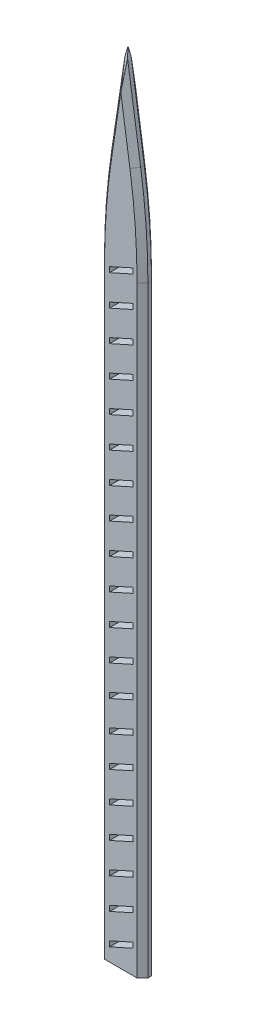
ISO-10303-21;
HEADER;
FILE_DESCRIPTION(('STEP AP214'),'2;1');
FILE_NAME('part.step','',(''),(''),'','','');
FILE_SCHEMA(('AUTOMOTIVE_DESIGN { 1 0 10303 214 1 1 1 1 }'));
ENDSEC;
DATA;
#1=APPLICATION_CONTEXT('core data for automotive mechanical design processes');
#2=APPLICATION_PROTOCOL_DEFINITION('international standard','automotive_design',2000,#1);
#3=PRODUCT_CONTEXT('',#1,'mechanical');
#4=PRODUCT('Part','Part','',(#3));
#5=PRODUCT_RELATED_PRODUCT_CATEGORY('part','',(#4));
#6=PRODUCT_DEFINITION_FORMATION('','',#4);
#7=PRODUCT_DEFINITION_CONTEXT('part definition',#1,'design');
#8=PRODUCT_DEFINITION('design','',#6,#7);
#9=PRODUCT_DEFINITION_SHAPE('','',#8);
#10=(LENGTH_UNIT() NAMED_UNIT(*) SI_UNIT(.MILLI.,.METRE.));
#11=(NAMED_UNIT(*) PLANE_ANGLE_UNIT() SI_UNIT($,.RADIAN.));
#12=(NAMED_UNIT(*) SI_UNIT($,.STERADIAN.) SOLID_ANGLE_UNIT());
#13=UNCERTAINTY_MEASURE_WITH_UNIT(LENGTH_MEASURE(1.E-05),#10,'distance_accuracy_value','');
#14=(GEOMETRIC_REPRESENTATION_CONTEXT(3) GLOBAL_UNCERTAINTY_ASSIGNED_CONTEXT((#13)) GLOBAL_UNIT_ASSIGNED_CONTEXT((#10,
#11,#12)) REPRESENTATION_CONTEXT('',''));
#15=CARTESIAN_POINT('',(0.,0.,0.));
#16=DIRECTION('',(0.,0.,1.));
#17=DIRECTION('',(1.,0.,0.));
#18=AXIS2_PLACEMENT_3D('',#15,#16,#17);
#19=CARTESIAN_POINT('',(-65.4944603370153,130.,-28.1332196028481));
#20=DIRECTION('',(1.,0.,0.));
#21=DIRECTION('',(0.,0.,-1.));
#22=AXIS2_PLACEMENT_3D('',#19,#20,#21);
#23=PLANE('',#22);
#24=DIRECTION('',(0.,0.,-1.));
#25=VECTOR('',#24,1.);
#26=CARTESIAN_POINT('',(-65.4944603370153,166.522646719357,37.8667803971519));
#27=LINE('',#26,#25);
#28=CARTESIAN_POINT('',(-65.4944603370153,166.522646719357,-29.6332196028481));
#29=VERTEX_POINT('',#28);
#30=CARTESIAN_POINT('',(-65.4944603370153,166.522646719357,-30.6332196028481));
#31=VERTEX_POINT('',#30);
#32=EDGE_CURVE('E1292',#29,#31,#27,.T.);
#33=ORIENTED_EDGE('',*,*,#32,.T.);
#34=DIRECTION('',(0.,-1.,0.));
#35=VECTOR('',#34,1.);
#36=CARTESIAN_POINT('',(-65.4944603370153,130.,-30.6332196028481));
#37=LINE('',#36,#35);
#38=CARTESIAN_POINT('',(-65.4944603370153,0.,-30.6332196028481));
#39=VERTEX_POINT('',#38);
#40=EDGE_CURVE('E1339',#31,#39,#37,.T.);
#41=ORIENTED_EDGE('',*,*,#40,.T.);
#42=DIRECTION('',(0.,0.,1.));
#43=VECTOR('',#42,1.);
#44=CARTESIAN_POINT('',(-65.4944603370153,0.,-28.1332196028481));
#45=LINE('',#44,#43);
#46=CARTESIAN_POINT('',(-65.4944603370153,0.,-29.6332196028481));
#47=VERTEX_POINT('',#46);
#48=EDGE_CURVE('E1288',#39,#47,#45,.T.);
#49=ORIENTED_EDGE('',*,*,#48,.T.);
#50=DIRECTION('',(0.,1.,0.));
#51=VECTOR('',#50,1.);
#52=CARTESIAN_POINT('',(-65.4944603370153,130.,-29.6332196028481));
#53=LINE('',#52,#51);
#54=EDGE_CURVE('E1337',#47,#29,#53,.T.);
#55=ORIENTED_EDGE('',*,*,#54,.T.);
#56=EDGE_LOOP('',(#33,#41,#49,#55));
#57=FACE_BOUND('',#56,.T.);
#58=ADVANCED_FACE('F33',(#57),#23,.F.);
#59=CARTESIAN_POINT('',(-53.4944603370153,130.,-28.1332196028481));
#60=DIRECTION('',(0.,0.,-1.));
#61=DIRECTION('',(-1.,0.,0.));
#62=AXIS2_PLACEMENT_3D('',#59,#60,#61);
#63=PLANE('',#62);
#64=DIRECTION('',(0.911921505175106,0.410364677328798,0.));
#65=VECTOR('',#64,1.);
#66=CARTESIAN_POINT('',(-14.6543506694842,43.6886451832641,-28.1332196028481));
#67=LINE('',#66,#65);
#68=CARTESIAN_POINT('',(-62.5961316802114,22.1148437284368,-28.1332196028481));
#69=VERTEX_POINT('',#68);
#70=CARTESIAN_POINT('',(-56.0936857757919,25.0409443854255,-28.1332196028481));
#71=VERTEX_POINT('',#70);
#72=EDGE_CURVE('E1198',#69,#71,#67,.T.);
#73=ORIENTED_EDGE('',*,*,#72,.T.);
#74=DIRECTION('',(0.,-1.,0.));
#75=VECTOR('',#74,1.);
#76=CARTESIAN_POINT('',(-56.0936857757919,130.,-28.1332196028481));
#77=LINE('',#76,#75);
#78=CARTESIAN_POINT('',(-56.0936857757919,23.5778940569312,-28.1332196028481));
#79=VERTEX_POINT('',#78);
#80=EDGE_CURVE('E1201',#71,#79,#77,.T.);
#81=ORIENTED_EDGE('',*,*,#80,.T.);
#82=DIRECTION('',(-0.911921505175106,-0.410364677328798,0.));
#83=VECTOR('',#82,1.);
#84=CARTESIAN_POINT('',(-14.1068474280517,42.4719713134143,-28.1332196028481));
#85=LINE('',#84,#83);
#86=CARTESIAN_POINT('',(-62.5961316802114,20.6517933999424,-28.1332196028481));
#87=VERTEX_POINT('',#86);
#88=EDGE_CURVE('E1195',#79,#87,#85,.T.);
#89=ORIENTED_EDGE('',*,*,#88,.T.);
#90=DIRECTION('',(0.,1.,0.));
#91=VECTOR('',#90,1.);
#92=CARTESIAN_POINT('',(-62.5961316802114,130.,-28.1332196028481));
#93=LINE('',#92,#91);
#94=EDGE_CURVE('E627',#87,#69,#93,.T.);
#95=ORIENTED_EDGE('',*,*,#94,.T.);
#96=EDGE_LOOP('',(#73,#81,#89,#95));
#97=FACE_BOUND('',#96,.T.);
#98=DIRECTION('',(0.911921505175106,0.410364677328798,0.));
#99=VECTOR('',#98,1.);
#100=CARTESIAN_POINT('',(-17.8352238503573,50.7572522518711,-28.1332196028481));
#101=LINE('',#100,#99);
#102=CARTESIAN_POINT('',(-62.5961316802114,30.6148437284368,-28.1332196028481));
#103=VERTEX_POINT('',#102);
#104=CARTESIAN_POINT('',(-56.0936857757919,33.5409443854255,-28.1332196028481));
#105=VERTEX_POINT('',#104);
#106=EDGE_CURVE('E1189',#103,#105,#101,.T.);
#107=ORIENTED_EDGE('',*,*,#106,.T.);
#108=DIRECTION('',(0.,-1.,0.));
#109=VECTOR('',#108,1.);
#110=CARTESIAN_POINT('',(-56.0936857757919,130.,-28.1332196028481));
#111=LINE('',#110,#109);
#112=CARTESIAN_POINT('',(-56.0936857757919,32.0778940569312,-28.1332196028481));
#113=VERTEX_POINT('',#112);
#114=EDGE_CURVE('E1192',#105,#113,#111,.T.);
#115=ORIENTED_EDGE('',*,*,#114,.T.);
#116=DIRECTION('',(-0.911921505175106,-0.410364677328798,0.));
#117=VECTOR('',#116,1.);
#118=CARTESIAN_POINT('',(-17.2877206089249,49.5405783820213,-28.1332196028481));
#119=LINE('',#118,#117);
#120=CARTESIAN_POINT('',(-62.5961316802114,29.1517933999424,-28.1332196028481));
#121=VERTEX_POINT('',#120);
#122=EDGE_CURVE('E1183',#113,#121,#119,.T.);
#123=ORIENTED_EDGE('',*,*,#122,.T.);
#124=DIRECTION('',(0.,1.,0.));
#125=VECTOR('',#124,1.);
#126=CARTESIAN_POINT('',(-62.5961316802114,130.,-28.1332196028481));
#127=LINE('',#126,#125);
#128=EDGE_CURVE('E1186',#121,#103,#127,.T.);
#129=ORIENTED_EDGE('',*,*,#128,.T.);
#130=EDGE_LOOP('',(#107,#115,#123,#129));
#131=FACE_BOUND('',#130,.T.);
#132=DIRECTION('',(0.911921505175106,0.410364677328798,0.));
#133=VECTOR('',#132,1.);
#134=CARTESIAN_POINT('',(-21.0160970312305,57.8258593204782,-28.1332196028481));
#135=LINE('',#134,#133);
#136=CARTESIAN_POINT('',(-62.5961316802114,39.1148437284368,-28.1332196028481));
#137=VERTEX_POINT('',#136);
#138=CARTESIAN_POINT('',(-56.0936857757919,42.0409443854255,-28.1332196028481));
#139=VERTEX_POINT('',#138);
#140=EDGE_CURVE('E1177',#137,#139,#135,.T.);
#141=ORIENTED_EDGE('',*,*,#140,.T.);
#142=DIRECTION('',(0.,-1.,0.));
#143=VECTOR('',#142,1.);
#144=CARTESIAN_POINT('',(-56.0936857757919,130.,-28.1332196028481));
#145=LINE('',#144,#143);
#146=CARTESIAN_POINT('',(-56.0936857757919,40.5778940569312,-28.1332196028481));
#147=VERTEX_POINT('',#146);
#148=EDGE_CURVE('E1180',#139,#147,#145,.T.);
#149=ORIENTED_EDGE('',*,*,#148,.T.);
#150=DIRECTION('',(-0.911921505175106,-0.410364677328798,0.));
#151=VECTOR('',#150,1.);
#152=CARTESIAN_POINT('',(-20.4685937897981,56.6091854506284,-28.1332196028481));
#153=LINE('',#152,#151);
#154=CARTESIAN_POINT('',(-62.5961316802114,37.6517933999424,-28.1332196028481));
#155=VERTEX_POINT('',#154);
#156=EDGE_CURVE('E1171',#147,#155,#153,.T.);
#157=ORIENTED_EDGE('',*,*,#156,.T.);
#158=DIRECTION('',(0.,1.,0.));
#159=VECTOR('',#158,1.);
#160=CARTESIAN_POINT('',(-62.5961316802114,130.,-28.1332196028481));
#161=LINE('',#160,#159);
#162=EDGE_CURVE('E1174',#155,#137,#161,.T.);
#163=ORIENTED_EDGE('',*,*,#162,.T.);
#164=EDGE_LOOP('',(#141,#149,#157,#163));
#165=FACE_BOUND('',#164,.T.);
#166=DIRECTION('',(0.911921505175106,0.410364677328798,0.));
#167=VECTOR('',#166,1.);
#168=CARTESIAN_POINT('',(-24.1969702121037,64.8944663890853,-28.1332196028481));
#169=LINE('',#168,#167);
#170=CARTESIAN_POINT('',(-62.5961316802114,47.6148437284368,-28.1332196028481));
#171=VERTEX_POINT('',#170);
#172=CARTESIAN_POINT('',(-56.0936857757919,50.5409443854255,-28.1332196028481));
#173=VERTEX_POINT('',#172);
#174=EDGE_CURVE('E1165',#171,#173,#169,.T.);
#175=ORIENTED_EDGE('',*,*,#174,.T.);
#176=DIRECTION('',(0.,-1.,0.));
#177=VECTOR('',#176,1.);
#178=CARTESIAN_POINT('',(-56.0936857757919,130.,-28.1332196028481));
#179=LINE('',#178,#177);
#180=CARTESIAN_POINT('',(-56.0936857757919,49.0778940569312,-28.1332196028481));
#181=VERTEX_POINT('',#180);
#182=EDGE_CURVE('E1168',#173,#181,#179,.T.);
#183=ORIENTED_EDGE('',*,*,#182,.T.);
#184=DIRECTION('',(-0.911921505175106,-0.410364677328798,0.));
#185=VECTOR('',#184,1.);
#186=CARTESIAN_POINT('',(-23.6494669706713,63.6777925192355,-28.1332196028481));
#187=LINE('',#186,#185);
#188=CARTESIAN_POINT('',(-62.5961316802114,46.1517933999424,-28.1332196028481));
#189=VERTEX_POINT('',#188);
#190=EDGE_CURVE('E1159',#181,#189,#187,.T.);
#191=ORIENTED_EDGE('',*,*,#190,.T.);
#192=DIRECTION('',(0.,1.,0.));
#193=VECTOR('',#192,1.);
#194=CARTESIAN_POINT('',(-62.5961316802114,130.,-28.1332196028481));
#195=LINE('',#194,#193);
#196=EDGE_CURVE('E1162',#189,#171,#195,.T.);
#197=ORIENTED_EDGE('',*,*,#196,.T.);
#198=EDGE_LOOP('',(#175,#183,#191,#197));
#199=FACE_BOUND('',#198,.T.);
#200=DIRECTION('',(0.911921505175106,0.410364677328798,0.));
#201=VECTOR('',#200,1.);
#202=CARTESIAN_POINT('',(-27.3778433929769,71.9630734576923,-28.1332196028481));
#203=LINE('',#202,#201);
#204=CARTESIAN_POINT('',(-62.5961316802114,56.1148437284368,-28.1332196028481));
#205=VERTEX_POINT('',#204);
#206=CARTESIAN_POINT('',(-56.0936857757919,59.0409443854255,-28.1332196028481));
#207=VERTEX_POINT('',#206);
#208=EDGE_CURVE('E1153',#205,#207,#203,.T.);
#209=ORIENTED_EDGE('',*,*,#208,.T.);
#210=DIRECTION('',(0.,-1.,0.));
#211=VECTOR('',#210,1.);
#212=CARTESIAN_POINT('',(-56.0936857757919,130.,-28.1332196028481));
#213=LINE('',#212,#211);
#214=CARTESIAN_POINT('',(-56.0936857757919,57.5778940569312,-28.1332196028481));
#215=VERTEX_POINT('',#214);
#216=EDGE_CURVE('E1156',#207,#215,#213,.T.);
#217=ORIENTED_EDGE('',*,*,#216,.T.);
#218=DIRECTION('',(-0.911921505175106,-0.410364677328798,0.));
#219=VECTOR('',#218,1.);
#220=CARTESIAN_POINT('',(-26.8303401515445,70.7463995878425,-28.1332196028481));
#221=LINE('',#220,#219);
#222=CARTESIAN_POINT('',(-62.5961316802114,54.6517933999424,-28.1332196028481));
#223=VERTEX_POINT('',#222);
#224=EDGE_CURVE('E1147',#215,#223,#221,.T.);
#225=ORIENTED_EDGE('',*,*,#224,.T.);
#226=DIRECTION('',(0.,1.,0.));
#227=VECTOR('',#226,1.);
#228=CARTESIAN_POINT('',(-62.5961316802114,130.,-28.1332196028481));
#229=LINE('',#228,#227);
#230=EDGE_CURVE('E1150',#223,#205,#229,.T.);
#231=ORIENTED_EDGE('',*,*,#230,.T.);
#232=EDGE_LOOP('',(#209,#217,#225,#231));
#233=FACE_BOUND('',#232,.T.);
#234=DIRECTION('',(0.911921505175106,0.410364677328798,0.));
#235=VECTOR('',#234,1.);
#236=CARTESIAN_POINT('',(-30.5587165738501,79.0316805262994,-28.1332196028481));
#237=LINE('',#236,#235);
#238=CARTESIAN_POINT('',(-62.5961316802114,64.6148437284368,-28.1332196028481));
#239=VERTEX_POINT('',#238);
#240=CARTESIAN_POINT('',(-56.0936857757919,67.5409443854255,-28.1332196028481));
#241=VERTEX_POINT('',#240);
#242=EDGE_CURVE('E1141',#239,#241,#237,.T.);
#243=ORIENTED_EDGE('',*,*,#242,.T.);
#244=DIRECTION('',(0.,-1.,0.));
#245=VECTOR('',#244,1.);
#246=CARTESIAN_POINT('',(-56.0936857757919,130.,-28.1332196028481));
#247=LINE('',#246,#245);
#248=CARTESIAN_POINT('',(-56.0936857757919,66.0778940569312,-28.1332196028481));
#249=VERTEX_POINT('',#248);
#250=EDGE_CURVE('E1144',#241,#249,#247,.T.);
#251=ORIENTED_EDGE('',*,*,#250,.T.);
#252=DIRECTION('',(-0.911921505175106,-0.410364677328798,0.));
#253=VECTOR('',#252,1.);
#254=CARTESIAN_POINT('',(-30.0112133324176,77.8150066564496,-28.1332196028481));
#255=LINE('',#254,#253);
#256=CARTESIAN_POINT('',(-62.5961316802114,63.1517933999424,-28.1332196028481));
#257=VERTEX_POINT('',#256);
#258=EDGE_CURVE('E1135',#249,#257,#255,.T.);
#259=ORIENTED_EDGE('',*,*,#258,.T.);
#260=DIRECTION('',(0.,1.,0.));
#261=VECTOR('',#260,1.);
#262=CARTESIAN_POINT('',(-62.5961316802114,130.,-28.1332196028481));
#263=LINE('',#262,#261);
#264=EDGE_CURVE('E1138',#257,#239,#263,.T.);
#265=ORIENTED_EDGE('',*,*,#264,.T.);
#266=EDGE_LOOP('',(#243,#251,#259,#265));
#267=FACE_BOUND('',#266,.T.);
#268=DIRECTION('',(0.911921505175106,0.410364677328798,0.));
#269=VECTOR('',#268,1.);
#270=CARTESIAN_POINT('',(-33.7395897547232,86.1002875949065,-28.1332196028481));
#271=LINE('',#270,#269);
#272=CARTESIAN_POINT('',(-62.5961316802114,73.1148437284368,-28.1332196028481));
#273=VERTEX_POINT('',#272);
#274=CARTESIAN_POINT('',(-56.0936857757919,76.0409443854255,-28.1332196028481));
#275=VERTEX_POINT('',#274);
#276=EDGE_CURVE('E1129',#273,#275,#271,.T.);
#277=ORIENTED_EDGE('',*,*,#276,.T.);
#278=DIRECTION('',(0.,-1.,0.));
#279=VECTOR('',#278,1.);
#280=CARTESIAN_POINT('',(-56.0936857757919,130.,-28.1332196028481));
#281=LINE('',#280,#279);
#282=CARTESIAN_POINT('',(-56.0936857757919,74.5778940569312,-28.1332196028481));
#283=VERTEX_POINT('',#282);
#284=EDGE_CURVE('E1132',#275,#283,#281,.T.);
#285=ORIENTED_EDGE('',*,*,#284,.T.);
#286=DIRECTION('',(-0.911921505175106,-0.410364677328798,0.));
#287=VECTOR('',#286,1.);
#288=CARTESIAN_POINT('',(-33.1920865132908,84.8836137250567,-28.1332196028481));
#289=LINE('',#288,#287);
#290=CARTESIAN_POINT('',(-62.5961316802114,71.6517933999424,-28.1332196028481));
#291=VERTEX_POINT('',#290);
#292=EDGE_CURVE('E1123',#283,#291,#289,.T.);
#293=ORIENTED_EDGE('',*,*,#292,.T.);
#294=DIRECTION('',(0.,1.,0.));
#295=VECTOR('',#294,1.);
#296=CARTESIAN_POINT('',(-62.5961316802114,130.,-28.1332196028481));
#297=LINE('',#296,#295);
#298=EDGE_CURVE('E1126',#291,#273,#297,.T.);
#299=ORIENTED_EDGE('',*,*,#298,.T.);
#300=EDGE_LOOP('',(#277,#285,#293,#299));
#301=FACE_BOUND('',#300,.T.);
#302=DIRECTION('',(0.911921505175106,0.410364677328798,0.));
#303=VECTOR('',#302,1.);
#304=CARTESIAN_POINT('',(-36.9204629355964,93.1688946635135,-28.1332196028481));
#305=LINE('',#304,#303);
#306=CARTESIAN_POINT('',(-62.5961316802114,81.6148437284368,-28.1332196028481));
#307=VERTEX_POINT('',#306);
#308=CARTESIAN_POINT('',(-56.0936857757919,84.5409443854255,-28.1332196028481));
#309=VERTEX_POINT('',#308);
#310=EDGE_CURVE('E1117',#307,#309,#305,.T.);
#311=ORIENTED_EDGE('',*,*,#310,.T.);
#312=DIRECTION('',(0.,-1.,0.));
#313=VECTOR('',#312,1.);
#314=CARTESIAN_POINT('',(-56.0936857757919,130.,-28.1332196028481));
#315=LINE('',#314,#313);
#316=CARTESIAN_POINT('',(-56.0936857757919,83.0778940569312,-28.1332196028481));
#317=VERTEX_POINT('',#316);
#318=EDGE_CURVE('E1120',#309,#317,#315,.T.);
#319=ORIENTED_EDGE('',*,*,#318,.T.);
#320=DIRECTION('',(-0.911921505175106,-0.410364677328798,0.));
#321=VECTOR('',#320,1.);
#322=CARTESIAN_POINT('',(-36.372959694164,91.9522207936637,-28.1332196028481));
#323=LINE('',#322,#321);
#324=CARTESIAN_POINT('',(-62.5961316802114,80.1517933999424,-28.1332196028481));
#325=VERTEX_POINT('',#324);
#326=EDGE_CURVE('E1111',#317,#325,#323,.T.);
#327=ORIENTED_EDGE('',*,*,#326,.T.);
#328=DIRECTION('',(0.,1.,0.));
#329=VECTOR('',#328,1.);
#330=CARTESIAN_POINT('',(-62.5961316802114,130.,-28.1332196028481));
#331=LINE('',#330,#329);
#332=EDGE_CURVE('E1114',#325,#307,#331,.T.);
#333=ORIENTED_EDGE('',*,*,#332,.T.);
#334=EDGE_LOOP('',(#311,#319,#327,#333));
#335=FACE_BOUND('',#334,.T.);
#336=DIRECTION('',(0.911921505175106,0.410364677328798,0.));
#337=VECTOR('',#336,1.);
#338=CARTESIAN_POINT('',(-40.1013361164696,100.237501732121,-28.1332196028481));
#339=LINE('',#338,#337);
#340=CARTESIAN_POINT('',(-62.5961316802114,90.1148437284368,-28.1332196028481));
#341=VERTEX_POINT('',#340);
#342=CARTESIAN_POINT('',(-56.0936857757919,93.0409443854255,-28.1332196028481));
#343=VERTEX_POINT('',#342);
#344=EDGE_CURVE('E1105',#341,#343,#339,.T.);
#345=ORIENTED_EDGE('',*,*,#344,.T.);
#346=DIRECTION('',(0.,-1.,0.));
#347=VECTOR('',#346,1.);
#348=CARTESIAN_POINT('',(-56.0936857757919,130.,-28.1332196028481));
#349=LINE('',#348,#347);
#350=CARTESIAN_POINT('',(-56.0936857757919,91.5778940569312,-28.1332196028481));
#351=VERTEX_POINT('',#350);
#352=EDGE_CURVE('E1108',#343,#351,#349,.T.);
#353=ORIENTED_EDGE('',*,*,#352,.T.);
#354=DIRECTION('',(-0.911921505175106,-0.410364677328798,0.));
#355=VECTOR('',#354,1.);
#356=CARTESIAN_POINT('',(-39.5538328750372,99.0208278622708,-28.1332196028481));
#357=LINE('',#356,#355);
#358=CARTESIAN_POINT('',(-62.5961316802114,88.6517933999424,-28.1332196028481));
#359=VERTEX_POINT('',#358);
#360=EDGE_CURVE('E1099',#351,#359,#357,.T.);
#361=ORIENTED_EDGE('',*,*,#360,.T.);
#362=DIRECTION('',(0.,1.,0.));
#363=VECTOR('',#362,1.);
#364=CARTESIAN_POINT('',(-62.5961316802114,130.,-28.1332196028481));
#365=LINE('',#364,#363);
#366=EDGE_CURVE('E1102',#359,#341,#365,.T.);
#367=ORIENTED_EDGE('',*,*,#366,.T.);
#368=EDGE_LOOP('',(#345,#353,#361,#367));
#369=FACE_BOUND('',#368,.T.);
#370=DIRECTION('',(0.911921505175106,0.410364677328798,0.));
#371=VECTOR('',#370,1.);
#372=CARTESIAN_POINT('',(-43.2822092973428,107.306108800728,-28.1332196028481));
#373=LINE('',#372,#371);
#374=CARTESIAN_POINT('',(-62.5961316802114,98.6148437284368,-28.1332196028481));
#375=VERTEX_POINT('',#374);
#376=CARTESIAN_POINT('',(-56.0936857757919,101.540944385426,-28.1332196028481));
#377=VERTEX_POINT('',#376);
#378=EDGE_CURVE('E1093',#375,#377,#373,.T.);
#379=ORIENTED_EDGE('',*,*,#378,.T.);
#380=DIRECTION('',(0.,-1.,0.));
#381=VECTOR('',#380,1.);
#382=CARTESIAN_POINT('',(-56.0936857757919,130.,-28.1332196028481));
#383=LINE('',#382,#381);
#384=CARTESIAN_POINT('',(-56.0936857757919,100.077894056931,-28.1332196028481));
#385=VERTEX_POINT('',#384);
#386=EDGE_CURVE('E1096',#377,#385,#383,.T.);
#387=ORIENTED_EDGE('',*,*,#386,.T.);
#388=DIRECTION('',(-0.911921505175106,-0.410364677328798,0.));
#389=VECTOR('',#388,1.);
#390=CARTESIAN_POINT('',(-42.7347060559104,106.089434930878,-28.1332196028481));
#391=LINE('',#390,#389);
#392=CARTESIAN_POINT('',(-62.5961316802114,97.1517933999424,-28.1332196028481));
#393=VERTEX_POINT('',#392);
#394=EDGE_CURVE('E1087',#385,#393,#391,.T.);
#395=ORIENTED_EDGE('',*,*,#394,.T.);
#396=DIRECTION('',(0.,1.,0.));
#397=VECTOR('',#396,1.);
#398=CARTESIAN_POINT('',(-62.5961316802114,130.,-28.1332196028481));
#399=LINE('',#398,#397);
#400=EDGE_CURVE('E1090',#393,#375,#399,.T.);
#401=ORIENTED_EDGE('',*,*,#400,.T.);
#402=EDGE_LOOP('',(#379,#387,#395,#401));
#403=FACE_BOUND('',#402,.T.);
#404=DIRECTION('',(0.911921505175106,0.410364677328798,0.));
#405=VECTOR('',#404,1.);
#406=CARTESIAN_POINT('',(-46.463082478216,114.374715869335,-28.1332196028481));
#407=LINE('',#406,#405);
#408=CARTESIAN_POINT('',(-62.5961316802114,107.114843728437,-28.1332196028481));
#409=VERTEX_POINT('',#408);
#410=CARTESIAN_POINT('',(-56.0936857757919,110.040944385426,-28.1332196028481));
#411=VERTEX_POINT('',#410);
#412=EDGE_CURVE('E1081',#409,#411,#407,.T.);
#413=ORIENTED_EDGE('',*,*,#412,.T.);
#414=DIRECTION('',(0.,-1.,0.));
#415=VECTOR('',#414,1.);
#416=CARTESIAN_POINT('',(-56.0936857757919,130.,-28.1332196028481));
#417=LINE('',#416,#415);
#418=CARTESIAN_POINT('',(-56.0936857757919,108.577894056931,-28.1332196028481));
#419=VERTEX_POINT('',#418);
#420=EDGE_CURVE('E1084',#411,#419,#417,.T.);
#421=ORIENTED_EDGE('',*,*,#420,.T.);
#422=DIRECTION('',(-0.911921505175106,-0.410364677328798,0.));
#423=VECTOR('',#422,1.);
#424=CARTESIAN_POINT('',(-45.9155792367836,113.158041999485,-28.1332196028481));
#425=LINE('',#424,#423);
#426=CARTESIAN_POINT('',(-62.5961316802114,105.651793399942,-28.1332196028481));
#427=VERTEX_POINT('',#426);
#428=EDGE_CURVE('E1075',#419,#427,#425,.T.);
#429=ORIENTED_EDGE('',*,*,#428,.T.);
#430=DIRECTION('',(0.,1.,0.));
#431=VECTOR('',#430,1.);
#432=CARTESIAN_POINT('',(-62.5961316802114,130.,-28.1332196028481));
#433=LINE('',#432,#431);
#434=EDGE_CURVE('E1078',#427,#409,#433,.T.);
#435=ORIENTED_EDGE('',*,*,#434,.T.);
#436=EDGE_LOOP('',(#413,#421,#429,#435));
#437=FACE_BOUND('',#436,.T.);
#438=DIRECTION('',(0.911921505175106,0.410364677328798,0.));
#439=VECTOR('',#438,1.);
#440=CARTESIAN_POINT('',(-49.6439556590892,121.443322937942,-28.1332196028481));
#441=LINE('',#440,#439);
#442=CARTESIAN_POINT('',(-62.5961316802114,115.614843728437,-28.1332196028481));
#443=VERTEX_POINT('',#442);
#444=CARTESIAN_POINT('',(-56.0936857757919,118.540944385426,-28.1332196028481));
#445=VERTEX_POINT('',#444);
#446=EDGE_CURVE('E1069',#443,#445,#441,.T.);
#447=ORIENTED_EDGE('',*,*,#446,.T.);
#448=DIRECTION('',(0.,-1.,0.));
#449=VECTOR('',#448,1.);
#450=CARTESIAN_POINT('',(-56.0936857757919,130.,-28.1332196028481));
#451=LINE('',#450,#449);
#452=CARTESIAN_POINT('',(-56.0936857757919,117.077894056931,-28.1332196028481));
#453=VERTEX_POINT('',#452);
#454=EDGE_CURVE('E1072',#445,#453,#451,.T.);
#455=ORIENTED_EDGE('',*,*,#454,.T.);
#456=DIRECTION('',(-0.911921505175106,-0.410364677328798,0.));
#457=VECTOR('',#456,1.);
#458=CARTESIAN_POINT('',(-49.0964524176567,120.226649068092,-28.1332196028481));
#459=LINE('',#458,#457);
#460=CARTESIAN_POINT('',(-62.5961316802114,114.151793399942,-28.1332196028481));
#461=VERTEX_POINT('',#460);
#462=EDGE_CURVE('E1063',#453,#461,#459,.T.);
#463=ORIENTED_EDGE('',*,*,#462,.T.);
#464=DIRECTION('',(0.,1.,0.));
#465=VECTOR('',#464,1.);
#466=CARTESIAN_POINT('',(-62.5961316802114,130.,-28.1332196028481));
#467=LINE('',#466,#465);
#468=EDGE_CURVE('E1066',#461,#443,#467,.T.);
#469=ORIENTED_EDGE('',*,*,#468,.T.);
#470=EDGE_LOOP('',(#447,#455,#463,#469));
#471=FACE_BOUND('',#470,.T.);
#472=DIRECTION('',(0.911921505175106,0.410364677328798,0.));
#473=VECTOR('',#472,1.);
#474=CARTESIAN_POINT('',(-52.8248288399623,128.511930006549,-28.1332196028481));
#475=LINE('',#474,#473);
#476=CARTESIAN_POINT('',(-62.5961316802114,124.114843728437,-28.1332196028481));
#477=VERTEX_POINT('',#476);
#478=CARTESIAN_POINT('',(-56.0936857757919,127.040944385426,-28.1332196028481));
#479=VERTEX_POINT('',#478);
#480=EDGE_CURVE('E1057',#477,#479,#475,.T.);
#481=ORIENTED_EDGE('',*,*,#480,.T.);
#482=DIRECTION('',(0.,-1.,0.));
#483=VECTOR('',#482,1.);
#484=CARTESIAN_POINT('',(-56.0936857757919,130.,-28.1332196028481));
#485=LINE('',#484,#483);
#486=CARTESIAN_POINT('',(-56.0936857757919,125.577894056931,-28.1332196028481));
#487=VERTEX_POINT('',#486);
#488=EDGE_CURVE('E1060',#479,#487,#485,.T.);
#489=ORIENTED_EDGE('',*,*,#488,.T.);
#490=DIRECTION('',(-0.911921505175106,-0.410364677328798,0.));
#491=VECTOR('',#490,1.);
#492=CARTESIAN_POINT('',(-52.2773255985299,127.295256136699,-28.1332196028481));
#493=LINE('',#492,#491);
#494=CARTESIAN_POINT('',(-62.5961316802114,122.651793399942,-28.1332196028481));
#495=VERTEX_POINT('',#494);
#496=EDGE_CURVE('E1051',#487,#495,#493,.T.);
#497=ORIENTED_EDGE('',*,*,#496,.T.);
#498=DIRECTION('',(0.,1.,0.));
#499=VECTOR('',#498,1.);
#500=CARTESIAN_POINT('',(-62.5961316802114,130.,-28.1332196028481));
#501=LINE('',#500,#499);
#502=EDGE_CURVE('E1054',#495,#477,#501,.T.);
#503=ORIENTED_EDGE('',*,*,#502,.T.);
#504=EDGE_LOOP('',(#481,#489,#497,#503));
#505=FACE_BOUND('',#504,.T.);
#506=DIRECTION('',(0.911921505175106,0.410364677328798,0.));
#507=VECTOR('',#506,1.);
#508=CARTESIAN_POINT('',(-56.0057020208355,135.580537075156,-28.1332196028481));
#509=LINE('',#508,#507);
#510=CARTESIAN_POINT('',(-62.5961316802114,132.614843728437,-28.1332196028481));
#511=VERTEX_POINT('',#510);
#512=CARTESIAN_POINT('',(-56.0936857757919,135.540944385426,-28.1332196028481));
#513=VERTEX_POINT('',#512);
#514=EDGE_CURVE('E1045',#511,#513,#509,.T.);
#515=ORIENTED_EDGE('',*,*,#514,.T.);
#516=DIRECTION('',(0.,-1.,0.));
#517=VECTOR('',#516,1.);
#518=CARTESIAN_POINT('',(-56.0936857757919,130.,-28.1332196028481));
#519=LINE('',#518,#517);
#520=CARTESIAN_POINT('',(-56.0936857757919,134.077894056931,-28.1332196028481));
#521=VERTEX_POINT('',#520);
#522=EDGE_CURVE('E1048',#513,#521,#519,.T.);
#523=ORIENTED_EDGE('',*,*,#522,.T.);
#524=DIRECTION('',(-0.911921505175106,-0.410364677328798,0.));
#525=VECTOR('',#524,1.);
#526=CARTESIAN_POINT('',(-55.4581987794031,134.363863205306,-28.1332196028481));
#527=LINE('',#526,#525);
#528=CARTESIAN_POINT('',(-62.5961316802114,131.151793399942,-28.1332196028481));
#529=VERTEX_POINT('',#528);
#530=EDGE_CURVE('E1039',#521,#529,#527,.T.);
#531=ORIENTED_EDGE('',*,*,#530,.T.);
#532=DIRECTION('',(0.,1.,0.));
#533=VECTOR('',#532,1.);
#534=CARTESIAN_POINT('',(-62.5961316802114,130.,-28.1332196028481));
#535=LINE('',#534,#533);
#536=EDGE_CURVE('E1042',#529,#511,#535,.T.);
#537=ORIENTED_EDGE('',*,*,#536,.T.);
#538=EDGE_LOOP('',(#515,#523,#531,#537));
#539=FACE_BOUND('',#538,.T.);
#540=DIRECTION('',(0.911921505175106,0.410364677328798,0.));
#541=VECTOR('',#540,1.);
#542=CARTESIAN_POINT('',(-59.1865752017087,142.649144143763,-28.1332196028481));
#543=LINE('',#542,#541);
#544=CARTESIAN_POINT('',(-62.5961316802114,141.114843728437,-28.1332196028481));
#545=VERTEX_POINT('',#544);
#546=CARTESIAN_POINT('',(-56.0936857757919,144.040944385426,-28.1332196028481));
#547=VERTEX_POINT('',#546);
#548=EDGE_CURVE('E1033',#545,#547,#543,.T.);
#549=ORIENTED_EDGE('',*,*,#548,.T.);
#550=DIRECTION('',(0.,-1.,0.));
#551=VECTOR('',#550,1.);
#552=CARTESIAN_POINT('',(-56.0936857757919,130.,-28.1332196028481));
#553=LINE('',#552,#551);
#554=CARTESIAN_POINT('',(-56.0936857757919,142.577894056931,-28.1332196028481));
#555=VERTEX_POINT('',#554);
#556=EDGE_CURVE('E1036',#547,#555,#553,.T.);
#557=ORIENTED_EDGE('',*,*,#556,.T.);
#558=DIRECTION('',(-0.911921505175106,-0.410364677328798,0.));
#559=VECTOR('',#558,1.);
#560=CARTESIAN_POINT('',(-58.6390719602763,141.432470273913,-28.1332196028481));
#561=LINE('',#560,#559);
#562=CARTESIAN_POINT('',(-62.5961316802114,139.651793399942,-28.1332196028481));
#563=VERTEX_POINT('',#562);
#564=EDGE_CURVE('E1027',#555,#563,#561,.T.);
#565=ORIENTED_EDGE('',*,*,#564,.T.);
#566=DIRECTION('',(0.,1.,0.));
#567=VECTOR('',#566,1.);
#568=CARTESIAN_POINT('',(-62.5961316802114,130.,-28.1332196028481));
#569=LINE('',#568,#567);
#570=EDGE_CURVE('E1030',#563,#545,#569,.T.);
#571=ORIENTED_EDGE('',*,*,#570,.T.);
#572=EDGE_LOOP('',(#549,#557,#565,#571));
#573=FACE_BOUND('',#572,.T.);
#574=DIRECTION('',(0.911921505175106,0.410364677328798,0.));
#575=VECTOR('',#574,1.);
#576=CARTESIAN_POINT('',(-62.3674483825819,149.71775121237,-28.1332196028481));
#577=LINE('',#576,#575);
#578=CARTESIAN_POINT('',(-62.5961316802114,149.614843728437,-28.1332196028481));
#579=VERTEX_POINT('',#578);
#580=CARTESIAN_POINT('',(-56.0936857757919,152.540944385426,-28.1332196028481));
#581=VERTEX_POINT('',#580);
#582=EDGE_CURVE('E1021',#579,#581,#577,.T.);
#583=ORIENTED_EDGE('',*,*,#582,.T.);
#584=DIRECTION('',(0.,-1.,0.));
#585=VECTOR('',#584,1.);
#586=CARTESIAN_POINT('',(-56.0936857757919,130.,-28.1332196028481));
#587=LINE('',#586,#585);
#588=CARTESIAN_POINT('',(-56.0936857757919,151.077894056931,-28.1332196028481));
#589=VERTEX_POINT('',#588);
#590=EDGE_CURVE('E1024',#581,#589,#587,.T.);
#591=ORIENTED_EDGE('',*,*,#590,.T.);
#592=DIRECTION('',(-0.911921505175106,-0.410364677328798,0.));
#593=VECTOR('',#592,1.);
#594=CARTESIAN_POINT('',(-61.8199451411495,148.50107734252,-28.1332196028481));
#595=LINE('',#594,#593);
#596=CARTESIAN_POINT('',(-62.5961316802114,148.151793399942,-28.1332196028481));
#597=VERTEX_POINT('',#596);
#598=EDGE_CURVE('E1015',#589,#597,#595,.T.);
#599=ORIENTED_EDGE('',*,*,#598,.T.);
#600=DIRECTION('',(0.,1.,0.));
#601=VECTOR('',#600,1.);
#602=CARTESIAN_POINT('',(-62.5961316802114,130.,-28.1332196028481));
#603=LINE('',#602,#601);
#604=EDGE_CURVE('E1018',#597,#579,#603,.T.);
#605=ORIENTED_EDGE('',*,*,#604,.T.);
#606=EDGE_LOOP('',(#583,#591,#599,#605));
#607=FACE_BOUND('',#606,.T.);
#608=DIRECTION('',(0.911921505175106,0.410364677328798,0.));
#609=VECTOR('',#608,1.);
#610=CARTESIAN_POINT('',(-65.548321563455,156.786358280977,-28.1332196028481));
#611=LINE('',#610,#609);
#612=CARTESIAN_POINT('',(-62.5961316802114,158.114843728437,-28.1332196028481));
#613=VERTEX_POINT('',#612);
#614=CARTESIAN_POINT('',(-56.0936857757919,161.040944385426,-28.1332196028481));
#615=VERTEX_POINT('',#614);
#616=EDGE_CURVE('E1009',#613,#615,#611,.T.);
#617=ORIENTED_EDGE('',*,*,#616,.T.);
#618=DIRECTION('',(0.,-1.,0.));
#619=VECTOR('',#618,1.);
#620=CARTESIAN_POINT('',(-56.0936857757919,130.,-28.1332196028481));
#621=LINE('',#620,#619);
#622=CARTESIAN_POINT('',(-56.0936857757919,159.577894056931,-28.1332196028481));
#623=VERTEX_POINT('',#622);
#624=EDGE_CURVE('E1012',#615,#623,#621,.T.);
#625=ORIENTED_EDGE('',*,*,#624,.T.);
#626=DIRECTION('',(-0.911921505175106,-0.410364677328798,0.));
#627=VECTOR('',#626,1.);
#628=CARTESIAN_POINT('',(-65.0008183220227,155.569684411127,-28.1332196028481));
#629=LINE('',#628,#627);
#630=CARTESIAN_POINT('',(-62.5961316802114,156.651793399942,-28.1332196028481));
#631=VERTEX_POINT('',#630);
#632=EDGE_CURVE('E1003',#623,#631,#629,.T.);
#633=ORIENTED_EDGE('',*,*,#632,.T.);
#634=DIRECTION('',(0.,1.,0.));
#635=VECTOR('',#634,1.);
#636=CARTESIAN_POINT('',(-62.5961316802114,130.,-28.1332196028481));
#637=LINE('',#636,#635);
#638=EDGE_CURVE('E1006',#631,#613,#637,.T.);
#639=ORIENTED_EDGE('',*,*,#638,.T.);
#640=EDGE_LOOP('',(#617,#625,#633,#639));
#641=FACE_BOUND('',#640,.T.);
#642=DIRECTION('',(0.911921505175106,0.410364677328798,0.));
#643=VECTOR('',#642,1.);
#644=CARTESIAN_POINT('',(-68.7291947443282,163.854965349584,-28.1332196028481));
#645=LINE('',#644,#643);
#646=CARTESIAN_POINT('',(-62.5961316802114,166.614843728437,-28.1332196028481));
#647=VERTEX_POINT('',#646);
#648=CARTESIAN_POINT('',(-56.0936857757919,169.540944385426,-28.1332196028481));
#649=VERTEX_POINT('',#648);
#650=EDGE_CURVE('E997',#647,#649,#645,.T.);
#651=ORIENTED_EDGE('',*,*,#650,.T.);
#652=DIRECTION('',(0.,-1.,0.));
#653=VECTOR('',#652,1.);
#654=CARTESIAN_POINT('',(-56.0936857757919,130.,-28.1332196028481));
#655=LINE('',#654,#653);
#656=CARTESIAN_POINT('',(-56.0936857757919,168.077894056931,-28.1332196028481));
#657=VERTEX_POINT('',#656);
#658=EDGE_CURVE('E1000',#649,#657,#655,.T.);
#659=ORIENTED_EDGE('',*,*,#658,.T.);
#660=DIRECTION('',(-0.911921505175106,-0.410364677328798,0.));
#661=VECTOR('',#660,1.);
#662=CARTESIAN_POINT('',(-68.1816915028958,162.638291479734,-28.1332196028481));
#663=LINE('',#662,#661);
#664=CARTESIAN_POINT('',(-62.5961316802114,165.151793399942,-28.1332196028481));
#665=VERTEX_POINT('',#664);
#666=EDGE_CURVE('E651',#657,#665,#663,.T.);
#667=ORIENTED_EDGE('',*,*,#666,.T.);
#668=DIRECTION('',(0.,1.,0.));
#669=VECTOR('',#668,1.);
#670=CARTESIAN_POINT('',(-62.5961316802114,130.,-28.1332196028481));
#671=LINE('',#670,#669);
#672=EDGE_CURVE('E994',#665,#647,#671,.T.);
#673=ORIENTED_EDGE('',*,*,#672,.T.);
#674=EDGE_LOOP('',(#651,#659,#667,#673));
#675=FACE_BOUND('',#674,.T.);
#676=DIRECTION('',(0.911921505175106,0.410364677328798,0.));
#677=VECTOR('',#676,1.);
#678=CARTESIAN_POINT('',(-11.473477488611,36.620038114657,-28.1332196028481));
#679=LINE('',#678,#677);
#680=CARTESIAN_POINT('',(-62.5961316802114,13.6148437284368,-28.1332196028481));
#681=VERTEX_POINT('',#680);
#682=CARTESIAN_POINT('',(-56.0936857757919,16.5409443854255,-28.1332196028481));
#683=VERTEX_POINT('',#682);
#684=EDGE_CURVE('E1230',#681,#683,#679,.T.);
#685=ORIENTED_EDGE('',*,*,#684,.T.);
#686=DIRECTION('',(0.,-1.,0.));
#687=VECTOR('',#686,1.);
#688=CARTESIAN_POINT('',(-56.0936857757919,130.,-28.1332196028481));
#689=LINE('',#688,#687);
#690=CARTESIAN_POINT('',(-56.0936857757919,15.0778940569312,-28.1332196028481));
#691=VERTEX_POINT('',#690);
#692=EDGE_CURVE('E1233',#683,#691,#689,.T.);
#693=ORIENTED_EDGE('',*,*,#692,.T.);
#694=DIRECTION('',(-0.911921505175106,-0.410364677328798,0.));
#695=VECTOR('',#694,1.);
#696=CARTESIAN_POINT('',(-10.9259742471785,35.4033642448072,-28.1332196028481));
#697=LINE('',#696,#695);
#698=CARTESIAN_POINT('',(-62.5961316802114,12.1517933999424,-28.1332196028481));
#699=VERTEX_POINT('',#698);
#700=EDGE_CURVE('E1218',#691,#699,#697,.T.);
#701=ORIENTED_EDGE('',*,*,#700,.T.);
#702=DIRECTION('',(0.,1.,0.));
#703=VECTOR('',#702,1.);
#704=CARTESIAN_POINT('',(-62.5961316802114,130.,-28.1332196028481));
#705=LINE('',#704,#703);
#706=EDGE_CURVE('E1227',#699,#681,#705,.T.);
#707=ORIENTED_EDGE('',*,*,#706,.T.);
#708=EDGE_LOOP('',(#685,#693,#701,#707));
#709=FACE_BOUND('',#708,.T.);
#710=DIRECTION('',(0.911921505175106,0.410364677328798,0.));
#711=VECTOR('',#710,1.);
#712=CARTESIAN_POINT('',(-8.2926043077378,29.5514310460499,-28.1332196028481));
#713=LINE('',#712,#711);
#714=CARTESIAN_POINT('',(-62.5961316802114,5.11484372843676,-28.1332196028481));
#715=VERTEX_POINT('',#714);
#716=CARTESIAN_POINT('',(-56.0936857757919,8.04094438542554,-28.1332196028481));
#717=VERTEX_POINT('',#716);
#718=EDGE_CURVE('E1262',#715,#717,#713,.T.);
#719=ORIENTED_EDGE('',*,*,#718,.T.);
#720=DIRECTION('',(0.,-1.,0.));
#721=VECTOR('',#720,1.);
#722=CARTESIAN_POINT('',(-56.0936857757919,130.,-28.1332196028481));
#723=LINE('',#722,#721);
#724=CARTESIAN_POINT('',(-56.0936857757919,6.57789405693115,-28.1332196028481));
#725=VERTEX_POINT('',#724);
#726=EDGE_CURVE('E1265',#717,#725,#723,.T.);
#727=ORIENTED_EDGE('',*,*,#726,.T.);
#728=DIRECTION('',(-0.911921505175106,-0.410364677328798,0.));
#729=VECTOR('',#728,1.);
#730=CARTESIAN_POINT('',(-7.74510106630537,28.3347571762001,-28.1332196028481));
#731=LINE('',#730,#729);
#732=CARTESIAN_POINT('',(-62.5961316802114,3.65179339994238,-28.1332196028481));
#733=VERTEX_POINT('',#732);
#734=EDGE_CURVE('E1250',#725,#733,#731,.T.);
#735=ORIENTED_EDGE('',*,*,#734,.T.);
#736=DIRECTION('',(0.,1.,0.));
#737=VECTOR('',#736,1.);
#738=CARTESIAN_POINT('',(-62.5961316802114,130.,-28.1332196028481));
#739=LINE('',#738,#737);
#740=EDGE_CURVE('E1259',#733,#715,#739,.T.);
#741=ORIENTED_EDGE('',*,*,#740,.T.);
#742=EDGE_LOOP('',(#719,#727,#735,#741));
#743=FACE_BOUND('',#742,.T.);
#744=DIRECTION('',(1.,0.,0.));
#745=VECTOR('',#744,1.);
#746=CARTESIAN_POINT('',(-53.4944603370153,0.,-28.1332196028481));
#747=LINE('',#746,#745);
#748=CARTESIAN_POINT('',(-63.9944603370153,0.,-28.1332196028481));
#749=VERTEX_POINT('',#748);
#750=CARTESIAN_POINT('',(-54.9944603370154,0.,-28.1332196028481));
#751=VERTEX_POINT('',#750);
#752=EDGE_CURVE('E1301',#749,#751,#747,.T.);
#753=ORIENTED_EDGE('',*,*,#752,.T.);
#754=DIRECTION('',(0.,1.,0.));
#755=VECTOR('',#754,1.);
#756=CARTESIAN_POINT('',(-54.9944603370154,130.,-28.1332196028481));
#757=LINE('',#756,#755);
#758=CARTESIAN_POINT('',(-54.9944603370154,166.522646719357,-28.1332196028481));
#759=VERTEX_POINT('',#758);
#760=EDGE_CURVE('E1370',#751,#759,#757,.T.);
#761=ORIENTED_EDGE('',*,*,#760,.T.);
#762=CARTESIAN_POINT('',(-233.494460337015,166.522646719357,-28.1332196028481));
#763=DIRECTION('',(0.,0.,-1.));
#764=DIRECTION('',(-1.,0.,0.));
#765=AXIS2_PLACEMENT_3D('',#762,#763,#764);
#766=CIRCLE('',#765,178.5);
#767=CARTESIAN_POINT('',(-56.9617268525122,192.950737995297,-28.1332196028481));
#768=VERTEX_POINT('',#767);
#769=EDGE_CURVE('E1366',#759,#768,#766,.F.);
#770=ORIENTED_EDGE('',*,*,#769,.T.);
#771=DIRECTION('',(-0.148056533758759,0.988978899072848,0.));
#772=VECTOR('',#771,1.);
#773=CARTESIAN_POINT('',(-47.6681733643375,130.872232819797,-28.1332196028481));
#774=LINE('',#773,#772);
#775=CARTESIAN_POINT('',(-59.4944603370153,209.868734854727,-28.1332196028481));
#776=VERTEX_POINT('',#775);
#777=EDGE_CURVE('E1363',#768,#776,#774,.T.);
#778=ORIENTED_EDGE('',*,*,#777,.T.);
#779=DIRECTION('',(-0.148056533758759,-0.988978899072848,0.));
#780=VECTOR('',#779,1.);
#781=CARTESIAN_POINT('',(-71.0576984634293,132.629330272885,-28.1332196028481));
#782=LINE('',#781,#780);
#783=CARTESIAN_POINT('',(-62.0271938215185,192.950737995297,-28.1332196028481));
#784=VERTEX_POINT('',#783);
#785=EDGE_CURVE('E1361',#776,#784,#782,.T.);
#786=ORIENTED_EDGE('',*,*,#785,.T.);
#787=CARTESIAN_POINT('',(114.505539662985,166.522646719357,-28.1332196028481));
#788=DIRECTION('',(0.,0.,-1.));
#789=DIRECTION('',(-1.,0.,0.));
#790=AXIS2_PLACEMENT_3D('',#787,#788,#789);
#791=CIRCLE('',#790,178.5);
#792=CARTESIAN_POINT('',(-63.9944603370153,166.522646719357,-28.1332196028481));
#793=VERTEX_POINT('',#792);
#794=EDGE_CURVE('E1359',#784,#793,#791,.F.);
#795=ORIENTED_EDGE('',*,*,#794,.T.);
#796=DIRECTION('',(0.,-1.,0.));
#797=VECTOR('',#796,1.);
#798=CARTESIAN_POINT('',(-63.9944603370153,130.,-28.1332196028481));
#799=LINE('',#798,#797);
#800=EDGE_CURVE('E1368',#793,#749,#799,.T.);
#801=ORIENTED_EDGE('',*,*,#800,.T.);
#802=EDGE_LOOP('',(#753,#761,#770,#778,#786,#795,#801));
#803=FACE_BOUND('',#802,.T.);
#804=ADVANCED_FACE('F1479',(#97,#131,#165,#199,#233,#267,#301,#335,#369,#403,#437,#471,#505,
#539,#573,#607,#641,#675,#709,#743,#803),#63,.F.);
#805=CARTESIAN_POINT('',(-65.4944603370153,130.,-32.1332196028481));
#806=DIRECTION('',(0.,0.,1.));
#807=DIRECTION('',(1.,0.,0.));
#808=AXIS2_PLACEMENT_3D('',#805,#806,#807);
#809=PLANE('',#808);
#810=DIRECTION('',(-0.911921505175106,-0.410364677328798,0.));
#811=VECTOR('',#810,1.);
#812=CARTESIAN_POINT('',(-56.0936857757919,23.5778940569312,-32.1332196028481));
#813=LINE('',#812,#811);
#814=CARTESIAN_POINT('',(-56.0936857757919,23.5778940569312,-32.1332196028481));
#815=VERTEX_POINT('',#814);
#816=CARTESIAN_POINT('',(-62.5961316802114,20.6517933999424,-32.1332196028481));
#817=VERTEX_POINT('',#816);
#818=EDGE_CURVE('E634',#815,#817,#813,.T.);
#819=ORIENTED_EDGE('',*,*,#818,.F.);
#820=DIRECTION('',(0.,-1.,0.));
#821=VECTOR('',#820,1.);
#822=CARTESIAN_POINT('',(-56.0936857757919,25.0409443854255,-32.1332196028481));
#823=LINE('',#822,#821);
#824=CARTESIAN_POINT('',(-56.0936857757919,25.0409443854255,-32.1332196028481));
#825=VERTEX_POINT('',#824);
#826=EDGE_CURVE('E639',#825,#815,#823,.T.);
#827=ORIENTED_EDGE('',*,*,#826,.F.);
#828=DIRECTION('',(0.911921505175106,0.410364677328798,0.));
#829=VECTOR('',#828,1.);
#830=CARTESIAN_POINT('',(-62.5961316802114,22.1148437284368,-32.1332196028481));
#831=LINE('',#830,#829);
#832=CARTESIAN_POINT('',(-62.5961316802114,22.1148437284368,-32.1332196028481));
#833=VERTEX_POINT('',#832);
#834=EDGE_CURVE('E644',#833,#825,#831,.T.);
#835=ORIENTED_EDGE('',*,*,#834,.F.);
#836=DIRECTION('',(0.,1.,0.));
#837=VECTOR('',#836,1.);
#838=CARTESIAN_POINT('',(-62.5961316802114,20.6517933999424,-32.1332196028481));
#839=LINE('',#838,#837);
#840=EDGE_CURVE('E624',#817,#833,#839,.T.);
#841=ORIENTED_EDGE('',*,*,#840,.F.);
#842=EDGE_LOOP('',(#819,#827,#835,#841));
#843=FACE_BOUND('',#842,.T.);
#844=DIRECTION('',(-0.911921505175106,-0.410364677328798,0.));
#845=VECTOR('',#844,1.);
#846=CARTESIAN_POINT('',(-56.0936857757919,32.0778940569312,-32.1332196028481));
#847=LINE('',#846,#845);
#848=CARTESIAN_POINT('',(-56.0936857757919,32.0778940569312,-32.1332196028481));
#849=VERTEX_POINT('',#848);
#850=CARTESIAN_POINT('',(-62.5961316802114,29.1517933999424,-32.1332196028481));
#851=VERTEX_POINT('',#850);
#852=EDGE_CURVE('E656',#849,#851,#847,.T.);
#853=ORIENTED_EDGE('',*,*,#852,.F.);
#854=DIRECTION('',(0.,-1.,0.));
#855=VECTOR('',#854,1.);
#856=CARTESIAN_POINT('',(-56.0936857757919,33.5409443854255,-32.1332196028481));
#857=LINE('',#856,#855);
#858=CARTESIAN_POINT('',(-56.0936857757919,33.5409443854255,-32.1332196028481));
#859=VERTEX_POINT('',#858);
#860=EDGE_CURVE('E654',#859,#849,#857,.T.);
#861=ORIENTED_EDGE('',*,*,#860,.F.);
#862=DIRECTION('',(0.911921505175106,0.410364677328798,0.));
#863=VECTOR('',#862,1.);
#864=CARTESIAN_POINT('',(-62.5961316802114,30.6148437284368,-32.1332196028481));
#865=LINE('',#864,#863);
#866=CARTESIAN_POINT('',(-62.5961316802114,30.6148437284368,-32.1332196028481));
#867=VERTEX_POINT('',#866);
#868=EDGE_CURVE('E662',#867,#859,#865,.T.);
#869=ORIENTED_EDGE('',*,*,#868,.F.);
#870=DIRECTION('',(0.,1.,0.));
#871=VECTOR('',#870,1.);
#872=CARTESIAN_POINT('',(-62.5961316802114,29.1517933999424,-32.1332196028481));
#873=LINE('',#872,#871);
#874=EDGE_CURVE('E659',#851,#867,#873,.T.);
#875=ORIENTED_EDGE('',*,*,#874,.F.);
#876=EDGE_LOOP('',(#853,#861,#869,#875));
#877=FACE_BOUND('',#876,.T.);
#878=DIRECTION('',(-0.911921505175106,-0.410364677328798,0.));
#879=VECTOR('',#878,1.);
#880=CARTESIAN_POINT('',(-56.0936857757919,40.5778940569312,-32.1332196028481));
#881=LINE('',#880,#879);
#882=CARTESIAN_POINT('',(-56.0936857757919,40.5778940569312,-32.1332196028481));
#883=VERTEX_POINT('',#882);
#884=CARTESIAN_POINT('',(-62.5961316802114,37.6517933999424,-32.1332196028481));
#885=VERTEX_POINT('',#884);
#886=EDGE_CURVE('E675',#883,#885,#881,.T.);
#887=ORIENTED_EDGE('',*,*,#886,.F.);
#888=DIRECTION('',(0.,-1.,0.));
#889=VECTOR('',#888,1.);
#890=CARTESIAN_POINT('',(-56.0936857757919,42.0409443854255,-32.1332196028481));
#891=LINE('',#890,#889);
#892=CARTESIAN_POINT('',(-56.0936857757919,42.0409443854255,-32.1332196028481));
#893=VERTEX_POINT('',#892);
#894=EDGE_CURVE('E673',#893,#883,#891,.T.);
#895=ORIENTED_EDGE('',*,*,#894,.F.);
#896=DIRECTION('',(0.911921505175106,0.410364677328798,0.));
#897=VECTOR('',#896,1.);
#898=CARTESIAN_POINT('',(-62.5961316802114,39.1148437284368,-32.1332196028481));
#899=LINE('',#898,#897);
#900=CARTESIAN_POINT('',(-62.5961316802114,39.1148437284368,-32.1332196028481));
#901=VERTEX_POINT('',#900);
#902=EDGE_CURVE('E682',#901,#893,#899,.T.);
#903=ORIENTED_EDGE('',*,*,#902,.F.);
#904=DIRECTION('',(0.,1.,0.));
#905=VECTOR('',#904,1.);
#906=CARTESIAN_POINT('',(-62.5961316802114,37.6517933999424,-32.1332196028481));
#907=LINE('',#906,#905);
#908=EDGE_CURVE('E679',#885,#901,#907,.T.);
#909=ORIENTED_EDGE('',*,*,#908,.F.);
#910=EDGE_LOOP('',(#887,#895,#903,#909));
#911=FACE_BOUND('',#910,.T.);
#912=DIRECTION('',(-0.911921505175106,-0.410364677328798,0.));
#913=VECTOR('',#912,1.);
#914=CARTESIAN_POINT('',(-56.0936857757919,49.0778940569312,-32.1332196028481));
#915=LINE('',#914,#913);
#916=CARTESIAN_POINT('',(-56.0936857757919,49.0778940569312,-32.1332196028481));
#917=VERTEX_POINT('',#916);
#918=CARTESIAN_POINT('',(-62.5961316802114,46.1517933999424,-32.1332196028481));
#919=VERTEX_POINT('',#918);
#920=EDGE_CURVE('E695',#917,#919,#915,.T.);
#921=ORIENTED_EDGE('',*,*,#920,.F.);
#922=DIRECTION('',(0.,-1.,0.));
#923=VECTOR('',#922,1.);
#924=CARTESIAN_POINT('',(-56.0936857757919,50.5409443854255,-32.1332196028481));
#925=LINE('',#924,#923);
#926=CARTESIAN_POINT('',(-56.0936857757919,50.5409443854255,-32.1332196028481));
#927=VERTEX_POINT('',#926);
#928=EDGE_CURVE('E693',#927,#917,#925,.T.);
#929=ORIENTED_EDGE('',*,*,#928,.F.);
#930=DIRECTION('',(0.911921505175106,0.410364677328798,0.));
#931=VECTOR('',#930,1.);
#932=CARTESIAN_POINT('',(-62.5961316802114,47.6148437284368,-32.1332196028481));
#933=LINE('',#932,#931);
#934=CARTESIAN_POINT('',(-62.5961316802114,47.6148437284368,-32.1332196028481));
#935=VERTEX_POINT('',#934);
#936=EDGE_CURVE('E702',#935,#927,#933,.T.);
#937=ORIENTED_EDGE('',*,*,#936,.F.);
#938=DIRECTION('',(0.,1.,0.));
#939=VECTOR('',#938,1.);
#940=CARTESIAN_POINT('',(-62.5961316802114,46.1517933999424,-32.1332196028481));
#941=LINE('',#940,#939);
#942=EDGE_CURVE('E699',#919,#935,#941,.T.);
#943=ORIENTED_EDGE('',*,*,#942,.F.);
#944=EDGE_LOOP('',(#921,#929,#937,#943));
#945=FACE_BOUND('',#944,.T.);
#946=DIRECTION('',(-0.911921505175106,-0.410364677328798,0.));
#947=VECTOR('',#946,1.);
#948=CARTESIAN_POINT('',(-56.0936857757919,57.5778940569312,-32.1332196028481));
#949=LINE('',#948,#947);
#950=CARTESIAN_POINT('',(-56.0936857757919,57.5778940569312,-32.1332196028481));
#951=VERTEX_POINT('',#950);
#952=CARTESIAN_POINT('',(-62.5961316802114,54.6517933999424,-32.1332196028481));
#953=VERTEX_POINT('',#952);
#954=EDGE_CURVE('E715',#951,#953,#949,.T.);
#955=ORIENTED_EDGE('',*,*,#954,.F.);
#956=DIRECTION('',(0.,-1.,0.));
#957=VECTOR('',#956,1.);
#958=CARTESIAN_POINT('',(-56.0936857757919,59.0409443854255,-32.1332196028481));
#959=LINE('',#958,#957);
#960=CARTESIAN_POINT('',(-56.0936857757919,59.0409443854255,-32.1332196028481));
#961=VERTEX_POINT('',#960);
#962=EDGE_CURVE('E713',#961,#951,#959,.T.);
#963=ORIENTED_EDGE('',*,*,#962,.F.);
#964=DIRECTION('',(0.911921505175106,0.410364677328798,0.));
#965=VECTOR('',#964,1.);
#966=CARTESIAN_POINT('',(-62.5961316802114,56.1148437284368,-32.1332196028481));
#967=LINE('',#966,#965);
#968=CARTESIAN_POINT('',(-62.5961316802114,56.1148437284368,-32.1332196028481));
#969=VERTEX_POINT('',#968);
#970=EDGE_CURVE('E722',#969,#961,#967,.T.);
#971=ORIENTED_EDGE('',*,*,#970,.F.);
#972=DIRECTION('',(0.,1.,0.));
#973=VECTOR('',#972,1.);
#974=CARTESIAN_POINT('',(-62.5961316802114,54.6517933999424,-32.1332196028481));
#975=LINE('',#974,#973);
#976=EDGE_CURVE('E719',#953,#969,#975,.T.);
#977=ORIENTED_EDGE('',*,*,#976,.F.);
#978=EDGE_LOOP('',(#955,#963,#971,#977));
#979=FACE_BOUND('',#978,.T.);
#980=DIRECTION('',(-0.911921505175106,-0.410364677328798,0.));
#981=VECTOR('',#980,1.);
#982=CARTESIAN_POINT('',(-56.0936857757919,66.0778940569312,-32.1332196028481));
#983=LINE('',#982,#981);
#984=CARTESIAN_POINT('',(-56.0936857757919,66.0778940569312,-32.1332196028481));
#985=VERTEX_POINT('',#984);
#986=CARTESIAN_POINT('',(-62.5961316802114,63.1517933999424,-32.1332196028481));
#987=VERTEX_POINT('',#986);
#988=EDGE_CURVE('E735',#985,#987,#983,.T.);
#989=ORIENTED_EDGE('',*,*,#988,.F.);
#990=DIRECTION('',(0.,-1.,0.));
#991=VECTOR('',#990,1.);
#992=CARTESIAN_POINT('',(-56.0936857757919,67.5409443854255,-32.1332196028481));
#993=LINE('',#992,#991);
#994=CARTESIAN_POINT('',(-56.0936857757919,67.5409443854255,-32.1332196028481));
#995=VERTEX_POINT('',#994);
#996=EDGE_CURVE('E733',#995,#985,#993,.T.);
#997=ORIENTED_EDGE('',*,*,#996,.F.);
#998=DIRECTION('',(0.911921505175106,0.410364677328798,0.));
#999=VECTOR('',#998,1.);
#1000=CARTESIAN_POINT('',(-62.5961316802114,64.6148437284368,-32.1332196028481));
#1001=LINE('',#1000,#999);
#1002=CARTESIAN_POINT('',(-62.5961316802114,64.6148437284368,-32.1332196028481));
#1003=VERTEX_POINT('',#1002);
#1004=EDGE_CURVE('E742',#1003,#995,#1001,.T.);
#1005=ORIENTED_EDGE('',*,*,#1004,.F.);
#1006=DIRECTION('',(0.,1.,0.));
#1007=VECTOR('',#1006,1.);
#1008=CARTESIAN_POINT('',(-62.5961316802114,63.1517933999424,-32.1332196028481));
#1009=LINE('',#1008,#1007);
#1010=EDGE_CURVE('E739',#987,#1003,#1009,.T.);
#1011=ORIENTED_EDGE('',*,*,#1010,.F.);
#1012=EDGE_LOOP('',(#989,#997,#1005,#1011));
#1013=FACE_BOUND('',#1012,.T.);
#1014=DIRECTION('',(-0.911921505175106,-0.410364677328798,0.));
#1015=VECTOR('',#1014,1.);
#1016=CARTESIAN_POINT('',(-56.0936857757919,74.5778940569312,-32.1332196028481));
#1017=LINE('',#1016,#1015);
#1018=CARTESIAN_POINT('',(-56.0936857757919,74.5778940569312,-32.1332196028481));
#1019=VERTEX_POINT('',#1018);
#1020=CARTESIAN_POINT('',(-62.5961316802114,71.6517933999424,-32.1332196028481));
#1021=VERTEX_POINT('',#1020);
#1022=EDGE_CURVE('E755',#1019,#1021,#1017,.T.);
#1023=ORIENTED_EDGE('',*,*,#1022,.F.);
#1024=DIRECTION('',(0.,-1.,0.));
#1025=VECTOR('',#1024,1.);
#1026=CARTESIAN_POINT('',(-56.0936857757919,76.0409443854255,-32.1332196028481));
#1027=LINE('',#1026,#1025);
#1028=CARTESIAN_POINT('',(-56.0936857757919,76.0409443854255,-32.1332196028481));
#1029=VERTEX_POINT('',#1028);
#1030=EDGE_CURVE('E753',#1029,#1019,#1027,.T.);
#1031=ORIENTED_EDGE('',*,*,#1030,.F.);
#1032=DIRECTION('',(0.911921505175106,0.410364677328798,0.));
#1033=VECTOR('',#1032,1.);
#1034=CARTESIAN_POINT('',(-62.5961316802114,73.1148437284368,-32.1332196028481));
#1035=LINE('',#1034,#1033);
#1036=CARTESIAN_POINT('',(-62.5961316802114,73.1148437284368,-32.1332196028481));
#1037=VERTEX_POINT('',#1036);
#1038=EDGE_CURVE('E762',#1037,#1029,#1035,.T.);
#1039=ORIENTED_EDGE('',*,*,#1038,.F.);
#1040=DIRECTION('',(0.,1.,0.));
#1041=VECTOR('',#1040,1.);
#1042=CARTESIAN_POINT('',(-62.5961316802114,71.6517933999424,-32.1332196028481));
#1043=LINE('',#1042,#1041);
#1044=EDGE_CURVE('E759',#1021,#1037,#1043,.T.);
#1045=ORIENTED_EDGE('',*,*,#1044,.F.);
#1046=EDGE_LOOP('',(#1023,#1031,#1039,#1045));
#1047=FACE_BOUND('',#1046,.T.);
#1048=DIRECTION('',(-0.911921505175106,-0.410364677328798,0.));
#1049=VECTOR('',#1048,1.);
#1050=CARTESIAN_POINT('',(-56.0936857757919,83.0778940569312,-32.1332196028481));
#1051=LINE('',#1050,#1049);
#1052=CARTESIAN_POINT('',(-56.0936857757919,83.0778940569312,-32.1332196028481));
#1053=VERTEX_POINT('',#1052);
#1054=CARTESIAN_POINT('',(-62.5961316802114,80.1517933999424,-32.1332196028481));
#1055=VERTEX_POINT('',#1054);
#1056=EDGE_CURVE('E775',#1053,#1055,#1051,.T.);
#1057=ORIENTED_EDGE('',*,*,#1056,.F.);
#1058=DIRECTION('',(0.,-1.,0.));
#1059=VECTOR('',#1058,1.);
#1060=CARTESIAN_POINT('',(-56.0936857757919,84.5409443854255,-32.1332196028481));
#1061=LINE('',#1060,#1059);
#1062=CARTESIAN_POINT('',(-56.0936857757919,84.5409443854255,-32.1332196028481));
#1063=VERTEX_POINT('',#1062);
#1064=EDGE_CURVE('E773',#1063,#1053,#1061,.T.);
#1065=ORIENTED_EDGE('',*,*,#1064,.F.);
#1066=DIRECTION('',(0.911921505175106,0.410364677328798,0.));
#1067=VECTOR('',#1066,1.);
#1068=CARTESIAN_POINT('',(-62.5961316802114,81.6148437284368,-32.1332196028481));
#1069=LINE('',#1068,#1067);
#1070=CARTESIAN_POINT('',(-62.5961316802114,81.6148437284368,-32.1332196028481));
#1071=VERTEX_POINT('',#1070);
#1072=EDGE_CURVE('E782',#1071,#1063,#1069,.T.);
#1073=ORIENTED_EDGE('',*,*,#1072,.F.);
#1074=DIRECTION('',(0.,1.,0.));
#1075=VECTOR('',#1074,1.);
#1076=CARTESIAN_POINT('',(-62.5961316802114,80.1517933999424,-32.1332196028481));
#1077=LINE('',#1076,#1075);
#1078=EDGE_CURVE('E779',#1055,#1071,#1077,.T.);
#1079=ORIENTED_EDGE('',*,*,#1078,.F.);
#1080=EDGE_LOOP('',(#1057,#1065,#1073,#1079));
#1081=FACE_BOUND('',#1080,.T.);
#1082=DIRECTION('',(-0.911921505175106,-0.410364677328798,0.));
#1083=VECTOR('',#1082,1.);
#1084=CARTESIAN_POINT('',(-56.0936857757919,91.5778940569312,-32.1332196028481));
#1085=LINE('',#1084,#1083);
#1086=CARTESIAN_POINT('',(-56.0936857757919,91.5778940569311,-32.1332196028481));
#1087=VERTEX_POINT('',#1086);
#1088=CARTESIAN_POINT('',(-62.5961316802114,88.6517933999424,-32.1332196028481));
#1089=VERTEX_POINT('',#1088);
#1090=EDGE_CURVE('E795',#1087,#1089,#1085,.T.);
#1091=ORIENTED_EDGE('',*,*,#1090,.F.);
#1092=DIRECTION('',(0.,-1.,0.));
#1093=VECTOR('',#1092,1.);
#1094=CARTESIAN_POINT('',(-56.0936857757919,93.0409443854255,-32.1332196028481));
#1095=LINE('',#1094,#1093);
#1096=CARTESIAN_POINT('',(-56.0936857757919,93.0409443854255,-32.1332196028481));
#1097=VERTEX_POINT('',#1096);
#1098=EDGE_CURVE('E793',#1097,#1087,#1095,.T.);
#1099=ORIENTED_EDGE('',*,*,#1098,.F.);
#1100=DIRECTION('',(0.911921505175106,0.410364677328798,0.));
#1101=VECTOR('',#1100,1.);
#1102=CARTESIAN_POINT('',(-62.5961316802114,90.1148437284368,-32.1332196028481));
#1103=LINE('',#1102,#1101);
#1104=CARTESIAN_POINT('',(-62.5961316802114,90.1148437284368,-32.1332196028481));
#1105=VERTEX_POINT('',#1104);
#1106=EDGE_CURVE('E802',#1105,#1097,#1103,.T.);
#1107=ORIENTED_EDGE('',*,*,#1106,.F.);
#1108=DIRECTION('',(0.,1.,0.));
#1109=VECTOR('',#1108,1.);
#1110=CARTESIAN_POINT('',(-62.5961316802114,88.6517933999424,-32.1332196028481));
#1111=LINE('',#1110,#1109);
#1112=EDGE_CURVE('E799',#1089,#1105,#1111,.T.);
#1113=ORIENTED_EDGE('',*,*,#1112,.F.);
#1114=EDGE_LOOP('',(#1091,#1099,#1107,#1113));
#1115=FACE_BOUND('',#1114,.T.);
#1116=DIRECTION('',(-0.911921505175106,-0.410364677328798,0.));
#1117=VECTOR('',#1116,1.);
#1118=CARTESIAN_POINT('',(-56.0936857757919,100.077894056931,-32.1332196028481));
#1119=LINE('',#1118,#1117);
#1120=CARTESIAN_POINT('',(-56.0936857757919,100.077894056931,-32.1332196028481));
#1121=VERTEX_POINT('',#1120);
#1122=CARTESIAN_POINT('',(-62.5961316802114,97.1517933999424,-32.1332196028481));
#1123=VERTEX_POINT('',#1122);
#1124=EDGE_CURVE('E815',#1121,#1123,#1119,.T.);
#1125=ORIENTED_EDGE('',*,*,#1124,.F.);
#1126=DIRECTION('',(0.,-1.,0.));
#1127=VECTOR('',#1126,1.);
#1128=CARTESIAN_POINT('',(-56.0936857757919,101.540944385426,-32.1332196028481));
#1129=LINE('',#1128,#1127);
#1130=CARTESIAN_POINT('',(-56.0936857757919,101.540944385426,-32.1332196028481));
#1131=VERTEX_POINT('',#1130);
#1132=EDGE_CURVE('E813',#1131,#1121,#1129,.T.);
#1133=ORIENTED_EDGE('',*,*,#1132,.F.);
#1134=DIRECTION('',(0.911921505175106,0.410364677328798,0.));
#1135=VECTOR('',#1134,1.);
#1136=CARTESIAN_POINT('',(-62.5961316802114,98.6148437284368,-32.1332196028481));
#1137=LINE('',#1136,#1135);
#1138=CARTESIAN_POINT('',(-62.5961316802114,98.6148437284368,-32.1332196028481));
#1139=VERTEX_POINT('',#1138);
#1140=EDGE_CURVE('E822',#1139,#1131,#1137,.T.);
#1141=ORIENTED_EDGE('',*,*,#1140,.F.);
#1142=DIRECTION('',(0.,1.,0.));
#1143=VECTOR('',#1142,1.);
#1144=CARTESIAN_POINT('',(-62.5961316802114,97.1517933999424,-32.1332196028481));
#1145=LINE('',#1144,#1143);
#1146=EDGE_CURVE('E819',#1123,#1139,#1145,.T.);
#1147=ORIENTED_EDGE('',*,*,#1146,.F.);
#1148=EDGE_LOOP('',(#1125,#1133,#1141,#1147));
#1149=FACE_BOUND('',#1148,.T.);
#1150=DIRECTION('',(-0.911921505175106,-0.410364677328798,0.));
#1151=VECTOR('',#1150,1.);
#1152=CARTESIAN_POINT('',(-56.0936857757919,108.577894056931,-32.1332196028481));
#1153=LINE('',#1152,#1151);
#1154=CARTESIAN_POINT('',(-56.0936857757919,108.577894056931,-32.1332196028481));
#1155=VERTEX_POINT('',#1154);
#1156=CARTESIAN_POINT('',(-62.5961316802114,105.651793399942,-32.1332196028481));
#1157=VERTEX_POINT('',#1156);
#1158=EDGE_CURVE('E835',#1155,#1157,#1153,.T.);
#1159=ORIENTED_EDGE('',*,*,#1158,.F.);
#1160=DIRECTION('',(0.,-1.,0.));
#1161=VECTOR('',#1160,1.);
#1162=CARTESIAN_POINT('',(-56.0936857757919,110.040944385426,-32.1332196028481));
#1163=LINE('',#1162,#1161);
#1164=CARTESIAN_POINT('',(-56.0936857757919,110.040944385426,-32.1332196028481));
#1165=VERTEX_POINT('',#1164);
#1166=EDGE_CURVE('E833',#1165,#1155,#1163,.T.);
#1167=ORIENTED_EDGE('',*,*,#1166,.F.);
#1168=DIRECTION('',(0.911921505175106,0.410364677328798,0.));
#1169=VECTOR('',#1168,1.);
#1170=CARTESIAN_POINT('',(-62.5961316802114,107.114843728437,-32.1332196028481));
#1171=LINE('',#1170,#1169);
#1172=CARTESIAN_POINT('',(-62.5961316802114,107.114843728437,-32.1332196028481));
#1173=VERTEX_POINT('',#1172);
#1174=EDGE_CURVE('E842',#1173,#1165,#1171,.T.);
#1175=ORIENTED_EDGE('',*,*,#1174,.F.);
#1176=DIRECTION('',(0.,1.,0.));
#1177=VECTOR('',#1176,1.);
#1178=CARTESIAN_POINT('',(-62.5961316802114,105.651793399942,-32.1332196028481));
#1179=LINE('',#1178,#1177);
#1180=EDGE_CURVE('E839',#1157,#1173,#1179,.T.);
#1181=ORIENTED_EDGE('',*,*,#1180,.F.);
#1182=EDGE_LOOP('',(#1159,#1167,#1175,#1181));
#1183=FACE_BOUND('',#1182,.T.);
#1184=DIRECTION('',(-0.911921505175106,-0.410364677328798,0.));
#1185=VECTOR('',#1184,1.);
#1186=CARTESIAN_POINT('',(-56.0936857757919,117.077894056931,-32.1332196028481));
#1187=LINE('',#1186,#1185);
#1188=CARTESIAN_POINT('',(-56.0936857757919,117.077894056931,-32.1332196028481));
#1189=VERTEX_POINT('',#1188);
#1190=CARTESIAN_POINT('',(-62.5961316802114,114.151793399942,-32.1332196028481));
#1191=VERTEX_POINT('',#1190);
#1192=EDGE_CURVE('E855',#1189,#1191,#1187,.T.);
#1193=ORIENTED_EDGE('',*,*,#1192,.F.);
#1194=DIRECTION('',(0.,-1.,0.));
#1195=VECTOR('',#1194,1.);
#1196=CARTESIAN_POINT('',(-56.0936857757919,118.540944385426,-32.1332196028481));
#1197=LINE('',#1196,#1195);
#1198=CARTESIAN_POINT('',(-56.0936857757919,118.540944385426,-32.1332196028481));
#1199=VERTEX_POINT('',#1198);
#1200=EDGE_CURVE('E853',#1199,#1189,#1197,.T.);
#1201=ORIENTED_EDGE('',*,*,#1200,.F.);
#1202=DIRECTION('',(0.911921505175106,0.410364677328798,0.));
#1203=VECTOR('',#1202,1.);
#1204=CARTESIAN_POINT('',(-62.5961316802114,115.614843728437,-32.1332196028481));
#1205=LINE('',#1204,#1203);
#1206=CARTESIAN_POINT('',(-62.5961316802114,115.614843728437,-32.1332196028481));
#1207=VERTEX_POINT('',#1206);
#1208=EDGE_CURVE('E862',#1207,#1199,#1205,.T.);
#1209=ORIENTED_EDGE('',*,*,#1208,.F.);
#1210=DIRECTION('',(0.,1.,0.));
#1211=VECTOR('',#1210,1.);
#1212=CARTESIAN_POINT('',(-62.5961316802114,114.151793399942,-32.1332196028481));
#1213=LINE('',#1212,#1211);
#1214=EDGE_CURVE('E859',#1191,#1207,#1213,.T.);
#1215=ORIENTED_EDGE('',*,*,#1214,.F.);
#1216=EDGE_LOOP('',(#1193,#1201,#1209,#1215));
#1217=FACE_BOUND('',#1216,.T.);
#1218=DIRECTION('',(-0.911921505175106,-0.410364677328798,0.));
#1219=VECTOR('',#1218,1.);
#1220=CARTESIAN_POINT('',(-56.0936857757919,125.577894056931,-32.1332196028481));
#1221=LINE('',#1220,#1219);
#1222=CARTESIAN_POINT('',(-56.0936857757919,125.577894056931,-32.1332196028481));
#1223=VERTEX_POINT('',#1222);
#1224=CARTESIAN_POINT('',(-62.5961316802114,122.651793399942,-32.1332196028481));
#1225=VERTEX_POINT('',#1224);
#1226=EDGE_CURVE('E875',#1223,#1225,#1221,.T.);
#1227=ORIENTED_EDGE('',*,*,#1226,.F.);
#1228=DIRECTION('',(0.,-1.,0.));
#1229=VECTOR('',#1228,1.);
#1230=CARTESIAN_POINT('',(-56.0936857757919,127.040944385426,-32.1332196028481));
#1231=LINE('',#1230,#1229);
#1232=CARTESIAN_POINT('',(-56.0936857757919,127.040944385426,-32.1332196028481));
#1233=VERTEX_POINT('',#1232);
#1234=EDGE_CURVE('E873',#1233,#1223,#1231,.T.);
#1235=ORIENTED_EDGE('',*,*,#1234,.F.);
#1236=DIRECTION('',(0.911921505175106,0.410364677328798,0.));
#1237=VECTOR('',#1236,1.);
#1238=CARTESIAN_POINT('',(-62.5961316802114,124.114843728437,-32.1332196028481));
#1239=LINE('',#1238,#1237);
#1240=CARTESIAN_POINT('',(-62.5961316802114,124.114843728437,-32.1332196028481));
#1241=VERTEX_POINT('',#1240);
#1242=EDGE_CURVE('E882',#1241,#1233,#1239,.T.);
#1243=ORIENTED_EDGE('',*,*,#1242,.F.);
#1244=DIRECTION('',(0.,1.,0.));
#1245=VECTOR('',#1244,1.);
#1246=CARTESIAN_POINT('',(-62.5961316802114,122.651793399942,-32.1332196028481));
#1247=LINE('',#1246,#1245);
#1248=EDGE_CURVE('E879',#1225,#1241,#1247,.T.);
#1249=ORIENTED_EDGE('',*,*,#1248,.F.);
#1250=EDGE_LOOP('',(#1227,#1235,#1243,#1249));
#1251=FACE_BOUND('',#1250,.T.);
#1252=DIRECTION('',(-0.911921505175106,-0.410364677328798,0.));
#1253=VECTOR('',#1252,1.);
#1254=CARTESIAN_POINT('',(-56.0936857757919,134.077894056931,-32.1332196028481));
#1255=LINE('',#1254,#1253);
#1256=CARTESIAN_POINT('',(-56.0936857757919,134.077894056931,-32.1332196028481));
#1257=VERTEX_POINT('',#1256);
#1258=CARTESIAN_POINT('',(-62.5961316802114,131.151793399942,-32.1332196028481));
#1259=VERTEX_POINT('',#1258);
#1260=EDGE_CURVE('E895',#1257,#1259,#1255,.T.);
#1261=ORIENTED_EDGE('',*,*,#1260,.F.);
#1262=DIRECTION('',(0.,-1.,0.));
#1263=VECTOR('',#1262,1.);
#1264=CARTESIAN_POINT('',(-56.0936857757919,135.540944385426,-32.1332196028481));
#1265=LINE('',#1264,#1263);
#1266=CARTESIAN_POINT('',(-56.0936857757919,135.540944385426,-32.1332196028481));
#1267=VERTEX_POINT('',#1266);
#1268=EDGE_CURVE('E893',#1267,#1257,#1265,.T.);
#1269=ORIENTED_EDGE('',*,*,#1268,.F.);
#1270=DIRECTION('',(0.911921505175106,0.410364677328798,0.));
#1271=VECTOR('',#1270,1.);
#1272=CARTESIAN_POINT('',(-62.5961316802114,132.614843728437,-32.1332196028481));
#1273=LINE('',#1272,#1271);
#1274=CARTESIAN_POINT('',(-62.5961316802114,132.614843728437,-32.1332196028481));
#1275=VERTEX_POINT('',#1274);
#1276=EDGE_CURVE('E902',#1275,#1267,#1273,.T.);
#1277=ORIENTED_EDGE('',*,*,#1276,.F.);
#1278=DIRECTION('',(0.,1.,0.));
#1279=VECTOR('',#1278,1.);
#1280=CARTESIAN_POINT('',(-62.5961316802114,131.151793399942,-32.1332196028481));
#1281=LINE('',#1280,#1279);
#1282=EDGE_CURVE('E899',#1259,#1275,#1281,.T.);
#1283=ORIENTED_EDGE('',*,*,#1282,.F.);
#1284=EDGE_LOOP('',(#1261,#1269,#1277,#1283));
#1285=FACE_BOUND('',#1284,.T.);
#1286=DIRECTION('',(-0.911921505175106,-0.410364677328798,0.));
#1287=VECTOR('',#1286,1.);
#1288=CARTESIAN_POINT('',(-56.0936857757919,142.577894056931,-32.1332196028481));
#1289=LINE('',#1288,#1287);
#1290=CARTESIAN_POINT('',(-56.0936857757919,142.577894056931,-32.1332196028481));
#1291=VERTEX_POINT('',#1290);
#1292=CARTESIAN_POINT('',(-62.5961316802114,139.651793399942,-32.1332196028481));
#1293=VERTEX_POINT('',#1292);
#1294=EDGE_CURVE('E915',#1291,#1293,#1289,.T.);
#1295=ORIENTED_EDGE('',*,*,#1294,.F.);
#1296=DIRECTION('',(0.,-1.,0.));
#1297=VECTOR('',#1296,1.);
#1298=CARTESIAN_POINT('',(-56.0936857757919,144.040944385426,-32.1332196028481));
#1299=LINE('',#1298,#1297);
#1300=CARTESIAN_POINT('',(-56.0936857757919,144.040944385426,-32.1332196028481));
#1301=VERTEX_POINT('',#1300);
#1302=EDGE_CURVE('E913',#1301,#1291,#1299,.T.);
#1303=ORIENTED_EDGE('',*,*,#1302,.F.);
#1304=DIRECTION('',(0.911921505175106,0.410364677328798,0.));
#1305=VECTOR('',#1304,1.);
#1306=CARTESIAN_POINT('',(-62.5961316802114,141.114843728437,-32.1332196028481));
#1307=LINE('',#1306,#1305);
#1308=CARTESIAN_POINT('',(-62.5961316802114,141.114843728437,-32.1332196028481));
#1309=VERTEX_POINT('',#1308);
#1310=EDGE_CURVE('E922',#1309,#1301,#1307,.T.);
#1311=ORIENTED_EDGE('',*,*,#1310,.F.);
#1312=DIRECTION('',(0.,1.,0.));
#1313=VECTOR('',#1312,1.);
#1314=CARTESIAN_POINT('',(-62.5961316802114,139.651793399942,-32.1332196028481));
#1315=LINE('',#1314,#1313);
#1316=EDGE_CURVE('E919',#1293,#1309,#1315,.T.);
#1317=ORIENTED_EDGE('',*,*,#1316,.F.);
#1318=EDGE_LOOP('',(#1295,#1303,#1311,#1317));
#1319=FACE_BOUND('',#1318,.T.);
#1320=DIRECTION('',(-0.911921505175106,-0.410364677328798,0.));
#1321=VECTOR('',#1320,1.);
#1322=CARTESIAN_POINT('',(-56.0936857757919,151.077894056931,-32.1332196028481));
#1323=LINE('',#1322,#1321);
#1324=CARTESIAN_POINT('',(-56.0936857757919,151.077894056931,-32.1332196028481));
#1325=VERTEX_POINT('',#1324);
#1326=CARTESIAN_POINT('',(-62.5961316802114,148.151793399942,-32.1332196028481));
#1327=VERTEX_POINT('',#1326);
#1328=EDGE_CURVE('E935',#1325,#1327,#1323,.T.);
#1329=ORIENTED_EDGE('',*,*,#1328,.F.);
#1330=DIRECTION('',(0.,-1.,0.));
#1331=VECTOR('',#1330,1.);
#1332=CARTESIAN_POINT('',(-56.0936857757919,152.540944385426,-32.1332196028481));
#1333=LINE('',#1332,#1331);
#1334=CARTESIAN_POINT('',(-56.0936857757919,152.540944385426,-32.1332196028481));
#1335=VERTEX_POINT('',#1334);
#1336=EDGE_CURVE('E933',#1335,#1325,#1333,.T.);
#1337=ORIENTED_EDGE('',*,*,#1336,.F.);
#1338=DIRECTION('',(0.911921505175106,0.410364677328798,0.));
#1339=VECTOR('',#1338,1.);
#1340=CARTESIAN_POINT('',(-62.5961316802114,149.614843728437,-32.1332196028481));
#1341=LINE('',#1340,#1339);
#1342=CARTESIAN_POINT('',(-62.5961316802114,149.614843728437,-32.1332196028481));
#1343=VERTEX_POINT('',#1342);
#1344=EDGE_CURVE('E942',#1343,#1335,#1341,.T.);
#1345=ORIENTED_EDGE('',*,*,#1344,.F.);
#1346=DIRECTION('',(0.,1.,0.));
#1347=VECTOR('',#1346,1.);
#1348=CARTESIAN_POINT('',(-62.5961316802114,148.151793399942,-32.1332196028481));
#1349=LINE('',#1348,#1347);
#1350=EDGE_CURVE('E939',#1327,#1343,#1349,.T.);
#1351=ORIENTED_EDGE('',*,*,#1350,.F.);
#1352=EDGE_LOOP('',(#1329,#1337,#1345,#1351));
#1353=FACE_BOUND('',#1352,.T.);
#1354=DIRECTION('',(-0.911921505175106,-0.410364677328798,0.));
#1355=VECTOR('',#1354,1.);
#1356=CARTESIAN_POINT('',(-56.0936857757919,159.577894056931,-32.1332196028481));
#1357=LINE('',#1356,#1355);
#1358=CARTESIAN_POINT('',(-56.0936857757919,159.577894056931,-32.1332196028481));
#1359=VERTEX_POINT('',#1358);
#1360=CARTESIAN_POINT('',(-62.5961316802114,156.651793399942,-32.1332196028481));
#1361=VERTEX_POINT('',#1360);
#1362=EDGE_CURVE('E955',#1359,#1361,#1357,.T.);
#1363=ORIENTED_EDGE('',*,*,#1362,.F.);
#1364=DIRECTION('',(0.,-1.,0.));
#1365=VECTOR('',#1364,1.);
#1366=CARTESIAN_POINT('',(-56.0936857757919,161.040944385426,-32.1332196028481));
#1367=LINE('',#1366,#1365);
#1368=CARTESIAN_POINT('',(-56.0936857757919,161.040944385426,-32.1332196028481));
#1369=VERTEX_POINT('',#1368);
#1370=EDGE_CURVE('E953',#1369,#1359,#1367,.T.);
#1371=ORIENTED_EDGE('',*,*,#1370,.F.);
#1372=DIRECTION('',(0.911921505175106,0.410364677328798,0.));
#1373=VECTOR('',#1372,1.);
#1374=CARTESIAN_POINT('',(-62.5961316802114,158.114843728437,-32.1332196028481));
#1375=LINE('',#1374,#1373);
#1376=CARTESIAN_POINT('',(-62.5961316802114,158.114843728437,-32.1332196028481));
#1377=VERTEX_POINT('',#1376);
#1378=EDGE_CURVE('E962',#1377,#1369,#1375,.T.);
#1379=ORIENTED_EDGE('',*,*,#1378,.F.);
#1380=DIRECTION('',(0.,1.,0.));
#1381=VECTOR('',#1380,1.);
#1382=CARTESIAN_POINT('',(-62.5961316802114,156.651793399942,-32.1332196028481));
#1383=LINE('',#1382,#1381);
#1384=EDGE_CURVE('E959',#1361,#1377,#1383,.T.);
#1385=ORIENTED_EDGE('',*,*,#1384,.F.);
#1386=EDGE_LOOP('',(#1363,#1371,#1379,#1385));
#1387=FACE_BOUND('',#1386,.T.);
#1388=DIRECTION('',(-0.911921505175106,-0.410364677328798,0.));
#1389=VECTOR('',#1388,1.);
#1390=CARTESIAN_POINT('',(-56.0936857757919,168.077894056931,-32.1332196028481));
#1391=LINE('',#1390,#1389);
#1392=CARTESIAN_POINT('',(-56.0936857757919,168.077894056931,-32.1332196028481));
#1393=VERTEX_POINT('',#1392);
#1394=CARTESIAN_POINT('',(-62.5961316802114,165.151793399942,-32.1332196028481));
#1395=VERTEX_POINT('',#1394);
#1396=EDGE_CURVE('E975',#1393,#1395,#1391,.T.);
#1397=ORIENTED_EDGE('',*,*,#1396,.F.);
#1398=DIRECTION('',(0.,-1.,0.));
#1399=VECTOR('',#1398,1.);
#1400=CARTESIAN_POINT('',(-56.0936857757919,169.540944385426,-32.1332196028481));
#1401=LINE('',#1400,#1399);
#1402=CARTESIAN_POINT('',(-56.0936857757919,169.540944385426,-32.1332196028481));
#1403=VERTEX_POINT('',#1402);
#1404=EDGE_CURVE('E973',#1403,#1393,#1401,.T.);
#1405=ORIENTED_EDGE('',*,*,#1404,.F.);
#1406=DIRECTION('',(0.911921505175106,0.410364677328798,0.));
#1407=VECTOR('',#1406,1.);
#1408=CARTESIAN_POINT('',(-62.5961316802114,166.614843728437,-32.1332196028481));
#1409=LINE('',#1408,#1407);
#1410=CARTESIAN_POINT('',(-62.5961316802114,166.614843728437,-32.1332196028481));
#1411=VERTEX_POINT('',#1410);
#1412=EDGE_CURVE('E981',#1411,#1403,#1409,.T.);
#1413=ORIENTED_EDGE('',*,*,#1412,.F.);
#1414=DIRECTION('',(0.,1.,0.));
#1415=VECTOR('',#1414,1.);
#1416=CARTESIAN_POINT('',(-62.5961316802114,165.151793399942,-32.1332196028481));
#1417=LINE('',#1416,#1415);
#1418=EDGE_CURVE('E978',#1395,#1411,#1417,.T.);
#1419=ORIENTED_EDGE('',*,*,#1418,.F.);
#1420=EDGE_LOOP('',(#1397,#1405,#1413,#1419));
#1421=FACE_BOUND('',#1420,.T.);
#1422=DIRECTION('',(-0.911921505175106,-0.410364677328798,0.));
#1423=VECTOR('',#1422,1.);
#1424=CARTESIAN_POINT('',(-56.0936857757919,15.0778940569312,-32.1332196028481));
#1425=LINE('',#1424,#1423);
#1426=CARTESIAN_POINT('',(-56.0936857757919,15.0778940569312,-32.1332196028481));
#1427=VERTEX_POINT('',#1426);
#1428=CARTESIAN_POINT('',(-62.5961316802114,12.1517933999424,-32.1332196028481));
#1429=VERTEX_POINT('',#1428);
#1430=EDGE_CURVE('E1206',#1427,#1429,#1425,.T.);
#1431=ORIENTED_EDGE('',*,*,#1430,.F.);
#1432=DIRECTION('',(0.,-1.,0.));
#1433=VECTOR('',#1432,1.);
#1434=CARTESIAN_POINT('',(-56.0936857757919,16.5409443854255,-32.1332196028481));
#1435=LINE('',#1434,#1433);
#1436=CARTESIAN_POINT('',(-56.0936857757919,16.5409443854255,-32.1332196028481));
#1437=VERTEX_POINT('',#1436);
#1438=EDGE_CURVE('E1204',#1437,#1427,#1435,.T.);
#1439=ORIENTED_EDGE('',*,*,#1438,.F.);
#1440=DIRECTION('',(0.911921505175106,0.410364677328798,0.));
#1441=VECTOR('',#1440,1.);
#1442=CARTESIAN_POINT('',(-62.5961316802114,13.6148437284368,-32.1332196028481));
#1443=LINE('',#1442,#1441);
#1444=CARTESIAN_POINT('',(-62.5961316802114,13.6148437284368,-32.1332196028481));
#1445=VERTEX_POINT('',#1444);
#1446=EDGE_CURVE('E1212',#1445,#1437,#1443,.T.);
#1447=ORIENTED_EDGE('',*,*,#1446,.F.);
#1448=DIRECTION('',(0.,1.,0.));
#1449=VECTOR('',#1448,1.);
#1450=CARTESIAN_POINT('',(-62.5961316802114,12.1517933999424,-32.1332196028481));
#1451=LINE('',#1450,#1449);
#1452=EDGE_CURVE('E1209',#1429,#1445,#1451,.T.);
#1453=ORIENTED_EDGE('',*,*,#1452,.F.);
#1454=EDGE_LOOP('',(#1431,#1439,#1447,#1453));
#1455=FACE_BOUND('',#1454,.T.);
#1456=DIRECTION('',(-0.911921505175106,-0.410364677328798,0.));
#1457=VECTOR('',#1456,1.);
#1458=CARTESIAN_POINT('',(-56.0936857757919,6.57789405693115,-32.1332196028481));
#1459=LINE('',#1458,#1457);
#1460=CARTESIAN_POINT('',(-56.0936857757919,6.57789405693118,-32.1332196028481));
#1461=VERTEX_POINT('',#1460);
#1462=CARTESIAN_POINT('',(-62.5961316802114,3.65179339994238,-32.1332196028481));
#1463=VERTEX_POINT('',#1462);
#1464=EDGE_CURVE('E1238',#1461,#1463,#1459,.T.);
#1465=ORIENTED_EDGE('',*,*,#1464,.F.);
#1466=DIRECTION('',(0.,-1.,0.));
#1467=VECTOR('',#1466,1.);
#1468=CARTESIAN_POINT('',(-56.0936857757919,8.04094438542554,-32.1332196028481));
#1469=LINE('',#1468,#1467);
#1470=CARTESIAN_POINT('',(-56.0936857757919,8.04094438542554,-32.1332196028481));
#1471=VERTEX_POINT('',#1470);
#1472=EDGE_CURVE('E1236',#1471,#1461,#1469,.T.);
#1473=ORIENTED_EDGE('',*,*,#1472,.F.);
#1474=DIRECTION('',(0.911921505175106,0.410364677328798,0.));
#1475=VECTOR('',#1474,1.);
#1476=CARTESIAN_POINT('',(-62.5961316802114,5.11484372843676,-32.1332196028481));
#1477=LINE('',#1476,#1475);
#1478=CARTESIAN_POINT('',(-62.5961316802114,5.11484372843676,-32.1332196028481));
#1479=VERTEX_POINT('',#1478);
#1480=EDGE_CURVE('E1244',#1479,#1471,#1477,.T.);
#1481=ORIENTED_EDGE('',*,*,#1480,.F.);
#1482=DIRECTION('',(0.,1.,0.));
#1483=VECTOR('',#1482,1.);
#1484=CARTESIAN_POINT('',(-62.5961316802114,3.65179339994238,-32.1332196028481));
#1485=LINE('',#1484,#1483);
#1486=EDGE_CURVE('E1241',#1463,#1479,#1485,.T.);
#1487=ORIENTED_EDGE('',*,*,#1486,.F.);
#1488=EDGE_LOOP('',(#1465,#1473,#1481,#1487));
#1489=FACE_BOUND('',#1488,.T.);
#1490=CARTESIAN_POINT('',(-233.494460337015,166.522646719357,-32.1332196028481));
#1491=DIRECTION('',(0.,0.,1.));
#1492=DIRECTION('',(1.,0.,0.));
#1493=AXIS2_PLACEMENT_3D('',#1490,#1491,#1492);
#1494=CIRCLE('',#1493,178.5);
#1495=CARTESIAN_POINT('',(-56.9617268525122,192.950737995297,-32.1332196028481));
#1496=VERTEX_POINT('',#1495);
#1497=CARTESIAN_POINT('',(-54.9944603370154,166.522646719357,-32.1332196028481));
#1498=VERTEX_POINT('',#1497);
#1499=EDGE_CURVE('E1317',#1496,#1498,#1494,.F.);
#1500=ORIENTED_EDGE('',*,*,#1499,.T.);
#1501=DIRECTION('',(0.,-1.,0.));
#1502=VECTOR('',#1501,1.);
#1503=CARTESIAN_POINT('',(-54.9944603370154,130.,-32.1332196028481));
#1504=LINE('',#1503,#1502);
#1505=CARTESIAN_POINT('',(-54.9944603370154,0.,-32.1332196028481));
#1506=VERTEX_POINT('',#1505);
#1507=EDGE_CURVE('E1321',#1498,#1506,#1504,.T.);
#1508=ORIENTED_EDGE('',*,*,#1507,.T.);
#1509=DIRECTION('',(-1.,0.,0.));
#1510=VECTOR('',#1509,1.);
#1511=CARTESIAN_POINT('',(-65.4944603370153,0.,-32.1332196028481));
#1512=LINE('',#1511,#1510);
#1513=CARTESIAN_POINT('',(-63.9944603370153,0.,-32.1332196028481));
#1514=VERTEX_POINT('',#1513);
#1515=EDGE_CURVE('E1307',#1506,#1514,#1512,.T.);
#1516=ORIENTED_EDGE('',*,*,#1515,.T.);
#1517=DIRECTION('',(0.,1.,0.));
#1518=VECTOR('',#1517,1.);
#1519=CARTESIAN_POINT('',(-63.9944603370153,130.,-32.1332196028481));
#1520=LINE('',#1519,#1518);
#1521=CARTESIAN_POINT('',(-63.9944603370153,166.522646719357,-32.1332196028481));
#1522=VERTEX_POINT('',#1521);
#1523=EDGE_CURVE('E1319',#1514,#1522,#1520,.T.);
#1524=ORIENTED_EDGE('',*,*,#1523,.T.);
#1525=CARTESIAN_POINT('',(114.505539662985,166.522646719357,-32.1332196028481));
#1526=DIRECTION('',(0.,0.,1.));
#1527=DIRECTION('',(1.,0.,0.));
#1528=AXIS2_PLACEMENT_3D('',#1525,#1526,#1527);
#1529=CIRCLE('',#1528,178.5);
#1530=CARTESIAN_POINT('',(-62.0271938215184,192.950737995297,-32.1332196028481));
#1531=VERTEX_POINT('',#1530);
#1532=EDGE_CURVE('E1310',#1522,#1531,#1529,.F.);
#1533=ORIENTED_EDGE('',*,*,#1532,.T.);
#1534=DIRECTION('',(0.148056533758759,0.988978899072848,0.));
#1535=VECTOR('',#1534,1.);
#1536=CARTESIAN_POINT('',(-71.3207473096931,130.872232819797,-32.1332196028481));
#1537=LINE('',#1536,#1535);
#1538=CARTESIAN_POINT('',(-59.4944603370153,209.868734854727,-32.1332196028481));
#1539=VERTEX_POINT('',#1538);
#1540=EDGE_CURVE('E1312',#1531,#1539,#1537,.T.);
#1541=ORIENTED_EDGE('',*,*,#1540,.T.);
#1542=DIRECTION('',(0.148056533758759,-0.988978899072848,0.));
#1543=VECTOR('',#1542,1.);
#1544=CARTESIAN_POINT('',(-47.9312222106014,132.629330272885,-32.1332196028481));
#1545=LINE('',#1544,#1543);
#1546=EDGE_CURVE('E1315',#1539,#1496,#1545,.T.);
#1547=ORIENTED_EDGE('',*,*,#1546,.T.);
#1548=EDGE_LOOP('',(#1500,#1508,#1516,#1524,#1533,#1541,#1547));
#1549=FACE_BOUND('',#1548,.T.);
#1550=ADVANCED_FACE('F641',(#843,#877,#911,#945,#979,#1013,#1047,#1081,#1115,#1149,#1183,#1217,
#1251,#1285,#1319,#1353,#1387,#1421,#1455,#1489,#1549),#809,.F.);
#1551=CARTESIAN_POINT('',(-53.4944603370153,130.,-32.1332196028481));
#1552=DIRECTION('',(-1.,0.,0.));
#1553=DIRECTION('',(0.,0.,1.));
#1554=AXIS2_PLACEMENT_3D('',#1551,#1552,#1553);
#1555=PLANE('',#1554);
#1556=DIRECTION('',(0.,0.,-1.));
#1557=VECTOR('',#1556,1.);
#1558=CARTESIAN_POINT('',(-53.4944603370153,0.,-32.1332196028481));
#1559=LINE('',#1558,#1557);
#1560=CARTESIAN_POINT('',(-53.4944603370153,0.,-29.6332196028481));
#1561=VERTEX_POINT('',#1560);
#1562=CARTESIAN_POINT('',(-53.4944603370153,0.,-30.6332196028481));
#1563=VERTEX_POINT('',#1562);
#1564=EDGE_CURVE('E1304',#1561,#1563,#1559,.T.);
#1565=ORIENTED_EDGE('',*,*,#1564,.T.);
#1566=DIRECTION('',(0.,1.,0.));
#1567=VECTOR('',#1566,1.);
#1568=CARTESIAN_POINT('',(-53.4944603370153,130.,-30.6332196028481));
#1569=LINE('',#1568,#1567);
#1570=CARTESIAN_POINT('',(-53.4944603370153,166.522646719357,-30.6332196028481));
#1571=VERTEX_POINT('',#1570);
#1572=EDGE_CURVE('E1335',#1563,#1571,#1569,.T.);
#1573=ORIENTED_EDGE('',*,*,#1572,.T.);
#1574=DIRECTION('',(0.,0.,-1.));
#1575=VECTOR('',#1574,1.);
#1576=CARTESIAN_POINT('',(-53.4944603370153,166.522646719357,37.8667803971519));
#1577=LINE('',#1576,#1575);
#1578=CARTESIAN_POINT('',(-53.4944603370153,166.522646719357,-29.6332196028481));
#1579=VERTEX_POINT('',#1578);
#1580=EDGE_CURVE('E1289',#1579,#1571,#1577,.T.);
#1581=ORIENTED_EDGE('',*,*,#1580,.F.);
#1582=DIRECTION('',(0.,-1.,0.));
#1583=VECTOR('',#1582,1.);
#1584=CARTESIAN_POINT('',(-53.4944603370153,130.,-29.6332196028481));
#1585=LINE('',#1584,#1583);
#1586=EDGE_CURVE('E1332',#1579,#1561,#1585,.T.);
#1587=ORIENTED_EDGE('',*,*,#1586,.T.);
#1588=EDGE_LOOP('',(#1565,#1573,#1581,#1587));
#1589=FACE_BOUND('',#1588,.T.);
#1590=ADVANCED_FACE('F1417',(#1589),#1555,.F.);
#1591=CARTESIAN_POINT('',(0.,0.,0.));
#1592=DIRECTION('',(0.,-1.,0.));
#1593=DIRECTION('',(0.,0.,-1.));
#1594=AXIS2_PLACEMENT_3D('',#1591,#1592,#1593);
#1595=PLANE('',#1594);
#1596=ORIENTED_EDGE('',*,*,#1515,.F.);
#1597=DIRECTION('',(-0.707106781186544,0.,-0.707106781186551));
#1598=VECTOR('',#1597,1.);
#1599=CARTESIAN_POINT('',(-11.4306203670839,0.,11.4306203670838));
#1600=LINE('',#1599,#1598);
#1601=EDGE_CURVE('E1330',#1506,#1563,#1600,.F.);
#1602=ORIENTED_EDGE('',*,*,#1601,.T.);
#1603=ORIENTED_EDGE('',*,*,#1564,.F.);
#1604=DIRECTION('',(0.707106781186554,0.,-0.707106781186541));
#1605=VECTOR('',#1604,1.);
#1606=CARTESIAN_POINT('',(-41.5638399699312,0.,-41.563839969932));
#1607=LINE('',#1606,#1605);
#1608=EDGE_CURVE('E1326',#1561,#751,#1607,.F.);
#1609=ORIENTED_EDGE('',*,*,#1608,.T.);
#1610=ORIENTED_EDGE('',*,*,#752,.F.);
#1611=DIRECTION('',(0.707106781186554,0.,0.707106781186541));
#1612=VECTOR('',#1611,1.);
#1613=CARTESIAN_POINT('',(-17.930620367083,0.,17.9306203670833));
#1614=LINE('',#1613,#1612);
#1615=EDGE_CURVE('E1324',#749,#47,#1614,.F.);
#1616=ORIENTED_EDGE('',*,*,#1615,.T.);
#1617=ORIENTED_EDGE('',*,*,#48,.F.);
#1618=DIRECTION('',(-0.707106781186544,0.,0.707106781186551));
#1619=VECTOR('',#1618,1.);
#1620=CARTESIAN_POINT('',(-48.063839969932,0.,-48.0638399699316));
#1621=LINE('',#1620,#1619);
#1622=EDGE_CURVE('E1328',#39,#1514,#1621,.F.);
#1623=ORIENTED_EDGE('',*,*,#1622,.T.);
#1624=EDGE_LOOP('',(#1596,#1602,#1603,#1609,#1610,#1616,#1617,#1623));
#1625=FACE_BOUND('',#1624,.T.);
#1626=ADVANCED_FACE('F1462',(#1625),#1595,.T.);
#1627=CARTESIAN_POINT('',(-233.494460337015,166.522646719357,37.8667803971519));
#1628=DIRECTION('',(0.,0.,-1.));
#1629=DIRECTION('',(-1.,0.,0.));
#1630=AXIS2_PLACEMENT_3D('',#1627,#1628,#1629);
#1631=CYLINDRICAL_SURFACE('',#1630,180.);
#1632=ORIENTED_EDGE('',*,*,#1580,.T.);
#1633=CARTESIAN_POINT('',(-233.494460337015,166.522646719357,-30.6332196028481));
#1634=DIRECTION('',(0.,0.,1.));
#1635=DIRECTION('',(1.,0.,0.));
#1636=AXIS2_PLACEMENT_3D('',#1633,#1634,#1635);
#1637=CIRCLE('',#1636,180.);
#1638=CARTESIAN_POINT('',(-55.4782585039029,193.172822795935,-30.6332196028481));
#1639=VERTEX_POINT('',#1638);
#1640=EDGE_CURVE('E1343',#1571,#1639,#1637,.T.);
#1641=ORIENTED_EDGE('',*,*,#1640,.T.);
#1642=DIRECTION('',(0.,0.,-1.));
#1643=VECTOR('',#1642,1.);
#1644=CARTESIAN_POINT('',(-55.4782585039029,193.172822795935,37.8667803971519));
#1645=LINE('',#1644,#1643);
#1646=CARTESIAN_POINT('',(-55.4782585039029,193.172822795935,-29.6332196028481));
#1647=VERTEX_POINT('',#1646);
#1648=EDGE_CURVE('E1285',#1647,#1639,#1645,.T.);
#1649=ORIENTED_EDGE('',*,*,#1648,.F.);
#1650=CARTESIAN_POINT('',(-233.494460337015,166.522646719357,-29.6332196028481));
#1651=DIRECTION('',(0.,0.,-1.));
#1652=DIRECTION('',(-1.,0.,0.));
#1653=AXIS2_PLACEMENT_3D('',#1650,#1651,#1652);
#1654=CIRCLE('',#1653,180.);
#1655=EDGE_CURVE('E1341',#1647,#1579,#1654,.T.);
#1656=ORIENTED_EDGE('',*,*,#1655,.T.);
#1657=EDGE_LOOP('',(#1632,#1641,#1649,#1656));
#1658=FACE_BOUND('',#1657,.T.);
#1659=ADVANCED_FACE('F1414',(#1658),#1631,.T.);
#1660=CARTESIAN_POINT('',(114.505539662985,166.522646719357,37.8667803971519));
#1661=DIRECTION('',(0.,0.,-1.));
#1662=DIRECTION('',(-1.,0.,0.));
#1663=AXIS2_PLACEMENT_3D('',#1660,#1661,#1662);
#1664=CYLINDRICAL_SURFACE('',#1663,180.);
#1665=DIRECTION('',(0.,0.,-1.));
#1666=VECTOR('',#1665,1.);
#1667=CARTESIAN_POINT('',(-63.5106621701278,193.172822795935,37.8667803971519));
#1668=LINE('',#1667,#1666);
#1669=CARTESIAN_POINT('',(-63.5106621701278,193.172822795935,-29.6332196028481));
#1670=VERTEX_POINT('',#1669);
#1671=CARTESIAN_POINT('',(-63.5106621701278,193.172822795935,-30.6332196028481));
#1672=VERTEX_POINT('',#1671);
#1673=EDGE_CURVE('E1295',#1670,#1672,#1668,.T.);
#1674=ORIENTED_EDGE('',*,*,#1673,.T.);
#1675=CARTESIAN_POINT('',(114.505539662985,166.522646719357,-30.6332196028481));
#1676=DIRECTION('',(0.,0.,1.));
#1677=DIRECTION('',(1.,0.,0.));
#1678=AXIS2_PLACEMENT_3D('',#1675,#1676,#1677);
#1679=CIRCLE('',#1678,180.);
#1680=EDGE_CURVE('E1357',#1672,#31,#1679,.T.);
#1681=ORIENTED_EDGE('',*,*,#1680,.T.);
#1682=ORIENTED_EDGE('',*,*,#32,.F.);
#1683=CARTESIAN_POINT('',(114.505539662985,166.522646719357,-29.6332196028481));
#1684=DIRECTION('',(0.,0.,-1.));
#1685=DIRECTION('',(-1.,0.,0.));
#1686=AXIS2_PLACEMENT_3D('',#1683,#1684,#1685);
#1687=CIRCLE('',#1686,180.);
#1688=EDGE_CURVE('E1355',#29,#1670,#1687,.T.);
#1689=ORIENTED_EDGE('',*,*,#1688,.T.);
#1690=EDGE_LOOP('',(#1674,#1681,#1682,#1689));
#1691=FACE_BOUND('',#1690,.T.);
#1692=ADVANCED_FACE('F1450',(#1691),#1664,.T.);
#1693=CARTESIAN_POINT('',(-59.4944603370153,220.,37.8667803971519));
#1694=DIRECTION('',(0.988978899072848,-0.148056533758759,0.));
#1695=DIRECTION('',(0.148056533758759,0.988978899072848,0.));
#1696=AXIS2_PLACEMENT_3D('',#1693,#1694,#1695);
#1697=PLANE('',#1696);
#1698=DIRECTION('',(0.145313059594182,0.970653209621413,-0.191615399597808));
#1699=VECTOR('',#1698,1.);
#1700=CARTESIAN_POINT('',(-61.3878672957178,207.35253702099,-27.6365002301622));
#1701=LINE('',#1700,#1699);
#1702=CARTESIAN_POINT('',(-59.8736393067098,217.467183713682,-29.6332196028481));
#1703=VERTEX_POINT('',#1702);
#1704=CARTESIAN_POINT('',(-59.4944603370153,220.,-30.1332196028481));
#1705=VERTEX_POINT('',#1704);
#1706=EDGE_CURVE('E1273',#1703,#1705,#1701,.T.);
#1707=ORIENTED_EDGE('',*,*,#1706,.T.);
#1708=DIRECTION('',(-0.145313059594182,-0.970653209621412,-0.191615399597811));
#1709=VECTOR('',#1708,1.);
#1710=CARTESIAN_POINT('',(-57.6010533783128,232.64746297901,-27.6365002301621));
#1711=LINE('',#1710,#1709);
#1712=CARTESIAN_POINT('',(-59.8736393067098,217.467183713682,-30.6332196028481));
#1713=VERTEX_POINT('',#1712);
#1714=EDGE_CURVE('E1281',#1705,#1713,#1711,.T.);
#1715=ORIENTED_EDGE('',*,*,#1714,.T.);
#1716=DIRECTION('',(-0.148056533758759,-0.988978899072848,0.));
#1717=VECTOR('',#1716,1.);
#1718=CARTESIAN_POINT('',(-59.4944603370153,220.,-30.6332196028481));
#1719=LINE('',#1718,#1717);
#1720=EDGE_CURVE('E1353',#1713,#1672,#1719,.T.);
#1721=ORIENTED_EDGE('',*,*,#1720,.T.);
#1722=ORIENTED_EDGE('',*,*,#1673,.F.);
#1723=DIRECTION('',(0.148056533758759,0.988978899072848,0.));
#1724=VECTOR('',#1723,1.);
#1725=CARTESIAN_POINT('',(-59.4944603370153,220.,-29.6332196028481));
#1726=LINE('',#1725,#1724);
#1727=EDGE_CURVE('E1350',#1670,#1703,#1726,.T.);
#1728=ORIENTED_EDGE('',*,*,#1727,.T.);
#1729=EDGE_LOOP('',(#1707,#1715,#1721,#1722,#1728));
#1730=FACE_BOUND('',#1729,.T.);
#1731=ADVANCED_FACE('F1474',(#1730),#1697,.F.);
#1732=CARTESIAN_POINT('',(-59.4944603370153,220.,37.8667803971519));
#1733=DIRECTION('',(-0.988978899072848,-0.148056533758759,0.));
#1734=DIRECTION('',(0.148056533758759,-0.988978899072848,0.));
#1735=AXIS2_PLACEMENT_3D('',#1732,#1733,#1734);
#1736=PLANE('',#1735);
#1737=DIRECTION('',(-0.148056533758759,0.988978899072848,0.));
#1738=VECTOR('',#1737,1.);
#1739=CARTESIAN_POINT('',(-59.4944603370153,220.,-30.6332196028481));
#1740=LINE('',#1739,#1738);
#1741=CARTESIAN_POINT('',(-59.1152813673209,217.467183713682,-30.6332196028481));
#1742=VERTEX_POINT('',#1741);
#1743=EDGE_CURVE('E1347',#1639,#1742,#1740,.T.);
#1744=ORIENTED_EDGE('',*,*,#1743,.T.);
#1745=DIRECTION('',(-0.145313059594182,0.970653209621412,0.191615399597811));
#1746=VECTOR('',#1745,1.);
#1747=CARTESIAN_POINT('',(-61.3878672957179,232.64746297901,-27.6365002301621));
#1748=LINE('',#1747,#1746);
#1749=EDGE_CURVE('E1278',#1742,#1705,#1748,.T.);
#1750=ORIENTED_EDGE('',*,*,#1749,.T.);
#1751=DIRECTION('',(0.145313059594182,-0.970653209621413,0.191615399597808));
#1752=VECTOR('',#1751,1.);
#1753=CARTESIAN_POINT('',(-57.6010533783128,207.35253702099,-27.6365002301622));
#1754=LINE('',#1753,#1752);
#1755=CARTESIAN_POINT('',(-59.1152813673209,217.467183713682,-29.6332196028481));
#1756=VERTEX_POINT('',#1755);
#1757=EDGE_CURVE('E1270',#1705,#1756,#1754,.T.);
#1758=ORIENTED_EDGE('',*,*,#1757,.T.);
#1759=DIRECTION('',(0.148056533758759,-0.988978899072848,0.));
#1760=VECTOR('',#1759,1.);
#1761=CARTESIAN_POINT('',(-59.4944603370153,220.,-29.6332196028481));
#1762=LINE('',#1761,#1760);
#1763=EDGE_CURVE('E1345',#1756,#1647,#1762,.T.);
#1764=ORIENTED_EDGE('',*,*,#1763,.T.);
#1765=ORIENTED_EDGE('',*,*,#1648,.T.);
#1766=EDGE_LOOP('',(#1744,#1750,#1758,#1764,#1765));
#1767=FACE_BOUND('',#1766,.T.);
#1768=ADVANCED_FACE('F1402',(#1767),#1736,.F.);
#1769=CARTESIAN_POINT('',(-65.4944603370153,130.,-30.6332196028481));
#1770=DIRECTION('',(0.707106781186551,0.,0.707106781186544));
#1771=DIRECTION('',(0.,-1.,0.));
#1772=AXIS2_PLACEMENT_3D('',#1769,#1770,#1771);
#1773=PLANE('',#1772);
#1774=ORIENTED_EDGE('',*,*,#1622,.F.);
#1775=ORIENTED_EDGE('',*,*,#40,.F.);
#1776=DIRECTION('',(-0.707106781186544,0.,0.707106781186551));
#1777=VECTOR('',#1776,1.);
#1778=CARTESIAN_POINT('',(-63.9944603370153,166.522646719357,-32.1332196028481));
#1779=LINE('',#1778,#1777);
#1780=EDGE_CURVE('E1298',#1522,#31,#1779,.T.);
#1781=ORIENTED_EDGE('',*,*,#1780,.F.);
#1782=ORIENTED_EDGE('',*,*,#1523,.F.);
#1783=EDGE_LOOP('',(#1774,#1775,#1781,#1782));
#1784=FACE_BOUND('',#1783,.T.);
#1785=ADVANCED_FACE('F1459',(#1784),#1773,.F.);
#1786=CARTESIAN_POINT('',(114.505539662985,166.522646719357,-30.6332196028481));
#1787=DIRECTION('',(0.,0.,1.));
#1788=DIRECTION('',(1.,0.,0.));
#1789=AXIS2_PLACEMENT_3D('',#1786,#1787,#1788);
#1790=CONICAL_SURFACE('',#1789,180.,0.785398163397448);
#1791=ORIENTED_EDGE('',*,*,#1780,.T.);
#1792=ORIENTED_EDGE('',*,*,#1680,.F.);
#1793=DIRECTION('',(-0.699313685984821,0.104691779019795,0.707106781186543));
#1794=VECTOR('',#1793,1.);
#1795=CARTESIAN_POINT('',(-62.0271938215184,192.950737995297,-32.1332196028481));
#1796=LINE('',#1795,#1794);
#1797=EDGE_CURVE('E1379',#1531,#1672,#1796,.T.);
#1798=ORIENTED_EDGE('',*,*,#1797,.F.);
#1799=ORIENTED_EDGE('',*,*,#1532,.F.);
#1800=EDGE_LOOP('',(#1791,#1792,#1798,#1799));
#1801=FACE_BOUND('',#1800,.T.);
#1802=ADVANCED_FACE('F1447',(#1801),#1790,.T.);
#1803=CARTESIAN_POINT('',(-59.4944603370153,220.,-30.6332196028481));
#1804=DIRECTION('',(0.69931368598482,-0.104691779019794,0.707106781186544));
#1805=DIRECTION('',(-0.148056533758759,-0.988978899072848,0.));
#1806=AXIS2_PLACEMENT_3D('',#1803,#1804,#1805);
#1807=PLANE('',#1806);
#1808=DIRECTION('',(0.0488987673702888,-0.979892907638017,-0.193439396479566));
#1809=VECTOR('',#1808,1.);
#1810=CARTESIAN_POINT('',(-59.9940939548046,219.881000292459,-30.156711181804));
#1811=LINE('',#1810,#1809);
#1812=EDGE_CURVE('E1276',#1539,#1713,#1811,.F.);
#1813=ORIENTED_EDGE('',*,*,#1812,.F.);
#1814=ORIENTED_EDGE('',*,*,#1540,.F.);
#1815=ORIENTED_EDGE('',*,*,#1797,.T.);
#1816=ORIENTED_EDGE('',*,*,#1720,.F.);
#1817=EDGE_LOOP('',(#1813,#1814,#1815,#1816));
#1818=FACE_BOUND('',#1817,.T.);
#1819=ADVANCED_FACE('F1439',(#1818),#1807,.F.);
#1820=CARTESIAN_POINT('',(-59.4944603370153,220.,-30.6332196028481));
#1821=DIRECTION('',(-0.699313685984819,-0.104691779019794,0.707106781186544));
#1822=DIRECTION('',(-0.148056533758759,0.988978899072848,0.));
#1823=AXIS2_PLACEMENT_3D('',#1820,#1821,#1822);
#1824=PLANE('',#1823);
#1825=DIRECTION('',(0.0488987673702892,0.979892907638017,0.193439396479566));
#1826=VECTOR('',#1825,1.);
#1827=CARTESIAN_POINT('',(-58.9948267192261,219.881000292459,-30.156711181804));
#1828=LINE('',#1827,#1826);
#1829=EDGE_CURVE('E11',#1742,#1539,#1828,.F.);
#1830=ORIENTED_EDGE('',*,*,#1829,.F.);
#1831=ORIENTED_EDGE('',*,*,#1743,.F.);
#1832=DIRECTION('',(0.699313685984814,0.104691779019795,0.70710678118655));
#1833=VECTOR('',#1832,1.);
#1834=CARTESIAN_POINT('',(-56.9617268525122,192.950737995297,-32.1332196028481));
#1835=LINE('',#1834,#1833);
#1836=EDGE_CURVE('E1375',#1496,#1639,#1835,.T.);
#1837=ORIENTED_EDGE('',*,*,#1836,.F.);
#1838=ORIENTED_EDGE('',*,*,#1546,.F.);
#1839=EDGE_LOOP('',(#1830,#1831,#1837,#1838));
#1840=FACE_BOUND('',#1839,.T.);
#1841=ADVANCED_FACE('F1431',(#1840),#1824,.F.);
#1842=CARTESIAN_POINT('',(-233.494460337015,166.522646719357,-30.6332196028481));
#1843=DIRECTION('',(0.,0.,1.));
#1844=DIRECTION('',(1.,0.,0.));
#1845=AXIS2_PLACEMENT_3D('',#1842,#1843,#1844);
#1846=CONICAL_SURFACE('',#1845,180.,0.785398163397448);
#1847=ORIENTED_EDGE('',*,*,#1836,.T.);
#1848=ORIENTED_EDGE('',*,*,#1640,.F.);
#1849=DIRECTION('',(0.707106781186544,0.,0.707106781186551));
#1850=VECTOR('',#1849,1.);
#1851=CARTESIAN_POINT('',(-54.9944603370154,166.522646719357,-32.1332196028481));
#1852=LINE('',#1851,#1850);
#1853=EDGE_CURVE('E1372',#1498,#1571,#1852,.T.);
#1854=ORIENTED_EDGE('',*,*,#1853,.F.);
#1855=ORIENTED_EDGE('',*,*,#1499,.F.);
#1856=EDGE_LOOP('',(#1847,#1848,#1854,#1855));
#1857=FACE_BOUND('',#1856,.T.);
#1858=ADVANCED_FACE('F1426',(#1857),#1846,.T.);
#1859=CARTESIAN_POINT('',(-54.9944603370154,130.,-32.1332196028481));
#1860=DIRECTION('',(-0.707106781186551,0.,0.707106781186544));
#1861=DIRECTION('',(0.,-1.,0.));
#1862=AXIS2_PLACEMENT_3D('',#1859,#1860,#1861);
#1863=PLANE('',#1862);
#1864=ORIENTED_EDGE('',*,*,#1853,.T.);
#1865=ORIENTED_EDGE('',*,*,#1572,.F.);
#1866=ORIENTED_EDGE('',*,*,#1601,.F.);
#1867=ORIENTED_EDGE('',*,*,#1507,.F.);
#1868=EDGE_LOOP('',(#1864,#1865,#1866,#1867));
#1869=FACE_BOUND('',#1868,.T.);
#1870=ADVANCED_FACE('F1421',(#1869),#1863,.F.);
#1871=CARTESIAN_POINT('',(-63.9944603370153,130.,-28.1332196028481));
#1872=DIRECTION('',(0.707106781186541,0.,-0.707106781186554));
#1873=DIRECTION('',(0.,-1.,0.));
#1874=AXIS2_PLACEMENT_3D('',#1871,#1872,#1873);
#1875=PLANE('',#1874);
#1876=ORIENTED_EDGE('',*,*,#1615,.F.);
#1877=ORIENTED_EDGE('',*,*,#800,.F.);
#1878=DIRECTION('',(0.707106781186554,0.,0.707106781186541));
#1879=VECTOR('',#1878,1.);
#1880=CARTESIAN_POINT('',(-65.4944603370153,166.522646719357,-29.6332196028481));
#1881=LINE('',#1880,#1879);
#1882=EDGE_CURVE('E1376',#29,#793,#1881,.T.);
#1883=ORIENTED_EDGE('',*,*,#1882,.F.);
#1884=ORIENTED_EDGE('',*,*,#54,.F.);
#1885=EDGE_LOOP('',(#1876,#1877,#1883,#1884));
#1886=FACE_BOUND('',#1885,.T.);
#1887=ADVANCED_FACE('F35',(#1886),#1875,.F.);
#1888=CARTESIAN_POINT('',(114.505539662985,166.522646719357,-28.1332196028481));
#1889=DIRECTION('',(0.,0.,-1.));
#1890=DIRECTION('',(-1.,0.,0.));
#1891=AXIS2_PLACEMENT_3D('',#1888,#1889,#1890);
#1892=CONICAL_SURFACE('',#1891,178.5,0.785398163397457);
#1893=ORIENTED_EDGE('',*,*,#1882,.T.);
#1894=ORIENTED_EDGE('',*,*,#794,.F.);
#1895=DIRECTION('',(0.699313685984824,-0.104691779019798,0.70710678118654));
#1896=VECTOR('',#1895,1.);
#1897=CARTESIAN_POINT('',(-63.5106621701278,193.172822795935,-29.6332196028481));
#1898=LINE('',#1897,#1896);
#1899=EDGE_CURVE('E1389',#1670,#784,#1898,.T.);
#1900=ORIENTED_EDGE('',*,*,#1899,.F.);
#1901=ORIENTED_EDGE('',*,*,#1688,.F.);
#1902=EDGE_LOOP('',(#1893,#1894,#1900,#1901));
#1903=FACE_BOUND('',#1902,.T.);
#1904=ADVANCED_FACE('F1471',(#1903),#1892,.T.);
#1905=CARTESIAN_POINT('',(-71.0576984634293,132.629330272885,-28.1332196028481));
#1906=DIRECTION('',(0.699313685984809,-0.104691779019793,-0.707106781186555));
#1907=DIRECTION('',(-0.148056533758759,-0.988978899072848,0.));
#1908=AXIS2_PLACEMENT_3D('',#1905,#1906,#1907);
#1909=PLANE('',#1908);
#1910=DIRECTION('',(-0.0488987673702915,0.979892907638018,-0.193439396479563));
#1911=VECTOR('',#1910,1.);
#1912=CARTESIAN_POINT('',(-55.8211401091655,136.25828141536,-13.6018748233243));
#1913=LINE('',#1912,#1911);
#1914=EDGE_CURVE('E1268',#1703,#776,#1913,.F.);
#1915=ORIENTED_EDGE('',*,*,#1914,.F.);
#1916=ORIENTED_EDGE('',*,*,#1727,.F.);
#1917=ORIENTED_EDGE('',*,*,#1899,.T.);
#1918=ORIENTED_EDGE('',*,*,#785,.F.);
#1919=EDGE_LOOP('',(#1915,#1916,#1917,#1918));
#1920=FACE_BOUND('',#1919,.T.);
#1921=ADVANCED_FACE('F1477',(#1920),#1909,.F.);
#1922=CARTESIAN_POINT('',(-47.6681733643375,130.872232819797,-28.1332196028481));
#1923=DIRECTION('',(-0.69931368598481,-0.104691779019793,-0.707106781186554));
#1924=DIRECTION('',(-0.148056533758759,0.988978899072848,0.));
#1925=AXIS2_PLACEMENT_3D('',#1922,#1923,#1924);
#1926=PLANE('',#1925);
#1927=DIRECTION('',(-0.0488987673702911,-0.979892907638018,0.193439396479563));
#1928=VECTOR('',#1927,1.);
#1929=CARTESIAN_POINT('',(-63.2513438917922,134.583737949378,-13.2713053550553));
#1930=LINE('',#1929,#1928);
#1931=EDGE_CURVE('E41',#776,#1756,#1930,.F.);
#1932=ORIENTED_EDGE('',*,*,#1931,.F.);
#1933=ORIENTED_EDGE('',*,*,#777,.F.);
#1934=DIRECTION('',(-0.699313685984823,-0.104691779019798,0.707106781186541));
#1935=VECTOR('',#1934,1.);
#1936=CARTESIAN_POINT('',(-55.4782585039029,193.172822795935,-29.6332196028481));
#1937=LINE('',#1936,#1935);
#1938=EDGE_CURVE('E1386',#1647,#768,#1937,.T.);
#1939=ORIENTED_EDGE('',*,*,#1938,.F.);
#1940=ORIENTED_EDGE('',*,*,#1763,.F.);
#1941=EDGE_LOOP('',(#1932,#1933,#1939,#1940));
#1942=FACE_BOUND('',#1941,.T.);
#1943=ADVANCED_FACE('F1405',(#1942),#1926,.F.);
#1944=CARTESIAN_POINT('',(-233.494460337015,166.522646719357,-28.1332196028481));
#1945=DIRECTION('',(0.,0.,-1.));
#1946=DIRECTION('',(-1.,0.,0.));
#1947=AXIS2_PLACEMENT_3D('',#1944,#1945,#1946);
#1948=CONICAL_SURFACE('',#1947,178.5,0.785398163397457);
#1949=ORIENTED_EDGE('',*,*,#1938,.T.);
#1950=ORIENTED_EDGE('',*,*,#769,.F.);
#1951=DIRECTION('',(-0.707106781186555,0.,0.70710678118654));
#1952=VECTOR('',#1951,1.);
#1953=CARTESIAN_POINT('',(-53.4944603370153,166.522646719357,-29.6332196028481));
#1954=LINE('',#1953,#1952);
#1955=EDGE_CURVE('E1284',#1579,#759,#1954,.T.);
#1956=ORIENTED_EDGE('',*,*,#1955,.F.);
#1957=ORIENTED_EDGE('',*,*,#1655,.F.);
#1958=EDGE_LOOP('',(#1949,#1950,#1956,#1957));
#1959=FACE_BOUND('',#1958,.T.);
#1960=ADVANCED_FACE('F1410',(#1959),#1948,.T.);
#1961=CARTESIAN_POINT('',(-53.4944603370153,130.,-29.6332196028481));
#1962=DIRECTION('',(-0.707106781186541,0.,-0.707106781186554));
#1963=DIRECTION('',(0.,-1.,0.));
#1964=AXIS2_PLACEMENT_3D('',#1961,#1962,#1963);
#1965=PLANE('',#1964);
#1966=ORIENTED_EDGE('',*,*,#1955,.T.);
#1967=ORIENTED_EDGE('',*,*,#760,.F.);
#1968=ORIENTED_EDGE('',*,*,#1608,.F.);
#1969=ORIENTED_EDGE('',*,*,#1586,.F.);
#1970=EDGE_LOOP('',(#1966,#1967,#1968,#1969));
#1971=FACE_BOUND('',#1970,.T.);
#1972=ADVANCED_FACE('F1482',(#1971),#1965,.F.);
#1973=CARTESIAN_POINT('',(-123.494460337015,220.,-30.1332196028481));
#1974=DIRECTION('',(0.,-0.193671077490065,-0.981066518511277));
#1975=DIRECTION('',(0.,0.981066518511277,-0.193671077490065));
#1976=AXIS2_PLACEMENT_3D('',#1973,#1974,#1975);
#1977=PLANE('',#1976);
#1978=ORIENTED_EDGE('',*,*,#1914,.T.);
#1979=ORIENTED_EDGE('',*,*,#1931,.T.);
#1980=ORIENTED_EDGE('',*,*,#1757,.F.);
#1981=ORIENTED_EDGE('',*,*,#1706,.F.);
#1982=EDGE_LOOP('',(#1978,#1979,#1980,#1981));
#1983=FACE_BOUND('',#1982,.T.);
#1984=ADVANCED_FACE('F1396',(#1983),#1977,.F.);
#1985=CARTESIAN_POINT('',(-123.494460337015,209.868734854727,-32.1332196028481));
#1986=DIRECTION('',(0.,-0.193671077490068,0.981066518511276));
#1987=DIRECTION('',(0.,-0.981066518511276,-0.193671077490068));
#1988=AXIS2_PLACEMENT_3D('',#1985,#1986,#1987);
#1989=PLANE('',#1988);
#1990=ORIENTED_EDGE('',*,*,#1749,.F.);
#1991=ORIENTED_EDGE('',*,*,#1829,.T.);
#1992=ORIENTED_EDGE('',*,*,#1812,.T.);
#1993=ORIENTED_EDGE('',*,*,#1714,.F.);
#1994=EDGE_LOOP('',(#1990,#1991,#1992,#1993));
#1995=FACE_BOUND('',#1994,.T.);
#1996=ADVANCED_FACE('F1435',(#1995),#1989,.F.);
#1997=CARTESIAN_POINT('',(-56.0936857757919,8.04094438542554,37.8667803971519));
#1998=DIRECTION('',(1.,0.,0.));
#1999=DIRECTION('',(0.,0.,-1.));
#2000=AXIS2_PLACEMENT_3D('',#1997,#1998,#1999);
#2001=PLANE('',#2000);
#2002=DIRECTION('',(0.,0.,-1.));
#2003=VECTOR('',#2002,1.);
#2004=CARTESIAN_POINT('',(-56.0936857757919,8.04094438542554,37.8667803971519));
#2005=LINE('',#2004,#2003);
#2006=EDGE_CURVE('E1248',#717,#1471,#2005,.T.);
#2007=ORIENTED_EDGE('',*,*,#2006,.T.);
#2008=ORIENTED_EDGE('',*,*,#1472,.T.);
#2009=DIRECTION('',(0.,0.,-1.));
#2010=VECTOR('',#2009,1.);
#2011=CARTESIAN_POINT('',(-56.0936857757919,6.57789405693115,37.8667803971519));
#2012=LINE('',#2011,#2010);
#2013=EDGE_CURVE('E1247',#725,#1461,#2012,.T.);
#2014=ORIENTED_EDGE('',*,*,#2013,.F.);
#2015=ORIENTED_EDGE('',*,*,#726,.F.);
#2016=EDGE_LOOP('',(#2007,#2008,#2014,#2015));
#2017=FACE_BOUND('',#2016,.T.);
#2018=ADVANCED_FACE('F1607',(#2017),#2001,.F.);
#2019=CARTESIAN_POINT('',(-62.5961316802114,5.11484372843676,37.8667803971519));
#2020=DIRECTION('',(-0.410364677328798,0.911921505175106,0.));
#2021=DIRECTION('',(-0.911921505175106,-0.410364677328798,0.));
#2022=AXIS2_PLACEMENT_3D('',#2019,#2020,#2021);
#2023=PLANE('',#2022);
#2024=DIRECTION('',(0.,0.,-1.));
#2025=VECTOR('',#2024,1.);
#2026=CARTESIAN_POINT('',(-62.5961316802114,5.11484372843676,37.8667803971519));
#2027=LINE('',#2026,#2025);
#2028=EDGE_CURVE('E1251',#715,#1479,#2027,.T.);
#2029=ORIENTED_EDGE('',*,*,#2028,.T.);
#2030=ORIENTED_EDGE('',*,*,#1480,.T.);
#2031=ORIENTED_EDGE('',*,*,#2006,.F.);
#2032=ORIENTED_EDGE('',*,*,#718,.F.);
#2033=EDGE_LOOP('',(#2029,#2030,#2031,#2032));
#2034=FACE_BOUND('',#2033,.T.);
#2035=ADVANCED_FACE('F1615',(#2034),#2023,.F.);
#2036=CARTESIAN_POINT('',(-62.5961316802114,3.65179339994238,37.8667803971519));
#2037=DIRECTION('',(-1.,0.,0.));
#2038=DIRECTION('',(0.,0.,1.));
#2039=AXIS2_PLACEMENT_3D('',#2036,#2037,#2038);
#2040=PLANE('',#2039);
#2041=DIRECTION('',(0.,0.,-1.));
#2042=VECTOR('',#2041,1.);
#2043=CARTESIAN_POINT('',(-62.5961316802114,3.65179339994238,37.8667803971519));
#2044=LINE('',#2043,#2042);
#2045=EDGE_CURVE('E1253',#733,#1463,#2044,.T.);
#2046=ORIENTED_EDGE('',*,*,#2045,.T.);
#2047=ORIENTED_EDGE('',*,*,#1486,.T.);
#2048=ORIENTED_EDGE('',*,*,#2028,.F.);
#2049=ORIENTED_EDGE('',*,*,#740,.F.);
#2050=EDGE_LOOP('',(#2046,#2047,#2048,#2049));
#2051=FACE_BOUND('',#2050,.T.);
#2052=ADVANCED_FACE('F1625',(#2051),#2040,.F.);
#2053=CARTESIAN_POINT('',(-56.0936857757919,6.57789405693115,37.8667803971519));
#2054=DIRECTION('',(0.410364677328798,-0.911921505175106,0.));
#2055=DIRECTION('',(0.911921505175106,0.410364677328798,0.));
#2056=AXIS2_PLACEMENT_3D('',#2053,#2054,#2055);
#2057=PLANE('',#2056);
#2058=ORIENTED_EDGE('',*,*,#2013,.T.);
#2059=ORIENTED_EDGE('',*,*,#1464,.T.);
#2060=ORIENTED_EDGE('',*,*,#2045,.F.);
#2061=ORIENTED_EDGE('',*,*,#734,.F.);
#2062=EDGE_LOOP('',(#2058,#2059,#2060,#2061));
#2063=FACE_BOUND('',#2062,.T.);
#2064=ADVANCED_FACE('F1635',(#2063),#2057,.F.);
#2065=CARTESIAN_POINT('',(-56.0936857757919,16.5409443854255,37.8667803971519));
#2066=DIRECTION('',(1.,0.,0.));
#2067=DIRECTION('',(0.,0.,-1.));
#2068=AXIS2_PLACEMENT_3D('',#2065,#2066,#2067);
#2069=PLANE('',#2068);
#2070=DIRECTION('',(0.,0.,-1.));
#2071=VECTOR('',#2070,1.);
#2072=CARTESIAN_POINT('',(-56.0936857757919,16.5409443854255,37.8667803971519));
#2073=LINE('',#2072,#2071);
#2074=EDGE_CURVE('E1216',#683,#1437,#2073,.T.);
#2075=ORIENTED_EDGE('',*,*,#2074,.T.);
#2076=ORIENTED_EDGE('',*,*,#1438,.T.);
#2077=DIRECTION('',(0.,0.,-1.));
#2078=VECTOR('',#2077,1.);
#2079=CARTESIAN_POINT('',(-56.0936857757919,15.0778940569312,37.8667803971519));
#2080=LINE('',#2079,#2078);
#2081=EDGE_CURVE('E1215',#691,#1427,#2080,.T.);
#2082=ORIENTED_EDGE('',*,*,#2081,.F.);
#2083=ORIENTED_EDGE('',*,*,#692,.F.);
#2084=EDGE_LOOP('',(#2075,#2076,#2082,#2083));
#2085=FACE_BOUND('',#2084,.T.);
#2086=ADVANCED_FACE('F1644',(#2085),#2069,.F.);
#2087=CARTESIAN_POINT('',(-62.5961316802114,13.6148437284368,37.8667803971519));
#2088=DIRECTION('',(-0.410364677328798,0.911921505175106,0.));
#2089=DIRECTION('',(-0.911921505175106,-0.410364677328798,0.));
#2090=AXIS2_PLACEMENT_3D('',#2087,#2088,#2089);
#2091=PLANE('',#2090);
#2092=DIRECTION('',(0.,0.,-1.));
#2093=VECTOR('',#2092,1.);
#2094=CARTESIAN_POINT('',(-62.5961316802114,13.6148437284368,37.8667803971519));
#2095=LINE('',#2094,#2093);
#2096=EDGE_CURVE('E1219',#681,#1445,#2095,.T.);
#2097=ORIENTED_EDGE('',*,*,#2096,.T.);
#2098=ORIENTED_EDGE('',*,*,#1446,.T.);
#2099=ORIENTED_EDGE('',*,*,#2074,.F.);
#2100=ORIENTED_EDGE('',*,*,#684,.F.);
#2101=EDGE_LOOP('',(#2097,#2098,#2099,#2100));
#2102=FACE_BOUND('',#2101,.T.);
#2103=ADVANCED_FACE('F1659',(#2102),#2091,.F.);
#2104=CARTESIAN_POINT('',(-62.5961316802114,12.1517933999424,37.8667803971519));
#2105=DIRECTION('',(-1.,0.,0.));
#2106=DIRECTION('',(0.,0.,1.));
#2107=AXIS2_PLACEMENT_3D('',#2104,#2105,#2106);
#2108=PLANE('',#2107);
#2109=DIRECTION('',(0.,0.,-1.));
#2110=VECTOR('',#2109,1.);
#2111=CARTESIAN_POINT('',(-62.5961316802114,12.1517933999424,37.8667803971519));
#2112=LINE('',#2111,#2110);
#2113=EDGE_CURVE('E1221',#699,#1429,#2112,.T.);
#2114=ORIENTED_EDGE('',*,*,#2113,.T.);
#2115=ORIENTED_EDGE('',*,*,#1452,.T.);
#2116=ORIENTED_EDGE('',*,*,#2096,.F.);
#2117=ORIENTED_EDGE('',*,*,#706,.F.);
#2118=EDGE_LOOP('',(#2114,#2115,#2116,#2117));
#2119=FACE_BOUND('',#2118,.T.);
#2120=ADVANCED_FACE('F1669',(#2119),#2108,.F.);
#2121=CARTESIAN_POINT('',(-56.0936857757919,15.0778940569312,37.8667803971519));
#2122=DIRECTION('',(0.410364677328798,-0.911921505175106,0.));
#2123=DIRECTION('',(0.911921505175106,0.410364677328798,0.));
#2124=AXIS2_PLACEMENT_3D('',#2121,#2122,#2123);
#2125=PLANE('',#2124);
#2126=ORIENTED_EDGE('',*,*,#2081,.T.);
#2127=ORIENTED_EDGE('',*,*,#1430,.T.);
#2128=ORIENTED_EDGE('',*,*,#2113,.F.);
#2129=ORIENTED_EDGE('',*,*,#700,.F.);
#2130=EDGE_LOOP('',(#2126,#2127,#2128,#2129));
#2131=FACE_BOUND('',#2130,.T.);
#2132=ADVANCED_FACE('F1679',(#2131),#2125,.F.);
#2133=CARTESIAN_POINT('',(-56.0936857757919,169.540944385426,37.8667803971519));
#2134=DIRECTION('',(1.,0.,0.));
#2135=DIRECTION('',(0.,0.,-1.));
#2136=AXIS2_PLACEMENT_3D('',#2133,#2134,#2135);
#2137=PLANE('',#2136);
#2138=DIRECTION('',(0.,0.,-1.));
#2139=VECTOR('',#2138,1.);
#2140=CARTESIAN_POINT('',(-56.0936857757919,169.540944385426,37.8667803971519));
#2141=LINE('',#2140,#2139);
#2142=EDGE_CURVE('E956',#649,#1403,#2141,.T.);
#2143=ORIENTED_EDGE('',*,*,#2142,.T.);
#2144=ORIENTED_EDGE('',*,*,#1404,.T.);
#2145=DIRECTION('',(0.,0.,-1.));
#2146=VECTOR('',#2145,1.);
#2147=CARTESIAN_POINT('',(-56.0936857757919,168.077894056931,37.8667803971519));
#2148=LINE('',#2147,#2146);
#2149=EDGE_CURVE('E984',#657,#1393,#2148,.T.);
#2150=ORIENTED_EDGE('',*,*,#2149,.F.);
#2151=ORIENTED_EDGE('',*,*,#658,.F.);
#2152=EDGE_LOOP('',(#2143,#2144,#2150,#2151));
#2153=FACE_BOUND('',#2152,.T.);
#2154=ADVANCED_FACE('F1689',(#2153),#2137,.F.);
#2155=CARTESIAN_POINT('',(-62.5961316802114,166.614843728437,37.8667803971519));
#2156=DIRECTION('',(-0.410364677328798,0.911921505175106,0.));
#2157=DIRECTION('',(-0.911921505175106,-0.410364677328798,0.));
#2158=AXIS2_PLACEMENT_3D('',#2155,#2156,#2157);
#2159=PLANE('',#2158);
#2160=DIRECTION('',(0.,0.,-1.));
#2161=VECTOR('',#2160,1.);
#2162=CARTESIAN_POINT('',(-62.5961316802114,166.614843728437,37.8667803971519));
#2163=LINE('',#2162,#2161);
#2164=EDGE_CURVE('E986',#647,#1411,#2163,.T.);
#2165=ORIENTED_EDGE('',*,*,#2164,.T.);
#2166=ORIENTED_EDGE('',*,*,#1412,.T.);
#2167=ORIENTED_EDGE('',*,*,#2142,.F.);
#2168=ORIENTED_EDGE('',*,*,#650,.F.);
#2169=EDGE_LOOP('',(#2165,#2166,#2167,#2168));
#2170=FACE_BOUND('',#2169,.T.);
#2171=ADVANCED_FACE('F1699',(#2170),#2159,.F.);
#2172=CARTESIAN_POINT('',(-62.5961316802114,165.151793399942,37.8667803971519));
#2173=DIRECTION('',(-1.,0.,0.));
#2174=DIRECTION('',(0.,0.,1.));
#2175=AXIS2_PLACEMENT_3D('',#2172,#2173,#2174);
#2176=PLANE('',#2175);
#2177=DIRECTION('',(0.,0.,-1.));
#2178=VECTOR('',#2177,1.);
#2179=CARTESIAN_POINT('',(-62.5961316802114,165.151793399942,37.8667803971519));
#2180=LINE('',#2179,#2178);
#2181=EDGE_CURVE('E988',#665,#1395,#2180,.T.);
#2182=ORIENTED_EDGE('',*,*,#2181,.T.);
#2183=ORIENTED_EDGE('',*,*,#1418,.T.);
#2184=ORIENTED_EDGE('',*,*,#2164,.F.);
#2185=ORIENTED_EDGE('',*,*,#672,.F.);
#2186=EDGE_LOOP('',(#2182,#2183,#2184,#2185));
#2187=FACE_BOUND('',#2186,.T.);
#2188=ADVANCED_FACE('F1709',(#2187),#2176,.F.);
#2189=CARTESIAN_POINT('',(-56.0936857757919,168.077894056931,37.8667803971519));
#2190=DIRECTION('',(0.410364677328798,-0.911921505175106,0.));
#2191=DIRECTION('',(0.911921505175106,0.410364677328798,0.));
#2192=AXIS2_PLACEMENT_3D('',#2189,#2190,#2191);
#2193=PLANE('',#2192);
#2194=ORIENTED_EDGE('',*,*,#2149,.T.);
#2195=ORIENTED_EDGE('',*,*,#1396,.T.);
#2196=ORIENTED_EDGE('',*,*,#2181,.F.);
#2197=ORIENTED_EDGE('',*,*,#666,.F.);
#2198=EDGE_LOOP('',(#2194,#2195,#2196,#2197));
#2199=FACE_BOUND('',#2198,.T.);
#2200=ADVANCED_FACE('F1719',(#2199),#2193,.F.);
#2201=CARTESIAN_POINT('',(-56.0936857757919,161.040944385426,37.8667803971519));
#2202=DIRECTION('',(1.,0.,0.));
#2203=DIRECTION('',(0.,0.,-1.));
#2204=AXIS2_PLACEMENT_3D('',#2201,#2202,#2203);
#2205=PLANE('',#2204);
#2206=DIRECTION('',(0.,0.,-1.));
#2207=VECTOR('',#2206,1.);
#2208=CARTESIAN_POINT('',(-56.0936857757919,161.040944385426,37.8667803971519));
#2209=LINE('',#2208,#2207);
#2210=EDGE_CURVE('E936',#615,#1369,#2209,.T.);
#2211=ORIENTED_EDGE('',*,*,#2210,.T.);
#2212=ORIENTED_EDGE('',*,*,#1370,.T.);
#2213=DIRECTION('',(0.,0.,-1.));
#2214=VECTOR('',#2213,1.);
#2215=CARTESIAN_POINT('',(-56.0936857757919,159.577894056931,37.8667803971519));
#2216=LINE('',#2215,#2214);
#2217=EDGE_CURVE('E965',#623,#1359,#2216,.T.);
#2218=ORIENTED_EDGE('',*,*,#2217,.F.);
#2219=ORIENTED_EDGE('',*,*,#624,.F.);
#2220=EDGE_LOOP('',(#2211,#2212,#2218,#2219));
#2221=FACE_BOUND('',#2220,.T.);
#2222=ADVANCED_FACE('F1729',(#2221),#2205,.F.);
#2223=CARTESIAN_POINT('',(-62.5961316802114,158.114843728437,37.8667803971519));
#2224=DIRECTION('',(-0.410364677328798,0.911921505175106,0.));
#2225=DIRECTION('',(-0.911921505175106,-0.410364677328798,0.));
#2226=AXIS2_PLACEMENT_3D('',#2223,#2224,#2225);
#2227=PLANE('',#2226);
#2228=DIRECTION('',(0.,0.,-1.));
#2229=VECTOR('',#2228,1.);
#2230=CARTESIAN_POINT('',(-62.5961316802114,158.114843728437,37.8667803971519));
#2231=LINE('',#2230,#2229);
#2232=EDGE_CURVE('E967',#613,#1377,#2231,.T.);
#2233=ORIENTED_EDGE('',*,*,#2232,.T.);
#2234=ORIENTED_EDGE('',*,*,#1378,.T.);
#2235=ORIENTED_EDGE('',*,*,#2210,.F.);
#2236=ORIENTED_EDGE('',*,*,#616,.F.);
#2237=EDGE_LOOP('',(#2233,#2234,#2235,#2236));
#2238=FACE_BOUND('',#2237,.T.);
#2239=ADVANCED_FACE('F1739',(#2238),#2227,.F.);
#2240=CARTESIAN_POINT('',(-62.5961316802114,156.651793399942,37.8667803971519));
#2241=DIRECTION('',(-1.,0.,0.));
#2242=DIRECTION('',(0.,0.,1.));
#2243=AXIS2_PLACEMENT_3D('',#2240,#2241,#2242);
#2244=PLANE('',#2243);
#2245=DIRECTION('',(0.,0.,-1.));
#2246=VECTOR('',#2245,1.);
#2247=CARTESIAN_POINT('',(-62.5961316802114,156.651793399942,37.8667803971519));
#2248=LINE('',#2247,#2246);
#2249=EDGE_CURVE('E969',#631,#1361,#2248,.T.);
#2250=ORIENTED_EDGE('',*,*,#2249,.T.);
#2251=ORIENTED_EDGE('',*,*,#1384,.T.);
#2252=ORIENTED_EDGE('',*,*,#2232,.F.);
#2253=ORIENTED_EDGE('',*,*,#638,.F.);
#2254=EDGE_LOOP('',(#2250,#2251,#2252,#2253));
#2255=FACE_BOUND('',#2254,.T.);
#2256=ADVANCED_FACE('F1749',(#2255),#2244,.F.);
#2257=CARTESIAN_POINT('',(-56.0936857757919,159.577894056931,37.8667803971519));
#2258=DIRECTION('',(0.410364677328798,-0.911921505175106,0.));
#2259=DIRECTION('',(0.911921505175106,0.410364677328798,0.));
#2260=AXIS2_PLACEMENT_3D('',#2257,#2258,#2259);
#2261=PLANE('',#2260);
#2262=ORIENTED_EDGE('',*,*,#2217,.T.);
#2263=ORIENTED_EDGE('',*,*,#1362,.T.);
#2264=ORIENTED_EDGE('',*,*,#2249,.F.);
#2265=ORIENTED_EDGE('',*,*,#632,.F.);
#2266=EDGE_LOOP('',(#2262,#2263,#2264,#2265));
#2267=FACE_BOUND('',#2266,.T.);
#2268=ADVANCED_FACE('F1759',(#2267),#2261,.F.);
#2269=CARTESIAN_POINT('',(-56.0936857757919,152.540944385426,37.8667803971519));
#2270=DIRECTION('',(1.,0.,0.));
#2271=DIRECTION('',(0.,0.,-1.));
#2272=AXIS2_PLACEMENT_3D('',#2269,#2270,#2271);
#2273=PLANE('',#2272);
#2274=DIRECTION('',(0.,0.,-1.));
#2275=VECTOR('',#2274,1.);
#2276=CARTESIAN_POINT('',(-56.0936857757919,152.540944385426,37.8667803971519));
#2277=LINE('',#2276,#2275);
#2278=EDGE_CURVE('E916',#581,#1335,#2277,.T.);
#2279=ORIENTED_EDGE('',*,*,#2278,.T.);
#2280=ORIENTED_EDGE('',*,*,#1336,.T.);
#2281=DIRECTION('',(0.,0.,-1.));
#2282=VECTOR('',#2281,1.);
#2283=CARTESIAN_POINT('',(-56.0936857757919,151.077894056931,37.8667803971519));
#2284=LINE('',#2283,#2282);
#2285=EDGE_CURVE('E945',#589,#1325,#2284,.T.);
#2286=ORIENTED_EDGE('',*,*,#2285,.F.);
#2287=ORIENTED_EDGE('',*,*,#590,.F.);
#2288=EDGE_LOOP('',(#2279,#2280,#2286,#2287));
#2289=FACE_BOUND('',#2288,.T.);
#2290=ADVANCED_FACE('F1769',(#2289),#2273,.F.);
#2291=CARTESIAN_POINT('',(-62.5961316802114,149.614843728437,37.8667803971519));
#2292=DIRECTION('',(-0.410364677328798,0.911921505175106,0.));
#2293=DIRECTION('',(-0.911921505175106,-0.410364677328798,0.));
#2294=AXIS2_PLACEMENT_3D('',#2291,#2292,#2293);
#2295=PLANE('',#2294);
#2296=DIRECTION('',(0.,0.,-1.));
#2297=VECTOR('',#2296,1.);
#2298=CARTESIAN_POINT('',(-62.5961316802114,149.614843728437,37.8667803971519));
#2299=LINE('',#2298,#2297);
#2300=EDGE_CURVE('E947',#579,#1343,#2299,.T.);
#2301=ORIENTED_EDGE('',*,*,#2300,.T.);
#2302=ORIENTED_EDGE('',*,*,#1344,.T.);
#2303=ORIENTED_EDGE('',*,*,#2278,.F.);
#2304=ORIENTED_EDGE('',*,*,#582,.F.);
#2305=EDGE_LOOP('',(#2301,#2302,#2303,#2304));
#2306=FACE_BOUND('',#2305,.T.);
#2307=ADVANCED_FACE('F1779',(#2306),#2295,.F.);
#2308=CARTESIAN_POINT('',(-62.5961316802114,148.151793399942,37.8667803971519));
#2309=DIRECTION('',(-1.,0.,0.));
#2310=DIRECTION('',(0.,0.,1.));
#2311=AXIS2_PLACEMENT_3D('',#2308,#2309,#2310);
#2312=PLANE('',#2311);
#2313=DIRECTION('',(0.,0.,-1.));
#2314=VECTOR('',#2313,1.);
#2315=CARTESIAN_POINT('',(-62.5961316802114,148.151793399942,37.8667803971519));
#2316=LINE('',#2315,#2314);
#2317=EDGE_CURVE('E949',#597,#1327,#2316,.T.);
#2318=ORIENTED_EDGE('',*,*,#2317,.T.);
#2319=ORIENTED_EDGE('',*,*,#1350,.T.);
#2320=ORIENTED_EDGE('',*,*,#2300,.F.);
#2321=ORIENTED_EDGE('',*,*,#604,.F.);
#2322=EDGE_LOOP('',(#2318,#2319,#2320,#2321));
#2323=FACE_BOUND('',#2322,.T.);
#2324=ADVANCED_FACE('F1789',(#2323),#2312,.F.);
#2325=CARTESIAN_POINT('',(-56.0936857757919,151.077894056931,37.8667803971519));
#2326=DIRECTION('',(0.410364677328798,-0.911921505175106,0.));
#2327=DIRECTION('',(0.911921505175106,0.410364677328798,0.));
#2328=AXIS2_PLACEMENT_3D('',#2325,#2326,#2327);
#2329=PLANE('',#2328);
#2330=ORIENTED_EDGE('',*,*,#2285,.T.);
#2331=ORIENTED_EDGE('',*,*,#1328,.T.);
#2332=ORIENTED_EDGE('',*,*,#2317,.F.);
#2333=ORIENTED_EDGE('',*,*,#598,.F.);
#2334=EDGE_LOOP('',(#2330,#2331,#2332,#2333));
#2335=FACE_BOUND('',#2334,.T.);
#2336=ADVANCED_FACE('F1799',(#2335),#2329,.F.);
#2337=CARTESIAN_POINT('',(-56.0936857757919,144.040944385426,37.8667803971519));
#2338=DIRECTION('',(1.,0.,0.));
#2339=DIRECTION('',(0.,0.,-1.));
#2340=AXIS2_PLACEMENT_3D('',#2337,#2338,#2339);
#2341=PLANE('',#2340);
#2342=DIRECTION('',(0.,0.,-1.));
#2343=VECTOR('',#2342,1.);
#2344=CARTESIAN_POINT('',(-56.0936857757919,144.040944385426,37.8667803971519));
#2345=LINE('',#2344,#2343);
#2346=EDGE_CURVE('E896',#547,#1301,#2345,.T.);
#2347=ORIENTED_EDGE('',*,*,#2346,.T.);
#2348=ORIENTED_EDGE('',*,*,#1302,.T.);
#2349=DIRECTION('',(0.,0.,-1.));
#2350=VECTOR('',#2349,1.);
#2351=CARTESIAN_POINT('',(-56.0936857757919,142.577894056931,37.8667803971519));
#2352=LINE('',#2351,#2350);
#2353=EDGE_CURVE('E925',#555,#1291,#2352,.T.);
#2354=ORIENTED_EDGE('',*,*,#2353,.F.);
#2355=ORIENTED_EDGE('',*,*,#556,.F.);
#2356=EDGE_LOOP('',(#2347,#2348,#2354,#2355));
#2357=FACE_BOUND('',#2356,.T.);
#2358=ADVANCED_FACE('F1809',(#2357),#2341,.F.);
#2359=CARTESIAN_POINT('',(-62.5961316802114,141.114843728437,37.8667803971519));
#2360=DIRECTION('',(-0.410364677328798,0.911921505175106,0.));
#2361=DIRECTION('',(-0.911921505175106,-0.410364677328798,0.));
#2362=AXIS2_PLACEMENT_3D('',#2359,#2360,#2361);
#2363=PLANE('',#2362);
#2364=DIRECTION('',(0.,0.,-1.));
#2365=VECTOR('',#2364,1.);
#2366=CARTESIAN_POINT('',(-62.5961316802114,141.114843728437,37.8667803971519));
#2367=LINE('',#2366,#2365);
#2368=EDGE_CURVE('E927',#545,#1309,#2367,.T.);
#2369=ORIENTED_EDGE('',*,*,#2368,.T.);
#2370=ORIENTED_EDGE('',*,*,#1310,.T.);
#2371=ORIENTED_EDGE('',*,*,#2346,.F.);
#2372=ORIENTED_EDGE('',*,*,#548,.F.);
#2373=EDGE_LOOP('',(#2369,#2370,#2371,#2372));
#2374=FACE_BOUND('',#2373,.T.);
#2375=ADVANCED_FACE('F1819',(#2374),#2363,.F.);
#2376=CARTESIAN_POINT('',(-62.5961316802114,139.651793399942,37.8667803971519));
#2377=DIRECTION('',(-1.,0.,0.));
#2378=DIRECTION('',(0.,0.,1.));
#2379=AXIS2_PLACEMENT_3D('',#2376,#2377,#2378);
#2380=PLANE('',#2379);
#2381=DIRECTION('',(0.,0.,-1.));
#2382=VECTOR('',#2381,1.);
#2383=CARTESIAN_POINT('',(-62.5961316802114,139.651793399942,37.8667803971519));
#2384=LINE('',#2383,#2382);
#2385=EDGE_CURVE('E929',#563,#1293,#2384,.T.);
#2386=ORIENTED_EDGE('',*,*,#2385,.T.);
#2387=ORIENTED_EDGE('',*,*,#1316,.T.);
#2388=ORIENTED_EDGE('',*,*,#2368,.F.);
#2389=ORIENTED_EDGE('',*,*,#570,.F.);
#2390=EDGE_LOOP('',(#2386,#2387,#2388,#2389));
#2391=FACE_BOUND('',#2390,.T.);
#2392=ADVANCED_FACE('F1829',(#2391),#2380,.F.);
#2393=CARTESIAN_POINT('',(-56.0936857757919,142.577894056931,37.8667803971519));
#2394=DIRECTION('',(0.410364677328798,-0.911921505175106,0.));
#2395=DIRECTION('',(0.911921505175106,0.410364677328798,0.));
#2396=AXIS2_PLACEMENT_3D('',#2393,#2394,#2395);
#2397=PLANE('',#2396);
#2398=ORIENTED_EDGE('',*,*,#2353,.T.);
#2399=ORIENTED_EDGE('',*,*,#1294,.T.);
#2400=ORIENTED_EDGE('',*,*,#2385,.F.);
#2401=ORIENTED_EDGE('',*,*,#564,.F.);
#2402=EDGE_LOOP('',(#2398,#2399,#2400,#2401));
#2403=FACE_BOUND('',#2402,.T.);
#2404=ADVANCED_FACE('F1839',(#2403),#2397,.F.);
#2405=CARTESIAN_POINT('',(-56.0936857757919,135.540944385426,37.8667803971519));
#2406=DIRECTION('',(1.,0.,0.));
#2407=DIRECTION('',(0.,0.,-1.));
#2408=AXIS2_PLACEMENT_3D('',#2405,#2406,#2407);
#2409=PLANE('',#2408);
#2410=DIRECTION('',(0.,0.,-1.));
#2411=VECTOR('',#2410,1.);
#2412=CARTESIAN_POINT('',(-56.0936857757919,135.540944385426,37.8667803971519));
#2413=LINE('',#2412,#2411);
#2414=EDGE_CURVE('E876',#513,#1267,#2413,.T.);
#2415=ORIENTED_EDGE('',*,*,#2414,.T.);
#2416=ORIENTED_EDGE('',*,*,#1268,.T.);
#2417=DIRECTION('',(0.,0.,-1.));
#2418=VECTOR('',#2417,1.);
#2419=CARTESIAN_POINT('',(-56.0936857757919,134.077894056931,37.8667803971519));
#2420=LINE('',#2419,#2418);
#2421=EDGE_CURVE('E905',#521,#1257,#2420,.T.);
#2422=ORIENTED_EDGE('',*,*,#2421,.F.);
#2423=ORIENTED_EDGE('',*,*,#522,.F.);
#2424=EDGE_LOOP('',(#2415,#2416,#2422,#2423));
#2425=FACE_BOUND('',#2424,.T.);
#2426=ADVANCED_FACE('F1849',(#2425),#2409,.F.);
#2427=CARTESIAN_POINT('',(-62.5961316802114,132.614843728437,37.8667803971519));
#2428=DIRECTION('',(-0.410364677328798,0.911921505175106,0.));
#2429=DIRECTION('',(-0.911921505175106,-0.410364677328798,0.));
#2430=AXIS2_PLACEMENT_3D('',#2427,#2428,#2429);
#2431=PLANE('',#2430);
#2432=DIRECTION('',(0.,0.,-1.));
#2433=VECTOR('',#2432,1.);
#2434=CARTESIAN_POINT('',(-62.5961316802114,132.614843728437,37.8667803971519));
#2435=LINE('',#2434,#2433);
#2436=EDGE_CURVE('E907',#511,#1275,#2435,.T.);
#2437=ORIENTED_EDGE('',*,*,#2436,.T.);
#2438=ORIENTED_EDGE('',*,*,#1276,.T.);
#2439=ORIENTED_EDGE('',*,*,#2414,.F.);
#2440=ORIENTED_EDGE('',*,*,#514,.F.);
#2441=EDGE_LOOP('',(#2437,#2438,#2439,#2440));
#2442=FACE_BOUND('',#2441,.T.);
#2443=ADVANCED_FACE('F1859',(#2442),#2431,.F.);
#2444=CARTESIAN_POINT('',(-62.5961316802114,131.151793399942,37.8667803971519));
#2445=DIRECTION('',(-1.,0.,0.));
#2446=DIRECTION('',(0.,0.,1.));
#2447=AXIS2_PLACEMENT_3D('',#2444,#2445,#2446);
#2448=PLANE('',#2447);
#2449=DIRECTION('',(0.,0.,-1.));
#2450=VECTOR('',#2449,1.);
#2451=CARTESIAN_POINT('',(-62.5961316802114,131.151793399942,37.8667803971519));
#2452=LINE('',#2451,#2450);
#2453=EDGE_CURVE('E909',#529,#1259,#2452,.T.);
#2454=ORIENTED_EDGE('',*,*,#2453,.T.);
#2455=ORIENTED_EDGE('',*,*,#1282,.T.);
#2456=ORIENTED_EDGE('',*,*,#2436,.F.);
#2457=ORIENTED_EDGE('',*,*,#536,.F.);
#2458=EDGE_LOOP('',(#2454,#2455,#2456,#2457));
#2459=FACE_BOUND('',#2458,.T.);
#2460=ADVANCED_FACE('F1869',(#2459),#2448,.F.);
#2461=CARTESIAN_POINT('',(-56.0936857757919,134.077894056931,37.8667803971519));
#2462=DIRECTION('',(0.410364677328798,-0.911921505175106,0.));
#2463=DIRECTION('',(0.911921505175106,0.410364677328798,0.));
#2464=AXIS2_PLACEMENT_3D('',#2461,#2462,#2463);
#2465=PLANE('',#2464);
#2466=ORIENTED_EDGE('',*,*,#2421,.T.);
#2467=ORIENTED_EDGE('',*,*,#1260,.T.);
#2468=ORIENTED_EDGE('',*,*,#2453,.F.);
#2469=ORIENTED_EDGE('',*,*,#530,.F.);
#2470=EDGE_LOOP('',(#2466,#2467,#2468,#2469));
#2471=FACE_BOUND('',#2470,.T.);
#2472=ADVANCED_FACE('F1879',(#2471),#2465,.F.);
#2473=CARTESIAN_POINT('',(-56.0936857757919,127.040944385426,37.8667803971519));
#2474=DIRECTION('',(1.,0.,0.));
#2475=DIRECTION('',(0.,0.,-1.));
#2476=AXIS2_PLACEMENT_3D('',#2473,#2474,#2475);
#2477=PLANE('',#2476);
#2478=DIRECTION('',(0.,0.,-1.));
#2479=VECTOR('',#2478,1.);
#2480=CARTESIAN_POINT('',(-56.0936857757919,127.040944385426,37.8667803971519));
#2481=LINE('',#2480,#2479);
#2482=EDGE_CURVE('E856',#479,#1233,#2481,.T.);
#2483=ORIENTED_EDGE('',*,*,#2482,.T.);
#2484=ORIENTED_EDGE('',*,*,#1234,.T.);
#2485=DIRECTION('',(0.,0.,-1.));
#2486=VECTOR('',#2485,1.);
#2487=CARTESIAN_POINT('',(-56.0936857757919,125.577894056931,37.8667803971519));
#2488=LINE('',#2487,#2486);
#2489=EDGE_CURVE('E885',#487,#1223,#2488,.T.);
#2490=ORIENTED_EDGE('',*,*,#2489,.F.);
#2491=ORIENTED_EDGE('',*,*,#488,.F.);
#2492=EDGE_LOOP('',(#2483,#2484,#2490,#2491));
#2493=FACE_BOUND('',#2492,.T.);
#2494=ADVANCED_FACE('F1889',(#2493),#2477,.F.);
#2495=CARTESIAN_POINT('',(-62.5961316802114,124.114843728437,37.8667803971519));
#2496=DIRECTION('',(-0.410364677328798,0.911921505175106,0.));
#2497=DIRECTION('',(-0.911921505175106,-0.410364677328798,0.));
#2498=AXIS2_PLACEMENT_3D('',#2495,#2496,#2497);
#2499=PLANE('',#2498);
#2500=DIRECTION('',(0.,0.,-1.));
#2501=VECTOR('',#2500,1.);
#2502=CARTESIAN_POINT('',(-62.5961316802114,124.114843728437,37.8667803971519));
#2503=LINE('',#2502,#2501);
#2504=EDGE_CURVE('E887',#477,#1241,#2503,.T.);
#2505=ORIENTED_EDGE('',*,*,#2504,.T.);
#2506=ORIENTED_EDGE('',*,*,#1242,.T.);
#2507=ORIENTED_EDGE('',*,*,#2482,.F.);
#2508=ORIENTED_EDGE('',*,*,#480,.F.);
#2509=EDGE_LOOP('',(#2505,#2506,#2507,#2508));
#2510=FACE_BOUND('',#2509,.T.);
#2511=ADVANCED_FACE('F1899',(#2510),#2499,.F.);
#2512=CARTESIAN_POINT('',(-62.5961316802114,122.651793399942,37.8667803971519));
#2513=DIRECTION('',(-1.,0.,0.));
#2514=DIRECTION('',(0.,0.,1.));
#2515=AXIS2_PLACEMENT_3D('',#2512,#2513,#2514);
#2516=PLANE('',#2515);
#2517=DIRECTION('',(0.,0.,-1.));
#2518=VECTOR('',#2517,1.);
#2519=CARTESIAN_POINT('',(-62.5961316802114,122.651793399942,37.8667803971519));
#2520=LINE('',#2519,#2518);
#2521=EDGE_CURVE('E889',#495,#1225,#2520,.T.);
#2522=ORIENTED_EDGE('',*,*,#2521,.T.);
#2523=ORIENTED_EDGE('',*,*,#1248,.T.);
#2524=ORIENTED_EDGE('',*,*,#2504,.F.);
#2525=ORIENTED_EDGE('',*,*,#502,.F.);
#2526=EDGE_LOOP('',(#2522,#2523,#2524,#2525));
#2527=FACE_BOUND('',#2526,.T.);
#2528=ADVANCED_FACE('F1909',(#2527),#2516,.F.);
#2529=CARTESIAN_POINT('',(-56.0936857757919,125.577894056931,37.8667803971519));
#2530=DIRECTION('',(0.410364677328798,-0.911921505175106,0.));
#2531=DIRECTION('',(0.911921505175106,0.410364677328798,0.));
#2532=AXIS2_PLACEMENT_3D('',#2529,#2530,#2531);
#2533=PLANE('',#2532);
#2534=ORIENTED_EDGE('',*,*,#2489,.T.);
#2535=ORIENTED_EDGE('',*,*,#1226,.T.);
#2536=ORIENTED_EDGE('',*,*,#2521,.F.);
#2537=ORIENTED_EDGE('',*,*,#496,.F.);
#2538=EDGE_LOOP('',(#2534,#2535,#2536,#2537));
#2539=FACE_BOUND('',#2538,.T.);
#2540=ADVANCED_FACE('F1919',(#2539),#2533,.F.);
#2541=CARTESIAN_POINT('',(-56.0936857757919,118.540944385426,37.8667803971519));
#2542=DIRECTION('',(1.,0.,0.));
#2543=DIRECTION('',(0.,0.,-1.));
#2544=AXIS2_PLACEMENT_3D('',#2541,#2542,#2543);
#2545=PLANE('',#2544);
#2546=DIRECTION('',(0.,0.,-1.));
#2547=VECTOR('',#2546,1.);
#2548=CARTESIAN_POINT('',(-56.0936857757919,118.540944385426,37.8667803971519));
#2549=LINE('',#2548,#2547);
#2550=EDGE_CURVE('E836',#445,#1199,#2549,.T.);
#2551=ORIENTED_EDGE('',*,*,#2550,.T.);
#2552=ORIENTED_EDGE('',*,*,#1200,.T.);
#2553=DIRECTION('',(0.,0.,-1.));
#2554=VECTOR('',#2553,1.);
#2555=CARTESIAN_POINT('',(-56.0936857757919,117.077894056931,37.8667803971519));
#2556=LINE('',#2555,#2554);
#2557=EDGE_CURVE('E865',#453,#1189,#2556,.T.);
#2558=ORIENTED_EDGE('',*,*,#2557,.F.);
#2559=ORIENTED_EDGE('',*,*,#454,.F.);
#2560=EDGE_LOOP('',(#2551,#2552,#2558,#2559));
#2561=FACE_BOUND('',#2560,.T.);
#2562=ADVANCED_FACE('F1929',(#2561),#2545,.F.);
#2563=CARTESIAN_POINT('',(-62.5961316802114,115.614843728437,37.8667803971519));
#2564=DIRECTION('',(-0.410364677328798,0.911921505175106,0.));
#2565=DIRECTION('',(-0.911921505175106,-0.410364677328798,0.));
#2566=AXIS2_PLACEMENT_3D('',#2563,#2564,#2565);
#2567=PLANE('',#2566);
#2568=DIRECTION('',(0.,0.,-1.));
#2569=VECTOR('',#2568,1.);
#2570=CARTESIAN_POINT('',(-62.5961316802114,115.614843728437,37.8667803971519));
#2571=LINE('',#2570,#2569);
#2572=EDGE_CURVE('E867',#443,#1207,#2571,.T.);
#2573=ORIENTED_EDGE('',*,*,#2572,.T.);
#2574=ORIENTED_EDGE('',*,*,#1208,.T.);
#2575=ORIENTED_EDGE('',*,*,#2550,.F.);
#2576=ORIENTED_EDGE('',*,*,#446,.F.);
#2577=EDGE_LOOP('',(#2573,#2574,#2575,#2576));
#2578=FACE_BOUND('',#2577,.T.);
#2579=ADVANCED_FACE('F1939',(#2578),#2567,.F.);
#2580=CARTESIAN_POINT('',(-62.5961316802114,114.151793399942,37.8667803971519));
#2581=DIRECTION('',(-1.,0.,0.));
#2582=DIRECTION('',(0.,0.,1.));
#2583=AXIS2_PLACEMENT_3D('',#2580,#2581,#2582);
#2584=PLANE('',#2583);
#2585=DIRECTION('',(0.,0.,-1.));
#2586=VECTOR('',#2585,1.);
#2587=CARTESIAN_POINT('',(-62.5961316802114,114.151793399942,37.8667803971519));
#2588=LINE('',#2587,#2586);
#2589=EDGE_CURVE('E869',#461,#1191,#2588,.T.);
#2590=ORIENTED_EDGE('',*,*,#2589,.T.);
#2591=ORIENTED_EDGE('',*,*,#1214,.T.);
#2592=ORIENTED_EDGE('',*,*,#2572,.F.);
#2593=ORIENTED_EDGE('',*,*,#468,.F.);
#2594=EDGE_LOOP('',(#2590,#2591,#2592,#2593));
#2595=FACE_BOUND('',#2594,.T.);
#2596=ADVANCED_FACE('F1949',(#2595),#2584,.F.);
#2597=CARTESIAN_POINT('',(-56.0936857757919,117.077894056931,37.8667803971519));
#2598=DIRECTION('',(0.410364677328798,-0.911921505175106,0.));
#2599=DIRECTION('',(0.911921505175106,0.410364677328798,0.));
#2600=AXIS2_PLACEMENT_3D('',#2597,#2598,#2599);
#2601=PLANE('',#2600);
#2602=ORIENTED_EDGE('',*,*,#2557,.T.);
#2603=ORIENTED_EDGE('',*,*,#1192,.T.);
#2604=ORIENTED_EDGE('',*,*,#2589,.F.);
#2605=ORIENTED_EDGE('',*,*,#462,.F.);
#2606=EDGE_LOOP('',(#2602,#2603,#2604,#2605));
#2607=FACE_BOUND('',#2606,.T.);
#2608=ADVANCED_FACE('F1959',(#2607),#2601,.F.);
#2609=CARTESIAN_POINT('',(-56.0936857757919,110.040944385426,37.8667803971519));
#2610=DIRECTION('',(1.,0.,0.));
#2611=DIRECTION('',(0.,0.,-1.));
#2612=AXIS2_PLACEMENT_3D('',#2609,#2610,#2611);
#2613=PLANE('',#2612);
#2614=DIRECTION('',(0.,0.,-1.));
#2615=VECTOR('',#2614,1.);
#2616=CARTESIAN_POINT('',(-56.0936857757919,110.040944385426,37.8667803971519));
#2617=LINE('',#2616,#2615);
#2618=EDGE_CURVE('E816',#411,#1165,#2617,.T.);
#2619=ORIENTED_EDGE('',*,*,#2618,.T.);
#2620=ORIENTED_EDGE('',*,*,#1166,.T.);
#2621=DIRECTION('',(0.,0.,-1.));
#2622=VECTOR('',#2621,1.);
#2623=CARTESIAN_POINT('',(-56.0936857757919,108.577894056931,37.8667803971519));
#2624=LINE('',#2623,#2622);
#2625=EDGE_CURVE('E845',#419,#1155,#2624,.T.);
#2626=ORIENTED_EDGE('',*,*,#2625,.F.);
#2627=ORIENTED_EDGE('',*,*,#420,.F.);
#2628=EDGE_LOOP('',(#2619,#2620,#2626,#2627));
#2629=FACE_BOUND('',#2628,.T.);
#2630=ADVANCED_FACE('F1969',(#2629),#2613,.F.);
#2631=CARTESIAN_POINT('',(-62.5961316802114,107.114843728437,37.8667803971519));
#2632=DIRECTION('',(-0.410364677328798,0.911921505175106,0.));
#2633=DIRECTION('',(-0.911921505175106,-0.410364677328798,0.));
#2634=AXIS2_PLACEMENT_3D('',#2631,#2632,#2633);
#2635=PLANE('',#2634);
#2636=DIRECTION('',(0.,0.,-1.));
#2637=VECTOR('',#2636,1.);
#2638=CARTESIAN_POINT('',(-62.5961316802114,107.114843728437,37.8667803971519));
#2639=LINE('',#2638,#2637);
#2640=EDGE_CURVE('E847',#409,#1173,#2639,.T.);
#2641=ORIENTED_EDGE('',*,*,#2640,.T.);
#2642=ORIENTED_EDGE('',*,*,#1174,.T.);
#2643=ORIENTED_EDGE('',*,*,#2618,.F.);
#2644=ORIENTED_EDGE('',*,*,#412,.F.);
#2645=EDGE_LOOP('',(#2641,#2642,#2643,#2644));
#2646=FACE_BOUND('',#2645,.T.);
#2647=ADVANCED_FACE('F1979',(#2646),#2635,.F.);
#2648=CARTESIAN_POINT('',(-62.5961316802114,105.651793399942,37.8667803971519));
#2649=DIRECTION('',(-1.,0.,0.));
#2650=DIRECTION('',(0.,0.,1.));
#2651=AXIS2_PLACEMENT_3D('',#2648,#2649,#2650);
#2652=PLANE('',#2651);
#2653=DIRECTION('',(0.,0.,-1.));
#2654=VECTOR('',#2653,1.);
#2655=CARTESIAN_POINT('',(-62.5961316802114,105.651793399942,37.8667803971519));
#2656=LINE('',#2655,#2654);
#2657=EDGE_CURVE('E849',#427,#1157,#2656,.T.);
#2658=ORIENTED_EDGE('',*,*,#2657,.T.);
#2659=ORIENTED_EDGE('',*,*,#1180,.T.);
#2660=ORIENTED_EDGE('',*,*,#2640,.F.);
#2661=ORIENTED_EDGE('',*,*,#434,.F.);
#2662=EDGE_LOOP('',(#2658,#2659,#2660,#2661));
#2663=FACE_BOUND('',#2662,.T.);
#2664=ADVANCED_FACE('F1989',(#2663),#2652,.F.);
#2665=CARTESIAN_POINT('',(-56.0936857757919,108.577894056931,37.8667803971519));
#2666=DIRECTION('',(0.410364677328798,-0.911921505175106,0.));
#2667=DIRECTION('',(0.911921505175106,0.410364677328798,0.));
#2668=AXIS2_PLACEMENT_3D('',#2665,#2666,#2667);
#2669=PLANE('',#2668);
#2670=ORIENTED_EDGE('',*,*,#2625,.T.);
#2671=ORIENTED_EDGE('',*,*,#1158,.T.);
#2672=ORIENTED_EDGE('',*,*,#2657,.F.);
#2673=ORIENTED_EDGE('',*,*,#428,.F.);
#2674=EDGE_LOOP('',(#2670,#2671,#2672,#2673));
#2675=FACE_BOUND('',#2674,.T.);
#2676=ADVANCED_FACE('F1999',(#2675),#2669,.F.);
#2677=CARTESIAN_POINT('',(-56.0936857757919,101.540944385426,37.8667803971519));
#2678=DIRECTION('',(1.,0.,0.));
#2679=DIRECTION('',(0.,0.,-1.));
#2680=AXIS2_PLACEMENT_3D('',#2677,#2678,#2679);
#2681=PLANE('',#2680);
#2682=DIRECTION('',(0.,0.,-1.));
#2683=VECTOR('',#2682,1.);
#2684=CARTESIAN_POINT('',(-56.0936857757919,101.540944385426,37.8667803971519));
#2685=LINE('',#2684,#2683);
#2686=EDGE_CURVE('E796',#377,#1131,#2685,.T.);
#2687=ORIENTED_EDGE('',*,*,#2686,.T.);
#2688=ORIENTED_EDGE('',*,*,#1132,.T.);
#2689=DIRECTION('',(0.,0.,-1.));
#2690=VECTOR('',#2689,1.);
#2691=CARTESIAN_POINT('',(-56.0936857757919,100.077894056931,37.8667803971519));
#2692=LINE('',#2691,#2690);
#2693=EDGE_CURVE('E825',#385,#1121,#2692,.T.);
#2694=ORIENTED_EDGE('',*,*,#2693,.F.);
#2695=ORIENTED_EDGE('',*,*,#386,.F.);
#2696=EDGE_LOOP('',(#2687,#2688,#2694,#2695));
#2697=FACE_BOUND('',#2696,.T.);
#2698=ADVANCED_FACE('F2009',(#2697),#2681,.F.);
#2699=CARTESIAN_POINT('',(-62.5961316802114,98.6148437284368,37.8667803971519));
#2700=DIRECTION('',(-0.410364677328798,0.911921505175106,0.));
#2701=DIRECTION('',(-0.911921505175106,-0.410364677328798,0.));
#2702=AXIS2_PLACEMENT_3D('',#2699,#2700,#2701);
#2703=PLANE('',#2702);
#2704=DIRECTION('',(0.,0.,-1.));
#2705=VECTOR('',#2704,1.);
#2706=CARTESIAN_POINT('',(-62.5961316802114,98.6148437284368,37.8667803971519));
#2707=LINE('',#2706,#2705);
#2708=EDGE_CURVE('E827',#375,#1139,#2707,.T.);
#2709=ORIENTED_EDGE('',*,*,#2708,.T.);
#2710=ORIENTED_EDGE('',*,*,#1140,.T.);
#2711=ORIENTED_EDGE('',*,*,#2686,.F.);
#2712=ORIENTED_EDGE('',*,*,#378,.F.);
#2713=EDGE_LOOP('',(#2709,#2710,#2711,#2712));
#2714=FACE_BOUND('',#2713,.T.);
#2715=ADVANCED_FACE('F2019',(#2714),#2703,.F.);
#2716=CARTESIAN_POINT('',(-62.5961316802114,97.1517933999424,37.8667803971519));
#2717=DIRECTION('',(-1.,0.,0.));
#2718=DIRECTION('',(0.,0.,1.));
#2719=AXIS2_PLACEMENT_3D('',#2716,#2717,#2718);
#2720=PLANE('',#2719);
#2721=DIRECTION('',(0.,0.,-1.));
#2722=VECTOR('',#2721,1.);
#2723=CARTESIAN_POINT('',(-62.5961316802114,97.1517933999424,37.8667803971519));
#2724=LINE('',#2723,#2722);
#2725=EDGE_CURVE('E829',#393,#1123,#2724,.T.);
#2726=ORIENTED_EDGE('',*,*,#2725,.T.);
#2727=ORIENTED_EDGE('',*,*,#1146,.T.);
#2728=ORIENTED_EDGE('',*,*,#2708,.F.);
#2729=ORIENTED_EDGE('',*,*,#400,.F.);
#2730=EDGE_LOOP('',(#2726,#2727,#2728,#2729));
#2731=FACE_BOUND('',#2730,.T.);
#2732=ADVANCED_FACE('F2029',(#2731),#2720,.F.);
#2733=CARTESIAN_POINT('',(-56.0936857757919,100.077894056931,37.8667803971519));
#2734=DIRECTION('',(0.410364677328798,-0.911921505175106,0.));
#2735=DIRECTION('',(0.911921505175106,0.410364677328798,0.));
#2736=AXIS2_PLACEMENT_3D('',#2733,#2734,#2735);
#2737=PLANE('',#2736);
#2738=ORIENTED_EDGE('',*,*,#2693,.T.);
#2739=ORIENTED_EDGE('',*,*,#1124,.T.);
#2740=ORIENTED_EDGE('',*,*,#2725,.F.);
#2741=ORIENTED_EDGE('',*,*,#394,.F.);
#2742=EDGE_LOOP('',(#2738,#2739,#2740,#2741));
#2743=FACE_BOUND('',#2742,.T.);
#2744=ADVANCED_FACE('F2039',(#2743),#2737,.F.);
#2745=CARTESIAN_POINT('',(-56.0936857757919,93.0409443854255,37.8667803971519));
#2746=DIRECTION('',(1.,0.,0.));
#2747=DIRECTION('',(0.,0.,-1.));
#2748=AXIS2_PLACEMENT_3D('',#2745,#2746,#2747);
#2749=PLANE('',#2748);
#2750=DIRECTION('',(0.,0.,-1.));
#2751=VECTOR('',#2750,1.);
#2752=CARTESIAN_POINT('',(-56.0936857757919,93.0409443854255,37.8667803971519));
#2753=LINE('',#2752,#2751);
#2754=EDGE_CURVE('E776',#343,#1097,#2753,.T.);
#2755=ORIENTED_EDGE('',*,*,#2754,.T.);
#2756=ORIENTED_EDGE('',*,*,#1098,.T.);
#2757=DIRECTION('',(0.,0.,-1.));
#2758=VECTOR('',#2757,1.);
#2759=CARTESIAN_POINT('',(-56.0936857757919,91.5778940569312,37.8667803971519));
#2760=LINE('',#2759,#2758);
#2761=EDGE_CURVE('E805',#351,#1087,#2760,.T.);
#2762=ORIENTED_EDGE('',*,*,#2761,.F.);
#2763=ORIENTED_EDGE('',*,*,#352,.F.);
#2764=EDGE_LOOP('',(#2755,#2756,#2762,#2763));
#2765=FACE_BOUND('',#2764,.T.);
#2766=ADVANCED_FACE('F2049',(#2765),#2749,.F.);
#2767=CARTESIAN_POINT('',(-62.5961316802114,90.1148437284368,37.8667803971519));
#2768=DIRECTION('',(-0.410364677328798,0.911921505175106,0.));
#2769=DIRECTION('',(-0.911921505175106,-0.410364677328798,0.));
#2770=AXIS2_PLACEMENT_3D('',#2767,#2768,#2769);
#2771=PLANE('',#2770);
#2772=DIRECTION('',(0.,0.,-1.));
#2773=VECTOR('',#2772,1.);
#2774=CARTESIAN_POINT('',(-62.5961316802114,90.1148437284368,37.8667803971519));
#2775=LINE('',#2774,#2773);
#2776=EDGE_CURVE('E807',#341,#1105,#2775,.T.);
#2777=ORIENTED_EDGE('',*,*,#2776,.T.);
#2778=ORIENTED_EDGE('',*,*,#1106,.T.);
#2779=ORIENTED_EDGE('',*,*,#2754,.F.);
#2780=ORIENTED_EDGE('',*,*,#344,.F.);
#2781=EDGE_LOOP('',(#2777,#2778,#2779,#2780));
#2782=FACE_BOUND('',#2781,.T.);
#2783=ADVANCED_FACE('F2059',(#2782),#2771,.F.);
#2784=CARTESIAN_POINT('',(-62.5961316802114,88.6517933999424,37.8667803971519));
#2785=DIRECTION('',(-1.,0.,0.));
#2786=DIRECTION('',(0.,0.,1.));
#2787=AXIS2_PLACEMENT_3D('',#2784,#2785,#2786);
#2788=PLANE('',#2787);
#2789=DIRECTION('',(0.,0.,-1.));
#2790=VECTOR('',#2789,1.);
#2791=CARTESIAN_POINT('',(-62.5961316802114,88.6517933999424,37.8667803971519));
#2792=LINE('',#2791,#2790);
#2793=EDGE_CURVE('E809',#359,#1089,#2792,.T.);
#2794=ORIENTED_EDGE('',*,*,#2793,.T.);
#2795=ORIENTED_EDGE('',*,*,#1112,.T.);
#2796=ORIENTED_EDGE('',*,*,#2776,.F.);
#2797=ORIENTED_EDGE('',*,*,#366,.F.);
#2798=EDGE_LOOP('',(#2794,#2795,#2796,#2797));
#2799=FACE_BOUND('',#2798,.T.);
#2800=ADVANCED_FACE('F2069',(#2799),#2788,.F.);
#2801=CARTESIAN_POINT('',(-56.0936857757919,91.5778940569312,37.8667803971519));
#2802=DIRECTION('',(0.410364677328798,-0.911921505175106,0.));
#2803=DIRECTION('',(0.911921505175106,0.410364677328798,0.));
#2804=AXIS2_PLACEMENT_3D('',#2801,#2802,#2803);
#2805=PLANE('',#2804);
#2806=ORIENTED_EDGE('',*,*,#2761,.T.);
#2807=ORIENTED_EDGE('',*,*,#1090,.T.);
#2808=ORIENTED_EDGE('',*,*,#2793,.F.);
#2809=ORIENTED_EDGE('',*,*,#360,.F.);
#2810=EDGE_LOOP('',(#2806,#2807,#2808,#2809));
#2811=FACE_BOUND('',#2810,.T.);
#2812=ADVANCED_FACE('F2079',(#2811),#2805,.F.);
#2813=CARTESIAN_POINT('',(-56.0936857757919,84.5409443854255,37.8667803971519));
#2814=DIRECTION('',(1.,0.,0.));
#2815=DIRECTION('',(0.,0.,-1.));
#2816=AXIS2_PLACEMENT_3D('',#2813,#2814,#2815);
#2817=PLANE('',#2816);
#2818=DIRECTION('',(0.,0.,-1.));
#2819=VECTOR('',#2818,1.);
#2820=CARTESIAN_POINT('',(-56.0936857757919,84.5409443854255,37.8667803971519));
#2821=LINE('',#2820,#2819);
#2822=EDGE_CURVE('E756',#309,#1063,#2821,.T.);
#2823=ORIENTED_EDGE('',*,*,#2822,.T.);
#2824=ORIENTED_EDGE('',*,*,#1064,.T.);
#2825=DIRECTION('',(0.,0.,-1.));
#2826=VECTOR('',#2825,1.);
#2827=CARTESIAN_POINT('',(-56.0936857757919,83.0778940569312,37.8667803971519));
#2828=LINE('',#2827,#2826);
#2829=EDGE_CURVE('E785',#317,#1053,#2828,.T.);
#2830=ORIENTED_EDGE('',*,*,#2829,.F.);
#2831=ORIENTED_EDGE('',*,*,#318,.F.);
#2832=EDGE_LOOP('',(#2823,#2824,#2830,#2831));
#2833=FACE_BOUND('',#2832,.T.);
#2834=ADVANCED_FACE('F2089',(#2833),#2817,.F.);
#2835=CARTESIAN_POINT('',(-62.5961316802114,81.6148437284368,37.8667803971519));
#2836=DIRECTION('',(-0.410364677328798,0.911921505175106,0.));
#2837=DIRECTION('',(-0.911921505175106,-0.410364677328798,0.));
#2838=AXIS2_PLACEMENT_3D('',#2835,#2836,#2837);
#2839=PLANE('',#2838);
#2840=DIRECTION('',(0.,0.,-1.));
#2841=VECTOR('',#2840,1.);
#2842=CARTESIAN_POINT('',(-62.5961316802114,81.6148437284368,37.8667803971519));
#2843=LINE('',#2842,#2841);
#2844=EDGE_CURVE('E787',#307,#1071,#2843,.T.);
#2845=ORIENTED_EDGE('',*,*,#2844,.T.);
#2846=ORIENTED_EDGE('',*,*,#1072,.T.);
#2847=ORIENTED_EDGE('',*,*,#2822,.F.);
#2848=ORIENTED_EDGE('',*,*,#310,.F.);
#2849=EDGE_LOOP('',(#2845,#2846,#2847,#2848));
#2850=FACE_BOUND('',#2849,.T.);
#2851=ADVANCED_FACE('F2099',(#2850),#2839,.F.);
#2852=CARTESIAN_POINT('',(-62.5961316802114,80.1517933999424,37.8667803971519));
#2853=DIRECTION('',(-1.,0.,0.));
#2854=DIRECTION('',(0.,0.,1.));
#2855=AXIS2_PLACEMENT_3D('',#2852,#2853,#2854);
#2856=PLANE('',#2855);
#2857=DIRECTION('',(0.,0.,-1.));
#2858=VECTOR('',#2857,1.);
#2859=CARTESIAN_POINT('',(-62.5961316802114,80.1517933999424,37.8667803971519));
#2860=LINE('',#2859,#2858);
#2861=EDGE_CURVE('E789',#325,#1055,#2860,.T.);
#2862=ORIENTED_EDGE('',*,*,#2861,.T.);
#2863=ORIENTED_EDGE('',*,*,#1078,.T.);
#2864=ORIENTED_EDGE('',*,*,#2844,.F.);
#2865=ORIENTED_EDGE('',*,*,#332,.F.);
#2866=EDGE_LOOP('',(#2862,#2863,#2864,#2865));
#2867=FACE_BOUND('',#2866,.T.);
#2868=ADVANCED_FACE('F2109',(#2867),#2856,.F.);
#2869=CARTESIAN_POINT('',(-56.0936857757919,83.0778940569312,37.8667803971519));
#2870=DIRECTION('',(0.410364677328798,-0.911921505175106,0.));
#2871=DIRECTION('',(0.911921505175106,0.410364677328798,0.));
#2872=AXIS2_PLACEMENT_3D('',#2869,#2870,#2871);
#2873=PLANE('',#2872);
#2874=ORIENTED_EDGE('',*,*,#2829,.T.);
#2875=ORIENTED_EDGE('',*,*,#1056,.T.);
#2876=ORIENTED_EDGE('',*,*,#2861,.F.);
#2877=ORIENTED_EDGE('',*,*,#326,.F.);
#2878=EDGE_LOOP('',(#2874,#2875,#2876,#2877));
#2879=FACE_BOUND('',#2878,.T.);
#2880=ADVANCED_FACE('F2119',(#2879),#2873,.F.);
#2881=CARTESIAN_POINT('',(-56.0936857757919,76.0409443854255,37.8667803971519));
#2882=DIRECTION('',(1.,0.,0.));
#2883=DIRECTION('',(0.,0.,-1.));
#2884=AXIS2_PLACEMENT_3D('',#2881,#2882,#2883);
#2885=PLANE('',#2884);
#2886=DIRECTION('',(0.,0.,-1.));
#2887=VECTOR('',#2886,1.);
#2888=CARTESIAN_POINT('',(-56.0936857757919,76.0409443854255,37.8667803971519));
#2889=LINE('',#2888,#2887);
#2890=EDGE_CURVE('E736',#275,#1029,#2889,.T.);
#2891=ORIENTED_EDGE('',*,*,#2890,.T.);
#2892=ORIENTED_EDGE('',*,*,#1030,.T.);
#2893=DIRECTION('',(0.,0.,-1.));
#2894=VECTOR('',#2893,1.);
#2895=CARTESIAN_POINT('',(-56.0936857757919,74.5778940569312,37.8667803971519));
#2896=LINE('',#2895,#2894);
#2897=EDGE_CURVE('E765',#283,#1019,#2896,.T.);
#2898=ORIENTED_EDGE('',*,*,#2897,.F.);
#2899=ORIENTED_EDGE('',*,*,#284,.F.);
#2900=EDGE_LOOP('',(#2891,#2892,#2898,#2899));
#2901=FACE_BOUND('',#2900,.T.);
#2902=ADVANCED_FACE('F2129',(#2901),#2885,.F.);
#2903=CARTESIAN_POINT('',(-62.5961316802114,73.1148437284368,37.8667803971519));
#2904=DIRECTION('',(-0.410364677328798,0.911921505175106,0.));
#2905=DIRECTION('',(-0.911921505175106,-0.410364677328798,0.));
#2906=AXIS2_PLACEMENT_3D('',#2903,#2904,#2905);
#2907=PLANE('',#2906);
#2908=DIRECTION('',(0.,0.,-1.));
#2909=VECTOR('',#2908,1.);
#2910=CARTESIAN_POINT('',(-62.5961316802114,73.1148437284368,37.8667803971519));
#2911=LINE('',#2910,#2909);
#2912=EDGE_CURVE('E767',#273,#1037,#2911,.T.);
#2913=ORIENTED_EDGE('',*,*,#2912,.T.);
#2914=ORIENTED_EDGE('',*,*,#1038,.T.);
#2915=ORIENTED_EDGE('',*,*,#2890,.F.);
#2916=ORIENTED_EDGE('',*,*,#276,.F.);
#2917=EDGE_LOOP('',(#2913,#2914,#2915,#2916));
#2918=FACE_BOUND('',#2917,.T.);
#2919=ADVANCED_FACE('F2139',(#2918),#2907,.F.);
#2920=CARTESIAN_POINT('',(-62.5961316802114,71.6517933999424,37.8667803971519));
#2921=DIRECTION('',(-1.,0.,0.));
#2922=DIRECTION('',(0.,0.,1.));
#2923=AXIS2_PLACEMENT_3D('',#2920,#2921,#2922);
#2924=PLANE('',#2923);
#2925=DIRECTION('',(0.,0.,-1.));
#2926=VECTOR('',#2925,1.);
#2927=CARTESIAN_POINT('',(-62.5961316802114,71.6517933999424,37.8667803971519));
#2928=LINE('',#2927,#2926);
#2929=EDGE_CURVE('E769',#291,#1021,#2928,.T.);
#2930=ORIENTED_EDGE('',*,*,#2929,.T.);
#2931=ORIENTED_EDGE('',*,*,#1044,.T.);
#2932=ORIENTED_EDGE('',*,*,#2912,.F.);
#2933=ORIENTED_EDGE('',*,*,#298,.F.);
#2934=EDGE_LOOP('',(#2930,#2931,#2932,#2933));
#2935=FACE_BOUND('',#2934,.T.);
#2936=ADVANCED_FACE('F2149',(#2935),#2924,.F.);
#2937=CARTESIAN_POINT('',(-56.0936857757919,74.5778940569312,37.8667803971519));
#2938=DIRECTION('',(0.410364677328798,-0.911921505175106,0.));
#2939=DIRECTION('',(0.911921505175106,0.410364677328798,0.));
#2940=AXIS2_PLACEMENT_3D('',#2937,#2938,#2939);
#2941=PLANE('',#2940);
#2942=ORIENTED_EDGE('',*,*,#2897,.T.);
#2943=ORIENTED_EDGE('',*,*,#1022,.T.);
#2944=ORIENTED_EDGE('',*,*,#2929,.F.);
#2945=ORIENTED_EDGE('',*,*,#292,.F.);
#2946=EDGE_LOOP('',(#2942,#2943,#2944,#2945));
#2947=FACE_BOUND('',#2946,.T.);
#2948=ADVANCED_FACE('F2159',(#2947),#2941,.F.);
#2949=CARTESIAN_POINT('',(-56.0936857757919,67.5409443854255,37.8667803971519));
#2950=DIRECTION('',(1.,0.,0.));
#2951=DIRECTION('',(0.,0.,-1.));
#2952=AXIS2_PLACEMENT_3D('',#2949,#2950,#2951);
#2953=PLANE('',#2952);
#2954=DIRECTION('',(0.,0.,-1.));
#2955=VECTOR('',#2954,1.);
#2956=CARTESIAN_POINT('',(-56.0936857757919,67.5409443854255,37.8667803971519));
#2957=LINE('',#2956,#2955);
#2958=EDGE_CURVE('E716',#241,#995,#2957,.T.);
#2959=ORIENTED_EDGE('',*,*,#2958,.T.);
#2960=ORIENTED_EDGE('',*,*,#996,.T.);
#2961=DIRECTION('',(0.,0.,-1.));
#2962=VECTOR('',#2961,1.);
#2963=CARTESIAN_POINT('',(-56.0936857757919,66.0778940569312,37.8667803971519));
#2964=LINE('',#2963,#2962);
#2965=EDGE_CURVE('E745',#249,#985,#2964,.T.);
#2966=ORIENTED_EDGE('',*,*,#2965,.F.);
#2967=ORIENTED_EDGE('',*,*,#250,.F.);
#2968=EDGE_LOOP('',(#2959,#2960,#2966,#2967));
#2969=FACE_BOUND('',#2968,.T.);
#2970=ADVANCED_FACE('F2169',(#2969),#2953,.F.);
#2971=CARTESIAN_POINT('',(-62.5961316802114,64.6148437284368,37.8667803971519));
#2972=DIRECTION('',(-0.410364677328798,0.911921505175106,0.));
#2973=DIRECTION('',(-0.911921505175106,-0.410364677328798,0.));
#2974=AXIS2_PLACEMENT_3D('',#2971,#2972,#2973);
#2975=PLANE('',#2974);
#2976=DIRECTION('',(0.,0.,-1.));
#2977=VECTOR('',#2976,1.);
#2978=CARTESIAN_POINT('',(-62.5961316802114,64.6148437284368,37.8667803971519));
#2979=LINE('',#2978,#2977);
#2980=EDGE_CURVE('E747',#239,#1003,#2979,.T.);
#2981=ORIENTED_EDGE('',*,*,#2980,.T.);
#2982=ORIENTED_EDGE('',*,*,#1004,.T.);
#2983=ORIENTED_EDGE('',*,*,#2958,.F.);
#2984=ORIENTED_EDGE('',*,*,#242,.F.);
#2985=EDGE_LOOP('',(#2981,#2982,#2983,#2984));
#2986=FACE_BOUND('',#2985,.T.);
#2987=ADVANCED_FACE('F2179',(#2986),#2975,.F.);
#2988=CARTESIAN_POINT('',(-62.5961316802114,63.1517933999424,37.8667803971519));
#2989=DIRECTION('',(-1.,0.,0.));
#2990=DIRECTION('',(0.,0.,1.));
#2991=AXIS2_PLACEMENT_3D('',#2988,#2989,#2990);
#2992=PLANE('',#2991);
#2993=DIRECTION('',(0.,0.,-1.));
#2994=VECTOR('',#2993,1.);
#2995=CARTESIAN_POINT('',(-62.5961316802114,63.1517933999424,37.8667803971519));
#2996=LINE('',#2995,#2994);
#2997=EDGE_CURVE('E749',#257,#987,#2996,.T.);
#2998=ORIENTED_EDGE('',*,*,#2997,.T.);
#2999=ORIENTED_EDGE('',*,*,#1010,.T.);
#3000=ORIENTED_EDGE('',*,*,#2980,.F.);
#3001=ORIENTED_EDGE('',*,*,#264,.F.);
#3002=EDGE_LOOP('',(#2998,#2999,#3000,#3001));
#3003=FACE_BOUND('',#3002,.T.);
#3004=ADVANCED_FACE('F2189',(#3003),#2992,.F.);
#3005=CARTESIAN_POINT('',(-56.0936857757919,66.0778940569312,37.8667803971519));
#3006=DIRECTION('',(0.410364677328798,-0.911921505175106,0.));
#3007=DIRECTION('',(0.911921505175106,0.410364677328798,0.));
#3008=AXIS2_PLACEMENT_3D('',#3005,#3006,#3007);
#3009=PLANE('',#3008);
#3010=ORIENTED_EDGE('',*,*,#2965,.T.);
#3011=ORIENTED_EDGE('',*,*,#988,.T.);
#3012=ORIENTED_EDGE('',*,*,#2997,.F.);
#3013=ORIENTED_EDGE('',*,*,#258,.F.);
#3014=EDGE_LOOP('',(#3010,#3011,#3012,#3013));
#3015=FACE_BOUND('',#3014,.T.);
#3016=ADVANCED_FACE('F2199',(#3015),#3009,.F.);
#3017=CARTESIAN_POINT('',(-56.0936857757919,59.0409443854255,37.8667803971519));
#3018=DIRECTION('',(1.,0.,0.));
#3019=DIRECTION('',(0.,0.,-1.));
#3020=AXIS2_PLACEMENT_3D('',#3017,#3018,#3019);
#3021=PLANE('',#3020);
#3022=DIRECTION('',(0.,0.,-1.));
#3023=VECTOR('',#3022,1.);
#3024=CARTESIAN_POINT('',(-56.0936857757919,59.0409443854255,37.8667803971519));
#3025=LINE('',#3024,#3023);
#3026=EDGE_CURVE('E696',#207,#961,#3025,.T.);
#3027=ORIENTED_EDGE('',*,*,#3026,.T.);
#3028=ORIENTED_EDGE('',*,*,#962,.T.);
#3029=DIRECTION('',(0.,0.,-1.));
#3030=VECTOR('',#3029,1.);
#3031=CARTESIAN_POINT('',(-56.0936857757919,57.5778940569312,37.8667803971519));
#3032=LINE('',#3031,#3030);
#3033=EDGE_CURVE('E725',#215,#951,#3032,.T.);
#3034=ORIENTED_EDGE('',*,*,#3033,.F.);
#3035=ORIENTED_EDGE('',*,*,#216,.F.);
#3036=EDGE_LOOP('',(#3027,#3028,#3034,#3035));
#3037=FACE_BOUND('',#3036,.T.);
#3038=ADVANCED_FACE('F2209',(#3037),#3021,.F.);
#3039=CARTESIAN_POINT('',(-62.5961316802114,56.1148437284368,37.8667803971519));
#3040=DIRECTION('',(-0.410364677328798,0.911921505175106,0.));
#3041=DIRECTION('',(-0.911921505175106,-0.410364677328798,0.));
#3042=AXIS2_PLACEMENT_3D('',#3039,#3040,#3041);
#3043=PLANE('',#3042);
#3044=DIRECTION('',(0.,0.,-1.));
#3045=VECTOR('',#3044,1.);
#3046=CARTESIAN_POINT('',(-62.5961316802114,56.1148437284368,37.8667803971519));
#3047=LINE('',#3046,#3045);
#3048=EDGE_CURVE('E727',#205,#969,#3047,.T.);
#3049=ORIENTED_EDGE('',*,*,#3048,.T.);
#3050=ORIENTED_EDGE('',*,*,#970,.T.);
#3051=ORIENTED_EDGE('',*,*,#3026,.F.);
#3052=ORIENTED_EDGE('',*,*,#208,.F.);
#3053=EDGE_LOOP('',(#3049,#3050,#3051,#3052));
#3054=FACE_BOUND('',#3053,.T.);
#3055=ADVANCED_FACE('F2219',(#3054),#3043,.F.);
#3056=CARTESIAN_POINT('',(-62.5961316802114,54.6517933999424,37.8667803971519));
#3057=DIRECTION('',(-1.,0.,0.));
#3058=DIRECTION('',(0.,0.,1.));
#3059=AXIS2_PLACEMENT_3D('',#3056,#3057,#3058);
#3060=PLANE('',#3059);
#3061=DIRECTION('',(0.,0.,-1.));
#3062=VECTOR('',#3061,1.);
#3063=CARTESIAN_POINT('',(-62.5961316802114,54.6517933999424,37.8667803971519));
#3064=LINE('',#3063,#3062);
#3065=EDGE_CURVE('E729',#223,#953,#3064,.T.);
#3066=ORIENTED_EDGE('',*,*,#3065,.T.);
#3067=ORIENTED_EDGE('',*,*,#976,.T.);
#3068=ORIENTED_EDGE('',*,*,#3048,.F.);
#3069=ORIENTED_EDGE('',*,*,#230,.F.);
#3070=EDGE_LOOP('',(#3066,#3067,#3068,#3069));
#3071=FACE_BOUND('',#3070,.T.);
#3072=ADVANCED_FACE('F2229',(#3071),#3060,.F.);
#3073=CARTESIAN_POINT('',(-56.0936857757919,57.5778940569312,37.8667803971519));
#3074=DIRECTION('',(0.410364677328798,-0.911921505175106,0.));
#3075=DIRECTION('',(0.911921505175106,0.410364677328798,0.));
#3076=AXIS2_PLACEMENT_3D('',#3073,#3074,#3075);
#3077=PLANE('',#3076);
#3078=ORIENTED_EDGE('',*,*,#3033,.T.);
#3079=ORIENTED_EDGE('',*,*,#954,.T.);
#3080=ORIENTED_EDGE('',*,*,#3065,.F.);
#3081=ORIENTED_EDGE('',*,*,#224,.F.);
#3082=EDGE_LOOP('',(#3078,#3079,#3080,#3081));
#3083=FACE_BOUND('',#3082,.T.);
#3084=ADVANCED_FACE('F2239',(#3083),#3077,.F.);
#3085=CARTESIAN_POINT('',(-56.0936857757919,50.5409443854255,37.8667803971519));
#3086=DIRECTION('',(1.,0.,0.));
#3087=DIRECTION('',(0.,0.,-1.));
#3088=AXIS2_PLACEMENT_3D('',#3085,#3086,#3087);
#3089=PLANE('',#3088);
#3090=DIRECTION('',(0.,0.,-1.));
#3091=VECTOR('',#3090,1.);
#3092=CARTESIAN_POINT('',(-56.0936857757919,50.5409443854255,37.8667803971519));
#3093=LINE('',#3092,#3091);
#3094=EDGE_CURVE('E676',#173,#927,#3093,.T.);
#3095=ORIENTED_EDGE('',*,*,#3094,.T.);
#3096=ORIENTED_EDGE('',*,*,#928,.T.);
#3097=DIRECTION('',(0.,0.,-1.));
#3098=VECTOR('',#3097,1.);
#3099=CARTESIAN_POINT('',(-56.0936857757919,49.0778940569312,37.8667803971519));
#3100=LINE('',#3099,#3098);
#3101=EDGE_CURVE('E705',#181,#917,#3100,.T.);
#3102=ORIENTED_EDGE('',*,*,#3101,.F.);
#3103=ORIENTED_EDGE('',*,*,#182,.F.);
#3104=EDGE_LOOP('',(#3095,#3096,#3102,#3103));
#3105=FACE_BOUND('',#3104,.T.);
#3106=ADVANCED_FACE('F2249',(#3105),#3089,.F.);
#3107=CARTESIAN_POINT('',(-62.5961316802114,47.6148437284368,37.8667803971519));
#3108=DIRECTION('',(-0.410364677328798,0.911921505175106,0.));
#3109=DIRECTION('',(-0.911921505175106,-0.410364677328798,0.));
#3110=AXIS2_PLACEMENT_3D('',#3107,#3108,#3109);
#3111=PLANE('',#3110);
#3112=DIRECTION('',(0.,0.,-1.));
#3113=VECTOR('',#3112,1.);
#3114=CARTESIAN_POINT('',(-62.5961316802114,47.6148437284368,37.8667803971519));
#3115=LINE('',#3114,#3113);
#3116=EDGE_CURVE('E707',#171,#935,#3115,.T.);
#3117=ORIENTED_EDGE('',*,*,#3116,.T.);
#3118=ORIENTED_EDGE('',*,*,#936,.T.);
#3119=ORIENTED_EDGE('',*,*,#3094,.F.);
#3120=ORIENTED_EDGE('',*,*,#174,.F.);
#3121=EDGE_LOOP('',(#3117,#3118,#3119,#3120));
#3122=FACE_BOUND('',#3121,.T.);
#3123=ADVANCED_FACE('F2259',(#3122),#3111,.F.);
#3124=CARTESIAN_POINT('',(-62.5961316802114,46.1517933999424,37.8667803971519));
#3125=DIRECTION('',(-1.,0.,0.));
#3126=DIRECTION('',(0.,0.,1.));
#3127=AXIS2_PLACEMENT_3D('',#3124,#3125,#3126);
#3128=PLANE('',#3127);
#3129=DIRECTION('',(0.,0.,-1.));
#3130=VECTOR('',#3129,1.);
#3131=CARTESIAN_POINT('',(-62.5961316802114,46.1517933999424,37.8667803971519));
#3132=LINE('',#3131,#3130);
#3133=EDGE_CURVE('E709',#189,#919,#3132,.T.);
#3134=ORIENTED_EDGE('',*,*,#3133,.T.);
#3135=ORIENTED_EDGE('',*,*,#942,.T.);
#3136=ORIENTED_EDGE('',*,*,#3116,.F.);
#3137=ORIENTED_EDGE('',*,*,#196,.F.);
#3138=EDGE_LOOP('',(#3134,#3135,#3136,#3137));
#3139=FACE_BOUND('',#3138,.T.);
#3140=ADVANCED_FACE('F2269',(#3139),#3128,.F.);
#3141=CARTESIAN_POINT('',(-56.0936857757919,49.0778940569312,37.8667803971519));
#3142=DIRECTION('',(0.410364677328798,-0.911921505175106,0.));
#3143=DIRECTION('',(0.911921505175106,0.410364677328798,0.));
#3144=AXIS2_PLACEMENT_3D('',#3141,#3142,#3143);
#3145=PLANE('',#3144);
#3146=ORIENTED_EDGE('',*,*,#3101,.T.);
#3147=ORIENTED_EDGE('',*,*,#920,.T.);
#3148=ORIENTED_EDGE('',*,*,#3133,.F.);
#3149=ORIENTED_EDGE('',*,*,#190,.F.);
#3150=EDGE_LOOP('',(#3146,#3147,#3148,#3149));
#3151=FACE_BOUND('',#3150,.T.);
#3152=ADVANCED_FACE('F2279',(#3151),#3145,.F.);
#3153=CARTESIAN_POINT('',(-56.0936857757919,42.0409443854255,37.8667803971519));
#3154=DIRECTION('',(1.,0.,0.));
#3155=DIRECTION('',(0.,0.,-1.));
#3156=AXIS2_PLACEMENT_3D('',#3153,#3154,#3155);
#3157=PLANE('',#3156);
#3158=DIRECTION('',(0.,0.,-1.));
#3159=VECTOR('',#3158,1.);
#3160=CARTESIAN_POINT('',(-56.0936857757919,42.0409443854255,37.8667803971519));
#3161=LINE('',#3160,#3159);
#3162=EDGE_CURVE('E657',#139,#893,#3161,.T.);
#3163=ORIENTED_EDGE('',*,*,#3162,.T.);
#3164=ORIENTED_EDGE('',*,*,#894,.T.);
#3165=DIRECTION('',(0.,0.,-1.));
#3166=VECTOR('',#3165,1.);
#3167=CARTESIAN_POINT('',(-56.0936857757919,40.5778940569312,37.8667803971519));
#3168=LINE('',#3167,#3166);
#3169=EDGE_CURVE('E685',#147,#883,#3168,.T.);
#3170=ORIENTED_EDGE('',*,*,#3169,.F.);
#3171=ORIENTED_EDGE('',*,*,#148,.F.);
#3172=EDGE_LOOP('',(#3163,#3164,#3170,#3171));
#3173=FACE_BOUND('',#3172,.T.);
#3174=ADVANCED_FACE('F2289',(#3173),#3157,.F.);
#3175=CARTESIAN_POINT('',(-62.5961316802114,39.1148437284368,37.8667803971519));
#3176=DIRECTION('',(-0.410364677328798,0.911921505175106,0.));
#3177=DIRECTION('',(-0.911921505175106,-0.410364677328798,0.));
#3178=AXIS2_PLACEMENT_3D('',#3175,#3176,#3177);
#3179=PLANE('',#3178);
#3180=DIRECTION('',(0.,0.,-1.));
#3181=VECTOR('',#3180,1.);
#3182=CARTESIAN_POINT('',(-62.5961316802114,39.1148437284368,37.8667803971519));
#3183=LINE('',#3182,#3181);
#3184=EDGE_CURVE('E687',#137,#901,#3183,.T.);
#3185=ORIENTED_EDGE('',*,*,#3184,.T.);
#3186=ORIENTED_EDGE('',*,*,#902,.T.);
#3187=ORIENTED_EDGE('',*,*,#3162,.F.);
#3188=ORIENTED_EDGE('',*,*,#140,.F.);
#3189=EDGE_LOOP('',(#3185,#3186,#3187,#3188));
#3190=FACE_BOUND('',#3189,.T.);
#3191=ADVANCED_FACE('F2299',(#3190),#3179,.F.);
#3192=CARTESIAN_POINT('',(-62.5961316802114,37.6517933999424,37.8667803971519));
#3193=DIRECTION('',(-1.,0.,0.));
#3194=DIRECTION('',(0.,0.,1.));
#3195=AXIS2_PLACEMENT_3D('',#3192,#3193,#3194);
#3196=PLANE('',#3195);
#3197=DIRECTION('',(0.,0.,-1.));
#3198=VECTOR('',#3197,1.);
#3199=CARTESIAN_POINT('',(-62.5961316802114,37.6517933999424,37.8667803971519));
#3200=LINE('',#3199,#3198);
#3201=EDGE_CURVE('E689',#155,#885,#3200,.T.);
#3202=ORIENTED_EDGE('',*,*,#3201,.T.);
#3203=ORIENTED_EDGE('',*,*,#908,.T.);
#3204=ORIENTED_EDGE('',*,*,#3184,.F.);
#3205=ORIENTED_EDGE('',*,*,#162,.F.);
#3206=EDGE_LOOP('',(#3202,#3203,#3204,#3205));
#3207=FACE_BOUND('',#3206,.T.);
#3208=ADVANCED_FACE('F2309',(#3207),#3196,.F.);
#3209=CARTESIAN_POINT('',(-56.0936857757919,40.5778940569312,37.8667803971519));
#3210=DIRECTION('',(0.410364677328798,-0.911921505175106,0.));
#3211=DIRECTION('',(0.911921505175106,0.410364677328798,0.));
#3212=AXIS2_PLACEMENT_3D('',#3209,#3210,#3211);
#3213=PLANE('',#3212);
#3214=ORIENTED_EDGE('',*,*,#3169,.T.);
#3215=ORIENTED_EDGE('',*,*,#886,.T.);
#3216=ORIENTED_EDGE('',*,*,#3201,.F.);
#3217=ORIENTED_EDGE('',*,*,#156,.F.);
#3218=EDGE_LOOP('',(#3214,#3215,#3216,#3217));
#3219=FACE_BOUND('',#3218,.T.);
#3220=ADVANCED_FACE('F2319',(#3219),#3213,.F.);
#3221=CARTESIAN_POINT('',(-56.0936857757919,33.5409443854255,37.8667803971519));
#3222=DIRECTION('',(1.,0.,0.));
#3223=DIRECTION('',(0.,0.,-1.));
#3224=AXIS2_PLACEMENT_3D('',#3221,#3222,#3223);
#3225=PLANE('',#3224);
#3226=DIRECTION('',(0.,0.,-1.));
#3227=VECTOR('',#3226,1.);
#3228=CARTESIAN_POINT('',(-56.0936857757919,33.5409443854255,37.8667803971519));
#3229=LINE('',#3228,#3227);
#3230=EDGE_CURVE('E666',#105,#859,#3229,.T.);
#3231=ORIENTED_EDGE('',*,*,#3230,.T.);
#3232=ORIENTED_EDGE('',*,*,#860,.T.);
#3233=DIRECTION('',(0.,0.,-1.));
#3234=VECTOR('',#3233,1.);
#3235=CARTESIAN_POINT('',(-56.0936857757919,32.0778940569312,37.8667803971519));
#3236=LINE('',#3235,#3234);
#3237=EDGE_CURVE('E665',#113,#849,#3236,.T.);
#3238=ORIENTED_EDGE('',*,*,#3237,.F.);
#3239=ORIENTED_EDGE('',*,*,#114,.F.);
#3240=EDGE_LOOP('',(#3231,#3232,#3238,#3239));
#3241=FACE_BOUND('',#3240,.T.);
#3242=ADVANCED_FACE('F2329',(#3241),#3225,.F.);
#3243=CARTESIAN_POINT('',(-62.5961316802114,30.6148437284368,37.8667803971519));
#3244=DIRECTION('',(-0.410364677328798,0.911921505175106,0.));
#3245=DIRECTION('',(-0.911921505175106,-0.410364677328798,0.));
#3246=AXIS2_PLACEMENT_3D('',#3243,#3244,#3245);
#3247=PLANE('',#3246);
#3248=DIRECTION('',(0.,0.,-1.));
#3249=VECTOR('',#3248,1.);
#3250=CARTESIAN_POINT('',(-62.5961316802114,30.6148437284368,37.8667803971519));
#3251=LINE('',#3250,#3249);
#3252=EDGE_CURVE('E668',#103,#867,#3251,.T.);
#3253=ORIENTED_EDGE('',*,*,#3252,.T.);
#3254=ORIENTED_EDGE('',*,*,#868,.T.);
#3255=ORIENTED_EDGE('',*,*,#3230,.F.);
#3256=ORIENTED_EDGE('',*,*,#106,.F.);
#3257=EDGE_LOOP('',(#3253,#3254,#3255,#3256));
#3258=FACE_BOUND('',#3257,.T.);
#3259=ADVANCED_FACE('F2339',(#3258),#3247,.F.);
#3260=CARTESIAN_POINT('',(-62.5961316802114,29.1517933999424,37.8667803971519));
#3261=DIRECTION('',(-1.,0.,0.));
#3262=DIRECTION('',(0.,0.,1.));
#3263=AXIS2_PLACEMENT_3D('',#3260,#3261,#3262);
#3264=PLANE('',#3263);
#3265=DIRECTION('',(0.,0.,-1.));
#3266=VECTOR('',#3265,1.);
#3267=CARTESIAN_POINT('',(-62.5961316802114,29.1517933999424,37.8667803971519));
#3268=LINE('',#3267,#3266);
#3269=EDGE_CURVE('E56',#121,#851,#3268,.T.);
#3270=ORIENTED_EDGE('',*,*,#3269,.T.);
#3271=ORIENTED_EDGE('',*,*,#874,.T.);
#3272=ORIENTED_EDGE('',*,*,#3252,.F.);
#3273=ORIENTED_EDGE('',*,*,#128,.F.);
#3274=EDGE_LOOP('',(#3270,#3271,#3272,#3273));
#3275=FACE_BOUND('',#3274,.T.);
#3276=ADVANCED_FACE('F2349',(#3275),#3264,.F.);
#3277=CARTESIAN_POINT('',(-56.0936857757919,32.0778940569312,37.8667803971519));
#3278=DIRECTION('',(0.410364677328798,-0.911921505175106,0.));
#3279=DIRECTION('',(0.911921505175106,0.410364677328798,0.));
#3280=AXIS2_PLACEMENT_3D('',#3277,#3278,#3279);
#3281=PLANE('',#3280);
#3282=ORIENTED_EDGE('',*,*,#3237,.T.);
#3283=ORIENTED_EDGE('',*,*,#852,.T.);
#3284=ORIENTED_EDGE('',*,*,#3269,.F.);
#3285=ORIENTED_EDGE('',*,*,#122,.F.);
#3286=EDGE_LOOP('',(#3282,#3283,#3284,#3285));
#3287=FACE_BOUND('',#3286,.T.);
#3288=ADVANCED_FACE('F2359',(#3287),#3281,.F.);
#3289=CARTESIAN_POINT('',(-56.0936857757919,25.0409443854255,37.8667803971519));
#3290=DIRECTION('',(1.,0.,0.));
#3291=DIRECTION('',(0.,0.,-1.));
#3292=AXIS2_PLACEMENT_3D('',#3289,#3290,#3291);
#3293=PLANE('',#3292);
#3294=DIRECTION('',(0.,0.,-1.));
#3295=VECTOR('',#3294,1.);
#3296=CARTESIAN_POINT('',(-56.0936857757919,25.0409443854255,37.8667803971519));
#3297=LINE('',#3296,#3295);
#3298=EDGE_CURVE('E649',#71,#825,#3297,.T.);
#3299=ORIENTED_EDGE('',*,*,#3298,.T.);
#3300=ORIENTED_EDGE('',*,*,#826,.T.);
#3301=DIRECTION('',(0.,0.,-1.));
#3302=VECTOR('',#3301,1.);
#3303=CARTESIAN_POINT('',(-56.0936857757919,23.5778940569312,37.8667803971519));
#3304=LINE('',#3303,#3302);
#3305=EDGE_CURVE('E630',#79,#815,#3304,.T.);
#3306=ORIENTED_EDGE('',*,*,#3305,.F.);
#3307=ORIENTED_EDGE('',*,*,#80,.F.);
#3308=EDGE_LOOP('',(#3299,#3300,#3306,#3307));
#3309=FACE_BOUND('',#3308,.T.);
#3310=ADVANCED_FACE('F2369',(#3309),#3293,.F.);
#3311=CARTESIAN_POINT('',(-62.5961316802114,22.1148437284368,37.8667803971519));
#3312=DIRECTION('',(-0.410364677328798,0.911921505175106,0.));
#3313=DIRECTION('',(-0.911921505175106,-0.410364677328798,0.));
#3314=AXIS2_PLACEMENT_3D('',#3311,#3312,#3313);
#3315=PLANE('',#3314);
#3316=DIRECTION('',(0.,0.,-1.));
#3317=VECTOR('',#3316,1.);
#3318=CARTESIAN_POINT('',(-62.5961316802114,22.1148437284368,37.8667803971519));
#3319=LINE('',#3318,#3317);
#3320=EDGE_CURVE('E629',#69,#833,#3319,.T.);
#3321=ORIENTED_EDGE('',*,*,#3320,.T.);
#3322=ORIENTED_EDGE('',*,*,#834,.T.);
#3323=ORIENTED_EDGE('',*,*,#3298,.F.);
#3324=ORIENTED_EDGE('',*,*,#72,.F.);
#3325=EDGE_LOOP('',(#3321,#3322,#3323,#3324));
#3326=FACE_BOUND('',#3325,.T.);
#3327=ADVANCED_FACE('F2378',(#3326),#3315,.F.);
#3328=CARTESIAN_POINT('',(-62.5961316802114,20.6517933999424,37.8667803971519));
#3329=DIRECTION('',(-1.,0.,0.));
#3330=DIRECTION('',(0.,0.,1.));
#3331=AXIS2_PLACEMENT_3D('',#3328,#3329,#3330);
#3332=PLANE('',#3331);
#3333=DIRECTION('',(0.,0.,-1.));
#3334=VECTOR('',#3333,1.);
#3335=CARTESIAN_POINT('',(-62.5961316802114,20.6517933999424,37.8667803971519));
#3336=LINE('',#3335,#3334);
#3337=EDGE_CURVE('E48',#87,#817,#3336,.T.);
#3338=ORIENTED_EDGE('',*,*,#3337,.T.);
#3339=ORIENTED_EDGE('',*,*,#840,.T.);
#3340=ORIENTED_EDGE('',*,*,#3320,.F.);
#3341=ORIENTED_EDGE('',*,*,#94,.F.);
#3342=EDGE_LOOP('',(#3338,#3339,#3340,#3341));
#3343=FACE_BOUND('',#3342,.T.);
#3344=ADVANCED_FACE('F621',(#3343),#3332,.F.);
#3345=CARTESIAN_POINT('',(-56.0936857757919,23.5778940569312,37.8667803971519));
#3346=DIRECTION('',(0.410364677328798,-0.911921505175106,0.));
#3347=DIRECTION('',(0.911921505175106,0.410364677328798,0.));
#3348=AXIS2_PLACEMENT_3D('',#3345,#3346,#3347);
#3349=PLANE('',#3348);
#3350=ORIENTED_EDGE('',*,*,#3305,.T.);
#3351=ORIENTED_EDGE('',*,*,#818,.T.);
#3352=ORIENTED_EDGE('',*,*,#3337,.F.);
#3353=ORIENTED_EDGE('',*,*,#88,.F.);
#3354=EDGE_LOOP('',(#3350,#3351,#3352,#3353));
#3355=FACE_BOUND('',#3354,.T.);
#3356=ADVANCED_FACE('F635',(#3355),#3349,.F.);
#3357=CLOSED_SHELL('',(#58,#804,#1550,#1590,#1626,#1659,#1692,#1731,#1768,#1785,#1802,#1819,
#1841,#1858,#1870,#1887,#1904,#1921,#1943,#1960,#1972,#1984,#1996,#2018,#2035,#2052,#2064,#2086,
#2103,#2120,#2132,#2154,#2171,#2188,#2200,#2222,#2239,#2256,#2268,#2290,#2307,#2324,#2336,#2358,
#2375,#2392,#2404,#2426,#2443,#2460,#2472,#2494,#2511,#2528,#2540,#2562,#2579,#2596,#2608,#2630,
#2647,#2664,#2676,#2698,#2715,#2732,#2744,#2766,#2783,#2800,#2812,#2834,#2851,#2868,#2880,#2902,
#2919,#2936,#2948,#2970,#2987,#3004,#3016,#3038,#3055,#3072,#3084,#3106,#3123,#3140,#3152,#3174,
#3191,#3208,#3220,#3242,#3259,#3276,#3288,#3310,#3327,#3344,#3356));
#3358=MANIFOLD_SOLID_BREP('B2',#3357);
#3359=ADVANCED_BREP_SHAPE_REPRESENTATION('',(#18,#3358),#14);
#3360=SHAPE_DEFINITION_REPRESENTATION(#9,#3359);
ENDSEC;
END-ISO-10303-21;
